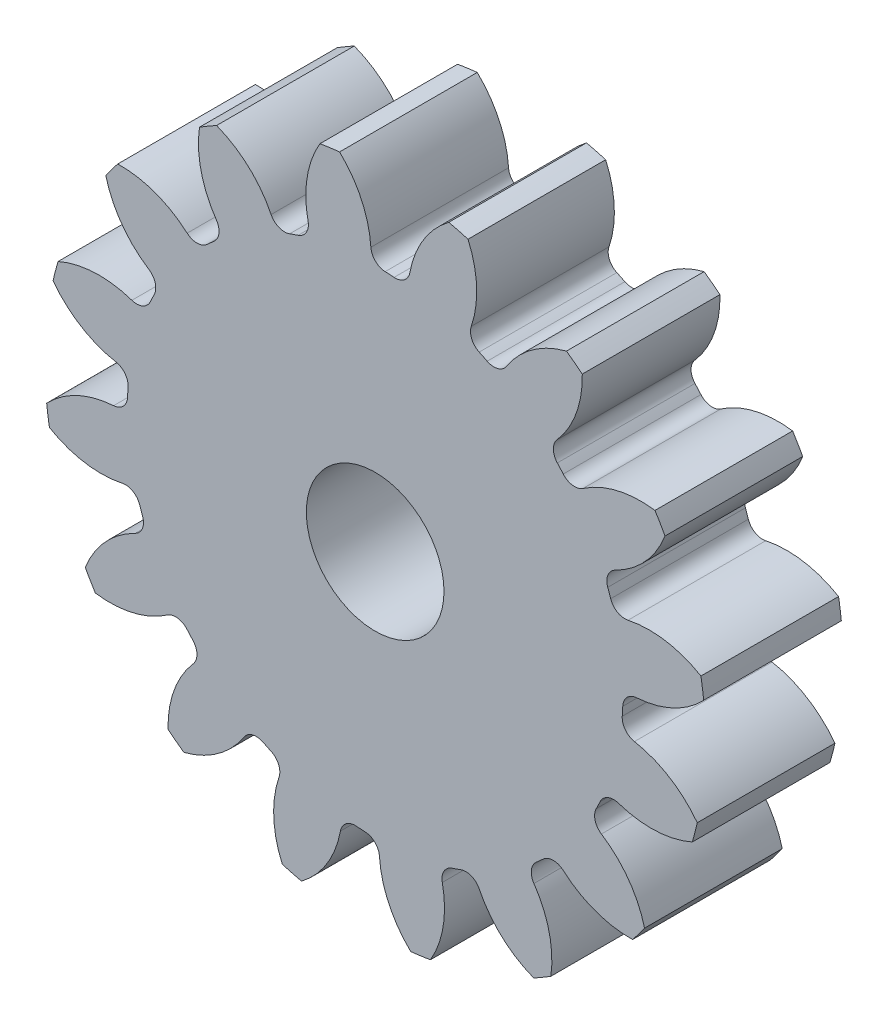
ISO-10303-21;
HEADER;
FILE_DESCRIPTION(('STEP AP214'),'2;1');
FILE_NAME('part.step','',(''),(''),'','','');
FILE_SCHEMA(('AUTOMOTIVE_DESIGN { 1 0 10303 214 1 1 1 1 }'));
ENDSEC;
DATA;
#1=APPLICATION_CONTEXT('core data for automotive mechanical design processes');
#2=APPLICATION_PROTOCOL_DEFINITION('international standard','automotive_design',2000,#1);
#3=PRODUCT_CONTEXT('',#1,'mechanical');
#4=PRODUCT('Part','Part','',(#3));
#5=PRODUCT_RELATED_PRODUCT_CATEGORY('part','',(#4));
#6=PRODUCT_DEFINITION_FORMATION('','',#4);
#7=PRODUCT_DEFINITION_CONTEXT('part definition',#1,'design');
#8=PRODUCT_DEFINITION('design','',#6,#7);
#9=PRODUCT_DEFINITION_SHAPE('','',#8);
#10=(LENGTH_UNIT() NAMED_UNIT(*) SI_UNIT(.MILLI.,.METRE.));
#11=(NAMED_UNIT(*) PLANE_ANGLE_UNIT() SI_UNIT($,.RADIAN.));
#12=(NAMED_UNIT(*) SI_UNIT($,.STERADIAN.) SOLID_ANGLE_UNIT());
#13=UNCERTAINTY_MEASURE_WITH_UNIT(LENGTH_MEASURE(1.E-05),#10,'distance_accuracy_value','');
#14=(GEOMETRIC_REPRESENTATION_CONTEXT(3) GLOBAL_UNCERTAINTY_ASSIGNED_CONTEXT((#13)) GLOBAL_UNIT_ASSIGNED_CONTEXT((#10,
#11,#12)) REPRESENTATION_CONTEXT('',''));
#15=CARTESIAN_POINT('',(0.,0.,0.));
#16=DIRECTION('',(0.,0.,1.));
#17=DIRECTION('',(1.,0.,0.));
#18=AXIS2_PLACEMENT_3D('',#15,#16,#17);
#19=CARTESIAN_POINT('',(0.,0.,127.));
#20=DIRECTION('',(0.,0.,-1.));
#21=DIRECTION('',(-1.,0.,0.));
#22=AXIS2_PLACEMENT_3D('',#19,#20,#21);
#23=CYLINDRICAL_SURFACE('',#22,304.8);
#24=DIRECTION('',(0.,0.,-1.));
#25=VECTOR('',#24,1.);
#26=CARTESIAN_POINT('',(300.508202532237,50.9692084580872,63.5));
#27=LINE('',#26,#25);
#28=CARTESIAN_POINT('',(300.508202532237,50.9692084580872,127.));
#29=VERTEX_POINT('',#28);
#30=CARTESIAN_POINT('',(300.508202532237,50.9692084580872,0.));
#31=VERTEX_POINT('',#30);
#32=EDGE_CURVE('E672',#29,#31,#27,.T.);
#33=ORIENTED_EDGE('',*,*,#32,.F.);
#34=CARTESIAN_POINT('',(0.,0.,127.));
#35=DIRECTION('',(0.,0.,1.));
#36=DIRECTION('',(1.,0.,0.));
#37=AXIS2_PLACEMENT_3D('',#34,#35,#36);
#38=CIRCLE('',#37,304.8);
#39=CARTESIAN_POINT('',(303.028797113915,32.8114022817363,127.));
#40=VERTEX_POINT('',#39);
#41=EDGE_CURVE('E1241',#40,#29,#38,.T.);
#42=ORIENTED_EDGE('',*,*,#41,.F.);
#43=DIRECTION('',(0.,0.,-1.));
#44=VECTOR('',#43,1.);
#45=CARTESIAN_POINT('',(303.028797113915,32.8114022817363,63.5));
#46=LINE('',#45,#44);
#47=CARTESIAN_POINT('',(303.028797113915,32.8114022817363,0.));
#48=VERTEX_POINT('',#47);
#49=EDGE_CURVE('E1235',#48,#40,#46,.F.);
#50=ORIENTED_EDGE('',*,*,#49,.F.);
#51=CARTESIAN_POINT('',(0.,0.,0.));
#52=DIRECTION('',(0.,0.,1.));
#53=DIRECTION('',(1.,0.,0.));
#54=AXIS2_PLACEMENT_3D('',#51,#52,#53);
#55=CIRCLE('',#54,304.8);
#56=EDGE_CURVE('E1246',#48,#31,#55,.T.);
#57=ORIENTED_EDGE('',*,*,#56,.T.);
#58=EDGE_LOOP('',(#33,#42,#50,#57));
#59=FACE_BOUND('',#58,.T.);
#60=ADVANCED_FACE('F33',(#59),#23,.T.);
#61=DIRECTION('',(0.,0.,-1.));
#62=VECTOR('',#61,1.);
#63=CARTESIAN_POINT('',(267.405723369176,146.277883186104,63.5));
#64=LINE('',#63,#62);
#65=CARTESIAN_POINT('',(267.405723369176,146.277883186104,0.));
#66=VERTEX_POINT('',#65);
#67=CARTESIAN_POINT('',(267.405723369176,146.277883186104,127.));
#68=VERTEX_POINT('',#67);
#69=EDGE_CURVE('E643',#66,#68,#64,.F.);
#70=ORIENTED_EDGE('',*,*,#69,.F.);
#71=CARTESIAN_POINT('',(258.128306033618,162.088918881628,0.));
#72=VERTEX_POINT('',#71);
#73=EDGE_CURVE('E1249',#66,#72,#55,.T.);
#74=ORIENTED_EDGE('',*,*,#73,.T.);
#75=DIRECTION('',(0.,0.,-1.));
#76=VECTOR('',#75,1.);
#77=CARTESIAN_POINT('',(258.128306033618,162.088918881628,63.5));
#78=LINE('',#77,#76);
#79=CARTESIAN_POINT('',(258.128306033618,162.088918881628,127.));
#80=VERTEX_POINT('',#79);
#81=EDGE_CURVE('E705',#80,#72,#78,.T.);
#82=ORIENTED_EDGE('',*,*,#81,.F.);
#83=EDGE_CURVE('E1244',#68,#80,#38,.T.);
#84=ORIENTED_EDGE('',*,*,#83,.F.);
#85=EDGE_LOOP('',(#70,#74,#82,#84));
#86=FACE_BOUND('',#85,.T.);
#87=ADVANCED_FACE('F1431',(#86),#23,.T.);
#88=CARTESIAN_POINT('',(0.,0.,127.));
#89=DIRECTION('',(0.,0.,1.));
#90=DIRECTION('',(1.,0.,0.));
#91=AXIS2_PLACEMENT_3D('',#88,#89,#90);
#92=PLANE('',#91);
#93=CARTESIAN_POINT('',(0.,0.,127.000000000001));
#94=DIRECTION('',(0.,0.,1.));
#95=DIRECTION('',(1.,0.,0.));
#96=AXIS2_PLACEMENT_3D('',#93,#94,#95);
#97=CIRCLE('',#96,63.5);
#98=CARTESIAN_POINT('',(63.5,0.,127.000000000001));
#99=VERTEX_POINT('',#98);
#100=EDGE_CURVE('E660',#99,#99,#97,.T.);
#101=ORIENTED_EDGE('',*,*,#100,.F.);
#102=EDGE_LOOP('',(#101));
#103=FACE_BOUND('',#102,.T.);
#104=ORIENTED_EDGE('',*,*,#41,.T.);
#105=CARTESIAN_POINT('',(252.858520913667,-29.676602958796,127.));
#106=DIRECTION('',(0.,0.,-1.));
#107=DIRECTION('',(0.923879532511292,0.382683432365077,0.));
#108=AXIS2_PLACEMENT_3D('',#105,#106,#107);
#109=CIRCLE('',#108,93.6709082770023);
#110=CARTESIAN_POINT('',(233.245184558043,61.9179170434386,127.));
#111=VERTEX_POINT('',#110);
#112=EDGE_CURVE('E652',#111,#29,#109,.T.);
#113=ORIENTED_EDGE('',*,*,#112,.F.);
#114=CARTESIAN_POINT('',(230.359069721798,75.3961085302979,127.));
#115=DIRECTION('',(0.,0.,1.));
#116=DIRECTION('',(-0.923879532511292,-0.382683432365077,0.));
#117=AXIS2_PLACEMENT_3D('',#114,#115,#116);
#118=CIRCLE('',#117,13.7837333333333);
#119=CARTESIAN_POINT('',(217.259147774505,71.1085276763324,127.));
#120=VERTEX_POINT('',#119);
#121=EDGE_CURVE('E650',#120,#111,#118,.T.);
#122=ORIENTED_EDGE('',*,*,#121,.F.);
#123=CARTESIAN_POINT('',(0.,0.,127.));
#124=DIRECTION('',(0.,0.,-1.));
#125=DIRECTION('',(0.923879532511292,0.382683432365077,0.));
#126=AXIS2_PLACEMENT_3D('',#123,#124,#125);
#127=CIRCLE('',#126,228.6);
#128=CARTESIAN_POINT('',(214.562976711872,78.8713447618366,127.));
#129=VERTEX_POINT('',#128);
#130=EDGE_CURVE('E635',#129,#120,#127,.T.);
#131=ORIENTED_EDGE('',*,*,#130,.F.);
#132=CARTESIAN_POINT('',(227.500329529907,83.6269947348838,127.));
#133=DIRECTION('',(0.,0.,1.));
#134=DIRECTION('',(-0.923879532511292,-0.382683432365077,0.));
#135=AXIS2_PLACEMENT_3D('',#132,#133,#134);
#136=CIRCLE('',#135,13.7837333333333);
#137=CARTESIAN_POINT('',(221.410459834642,95.9924624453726,127.));
#138=VERTEX_POINT('',#137);
#139=EDGE_CURVE('E627',#138,#129,#136,.T.);
#140=ORIENTED_EDGE('',*,*,#139,.F.);
#141=CARTESIAN_POINT('',(180.025182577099,180.025181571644,127.));
#142=DIRECTION('',(0.,0.,-1.));
#143=DIRECTION('',(-0.923879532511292,-0.382683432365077,0.));
#144=AXIS2_PLACEMENT_3D('',#141,#142,#143);
#145=CIRCLE('',#144,93.6709082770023);
#146=EDGE_CURVE('E657',#68,#138,#145,.T.);
#147=ORIENTED_EDGE('',*,*,#146,.F.);
#148=ORIENTED_EDGE('',*,*,#83,.T.);
#149=CARTESIAN_POINT('',(244.967556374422,69.3471606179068,127.));
#150=DIRECTION('',(0.,0.,-1.));
#151=DIRECTION('',(0.707106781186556,0.707106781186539,0.));
#152=AXIS2_PLACEMENT_3D('',#149,#150,#151);
#153=CIRCLE('',#152,93.6709082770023);
#154=CARTESIAN_POINT('',(191.795491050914,146.463764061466,127.));
#155=VERTEX_POINT('',#154);
#156=EDGE_CURVE('E681',#155,#80,#153,.T.);
#157=ORIENTED_EDGE('',*,*,#156,.F.);
#158=CARTESIAN_POINT('',(183.971188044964,157.811520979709,127.));
#159=DIRECTION('',(0.,0.,1.));
#160=DIRECTION('',(-0.707106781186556,-0.707106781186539,0.));
#161=AXIS2_PLACEMENT_3D('',#158,#159,#160);
#162=CIRCLE('',#161,13.7837333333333);
#163=CARTESIAN_POINT('',(173.509224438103,148.837189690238,127.));
#164=VERTEX_POINT('',#163);
#165=EDGE_CURVE('E679',#164,#155,#162,.T.);
#166=ORIENTED_EDGE('',*,*,#165,.F.);
#167=CARTESIAN_POINT('',(0.,0.,127.));
#168=DIRECTION('',(0.,0.,-1.));
#169=DIRECTION('',(0.707106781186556,0.707106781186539,0.));
#170=AXIS2_PLACEMENT_3D('',#167,#168,#169);
#171=CIRCLE('',#170,228.6);
#172=CARTESIAN_POINT('',(168.047585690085,154.977317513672,127.));
#173=VERTEX_POINT('',#172);
#174=EDGE_CURVE('E676',#173,#164,#171,.T.);
#175=ORIENTED_EDGE('',*,*,#174,.F.);
#176=CARTESIAN_POINT('',(178.180232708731,164.321875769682,127.));
#177=DIRECTION('',(0.,0.,1.));
#178=DIRECTION('',(-0.707106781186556,-0.707106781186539,0.));
#179=AXIS2_PLACEMENT_3D('',#176,#177,#178);
#180=CIRCLE('',#179,13.7837333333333);
#181=CARTESIAN_POINT('',(167.821867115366,173.415586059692,127.));
#182=VERTEX_POINT('',#181);
#183=EDGE_CURVE('E674',#182,#173,#180,.T.);
#184=ORIENTED_EDGE('',*,*,#183,.F.);
#185=CARTESIAN_POINT('',(97.4289271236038,235.214235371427,127.));
#186=DIRECTION('',(0.,0.,-1.));
#187=DIRECTION('',(-0.707106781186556,-0.707106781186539,0.));
#188=AXIS2_PLACEMENT_3D('',#185,#186,#187);
#189=CIRCLE('',#188,93.6709082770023);
#190=CARTESIAN_POINT('',(191.072552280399,237.474882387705,127.));
#191=VERTEX_POINT('',#190);
#192=EDGE_CURVE('E684',#191,#182,#189,.T.);
#193=ORIENTED_EDGE('',*,*,#192,.F.);
#194=CARTESIAN_POINT('',(176.4507148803,248.53206074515,127.));
#195=VERTEX_POINT('',#194);
#196=EDGE_CURVE('E1289',#191,#195,#38,.T.);
#197=ORIENTED_EDGE('',*,*,#196,.T.);
#198=CARTESIAN_POINT('',(199.782502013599,157.81344762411,127.));
#199=DIRECTION('',(0.,0.,-1.));
#200=DIRECTION('',(0.3826834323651,0.923879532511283,0.));
#201=AXIS2_PLACEMENT_3D('',#198,#199,#200);
#202=CIRCLE('',#201,93.6709082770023);
#203=CARTESIAN_POINT('',(121.146672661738,208.711830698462,127.));
#204=VERTEX_POINT('',#203);
#205=EDGE_CURVE('E716',#204,#195,#202,.T.);
#206=ORIENTED_EDGE('',*,*,#205,.F.);
#207=CARTESIAN_POINT('',(109.575360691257,216.201559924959,127.));
#208=DIRECTION('',(0.,0.,1.));
#209=DIRECTION('',(-0.3826834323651,-0.923879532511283,0.));
#210=AXIS2_PLACEMENT_3D('',#207,#208,#209);
#211=CIRCLE('',#210,13.7837333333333);
#212=CARTESIAN_POINT('',(103.344094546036,203.906738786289,127.));
#213=VERTEX_POINT('',#212);
#214=EDGE_CURVE('E714',#213,#204,#211,.T.);
#215=ORIENTED_EDGE('',*,*,#214,.F.);
#216=CARTESIAN_POINT('',(0.,0.,127.));
#217=DIRECTION('',(0.,0.,-1.));
#218=DIRECTION('',(0.3826834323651,0.923879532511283,0.));
#219=AXIS2_PLACEMENT_3D('',#216,#217,#218);
#220=CIRCLE('',#219,228.6);
#221=CARTESIAN_POINT('',(95.948473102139,207.489398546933,127.));
#222=VERTEX_POINT('',#221);
#223=EDGE_CURVE('E711',#222,#213,#220,.T.);
#224=ORIENTED_EDGE('',*,*,#223,.F.);
#225=CARTESIAN_POINT('',(101.733810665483,220.00024080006,127.));
#226=DIRECTION('',(0.,0.,1.));
#227=DIRECTION('',(-0.3826834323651,-0.923879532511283,0.));
#228=AXIS2_PLACEMENT_3D('',#225,#226,#227);
#229=CIRCLE('',#228,13.7837333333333);
#230=CARTESIAN_POINT('',(88.6839164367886,224.437758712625,127.));
#231=VERTEX_POINT('',#230);
#232=EDGE_CURVE('E709',#231,#222,#229,.T.);
#233=ORIENTED_EDGE('',*,*,#232,.F.);
#234=CARTESIAN_POINT('',(7.10963260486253E-07,254.594054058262,127.));
#235=DIRECTION('',(0.,0.,-1.));
#236=DIRECTION('',(-0.3826834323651,-0.923879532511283,0.));
#237=AXIS2_PLACEMENT_3D('',#234,#235,#236);
#238=CIRCLE('',#237,93.6709082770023);
#239=CARTESIAN_POINT('',(85.6503171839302,292.518483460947,127.));
#240=VERTEX_POINT('',#239);
#241=EDGE_CURVE('E719',#240,#231,#238,.T.);
#242=ORIENTED_EDGE('',*,*,#241,.F.);
#243=CARTESIAN_POINT('',(67.9101019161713,297.138449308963,127.));
#244=VERTEX_POINT('',#243);
#245=EDGE_CURVE('E1413',#240,#244,#38,.T.);
#246=ORIENTED_EDGE('',*,*,#245,.T.);
#247=CARTESIAN_POINT('',(124.182372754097,222.254067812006,127.));
#248=DIRECTION('',(0.,0.,-1.));
#249=DIRECTION('',(0.,1.,0.));
#250=AXIS2_PLACEMENT_3D('',#247,#248,#249);
#251=CIRCLE('',#250,93.6709082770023);
#252=CARTESIAN_POINT('',(32.0543715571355,239.185413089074,127.));
#253=VERTEX_POINT('',#252);
#254=EDGE_CURVE('E754',#253,#244,#251,.T.);
#255=ORIENTED_EDGE('',*,*,#254,.F.);
#256=CARTESIAN_POINT('',(18.4976779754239,241.676871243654,127.));
#257=DIRECTION('',(0.,0.,1.));
#258=DIRECTION('',(0.,-1.,0.));
#259=AXIS2_PLACEMENT_3D('',#256,#257,#258);
#260=CIRCLE('',#259,13.7837333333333);
#261=CARTESIAN_POINT('',(17.4457630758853,227.933335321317,127.));
#262=VERTEX_POINT('',#261);
#263=EDGE_CURVE('E752',#262,#253,#260,.T.);
#264=ORIENTED_EDGE('',*,*,#263,.F.);
#265=CARTESIAN_POINT('',(0.,0.,127.));
#266=DIRECTION('',(0.,0.,-1.));
#267=DIRECTION('',(0.,1.,0.));
#268=AXIS2_PLACEMENT_3D('',#265,#266,#267);
#269=CIRCLE('',#268,228.6);
#270=CARTESIAN_POINT('',(9.24207525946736,228.413099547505,127.));
#271=VERTEX_POINT('',#270);
#272=EDGE_CURVE('E749',#271,#262,#269,.T.);
#273=ORIENTED_EDGE('',*,*,#272,.F.);
#274=CARTESIAN_POINT('',(9.79933816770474,242.185563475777,127.));
#275=DIRECTION('',(0.,0.,1.));
#276=DIRECTION('',(0.,-1.,0.));
#277=AXIS2_PLACEMENT_3D('',#274,#275,#276);
#278=CIRCLE('',#277,13.7837333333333);
#279=CARTESIAN_POINT('',(-3.95535659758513,241.29131713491,127.));
#280=VERTEX_POINT('',#279);
#281=EDGE_CURVE('E747',#280,#271,#278,.T.);
#282=ORIENTED_EDGE('',*,*,#281,.F.);
#283=CARTESIAN_POINT('',(-97.4289258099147,235.214235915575,127.));
#284=DIRECTION('',(0.,0.,-1.));
#285=DIRECTION('',(0.,-1.,0.));
#286=AXIS2_PLACEMENT_3D('',#283,#284,#285);
#287=CIRCLE('',#286,93.6709082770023);
#288=CARTESIAN_POINT('',(-32.8114022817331,303.028797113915,127.));
#289=VERTEX_POINT('',#288);
#290=EDGE_CURVE('E757',#289,#280,#287,.T.);
#291=ORIENTED_EDGE('',*,*,#290,.F.);
#292=CARTESIAN_POINT('',(-50.9692084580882,300.508202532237,127.));
#293=VERTEX_POINT('',#292);
#294=EDGE_CURVE('E1409',#289,#293,#38,.T.);
#295=ORIENTED_EDGE('',*,*,#294,.T.);
#296=CARTESIAN_POINT('',(29.6766029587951,252.858520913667,127.));
#297=DIRECTION('',(0.,0.,-1.));
#298=DIRECTION('',(-0.382683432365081,0.923879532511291,0.));
#299=AXIS2_PLACEMENT_3D('',#296,#297,#298);
#300=CIRCLE('',#299,93.6709082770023);
#301=CARTESIAN_POINT('',(-61.9179170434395,233.245184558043,127.));
#302=VERTEX_POINT('',#301);
#303=EDGE_CURVE('E792',#302,#293,#300,.T.);
#304=ORIENTED_EDGE('',*,*,#303,.F.);
#305=CARTESIAN_POINT('',(-75.3961085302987,230.359069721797,127.));
#306=DIRECTION('',(0.,0.,1.));
#307=DIRECTION('',(0.382683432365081,-0.923879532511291,0.));
#308=AXIS2_PLACEMENT_3D('',#305,#306,#307);
#309=CIRCLE('',#308,13.7837333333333);
#310=CARTESIAN_POINT('',(-71.1085276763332,217.259147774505,127.));
#311=VERTEX_POINT('',#310);
#312=EDGE_CURVE('E790',#311,#302,#309,.T.);
#313=ORIENTED_EDGE('',*,*,#312,.F.);
#314=CARTESIAN_POINT('',(0.,0.,127.));
#315=DIRECTION('',(0.,0.,-1.));
#316=DIRECTION('',(-0.382683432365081,0.923879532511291,0.));
#317=AXIS2_PLACEMENT_3D('',#314,#315,#316);
#318=CIRCLE('',#317,228.6);
#319=CARTESIAN_POINT('',(-78.8713447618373,214.562976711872,127.));
#320=VERTEX_POINT('',#319);
#321=EDGE_CURVE('E787',#320,#311,#318,.T.);
#322=ORIENTED_EDGE('',*,*,#321,.F.);
#323=CARTESIAN_POINT('',(-83.6269947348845,227.500329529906,127.));
#324=DIRECTION('',(0.,0.,1.));
#325=DIRECTION('',(0.382683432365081,-0.923879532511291,0.));
#326=AXIS2_PLACEMENT_3D('',#323,#324,#325);
#327=CIRCLE('',#326,13.7837333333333);
#328=CARTESIAN_POINT('',(-95.9924624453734,221.410459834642,127.));
#329=VERTEX_POINT('',#328);
#330=EDGE_CURVE('E785',#329,#320,#327,.T.);
#331=ORIENTED_EDGE('',*,*,#330,.F.);
#332=CARTESIAN_POINT('',(-180.025181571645,180.025182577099,127.));
#333=DIRECTION('',(0.,0.,-1.));
#334=DIRECTION('',(0.382683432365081,-0.923879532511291,0.));
#335=AXIS2_PLACEMENT_3D('',#332,#333,#334);
#336=CIRCLE('',#335,93.6709082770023);
#337=CARTESIAN_POINT('',(-146.277883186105,267.405723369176,127.));
#338=VERTEX_POINT('',#337);
#339=EDGE_CURVE('E795',#338,#329,#336,.T.);
#340=ORIENTED_EDGE('',*,*,#339,.F.);
#341=CARTESIAN_POINT('',(-162.088918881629,258.128306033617,127.));
#342=VERTEX_POINT('',#341);
#343=EDGE_CURVE('E1405',#338,#342,#38,.T.);
#344=ORIENTED_EDGE('',*,*,#343,.T.);
#345=CARTESIAN_POINT('',(-69.3471606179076,244.967556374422,127.));
#346=DIRECTION('',(0.,0.,-1.));
#347=DIRECTION('',(-0.707106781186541,0.707106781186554,0.));
#348=AXIS2_PLACEMENT_3D('',#345,#346,#347);
#349=CIRCLE('',#348,93.6709082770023);
#350=CARTESIAN_POINT('',(-146.463764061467,191.795491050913,127.));
#351=VERTEX_POINT('',#350);
#352=EDGE_CURVE('E830',#351,#342,#349,.T.);
#353=ORIENTED_EDGE('',*,*,#352,.F.);
#354=CARTESIAN_POINT('',(-157.811520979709,183.971188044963,127.));
#355=DIRECTION('',(0.,0.,1.));
#356=DIRECTION('',(0.707106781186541,-0.707106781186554,0.));
#357=AXIS2_PLACEMENT_3D('',#354,#355,#356);
#358=CIRCLE('',#357,13.7837333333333);
#359=CARTESIAN_POINT('',(-148.837189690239,173.509224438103,127.));
#360=VERTEX_POINT('',#359);
#361=EDGE_CURVE('E828',#360,#351,#358,.T.);
#362=ORIENTED_EDGE('',*,*,#361,.F.);
#363=CARTESIAN_POINT('',(0.,0.,127.));
#364=DIRECTION('',(0.,0.,-1.));
#365=DIRECTION('',(-0.707106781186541,0.707106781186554,0.));
#366=AXIS2_PLACEMENT_3D('',#363,#364,#365);
#367=CIRCLE('',#366,228.6);
#368=CARTESIAN_POINT('',(-154.977317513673,168.047585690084,127.));
#369=VERTEX_POINT('',#368);
#370=EDGE_CURVE('E825',#369,#360,#367,.T.);
#371=ORIENTED_EDGE('',*,*,#370,.F.);
#372=CARTESIAN_POINT('',(-164.321875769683,178.180232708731,127.));
#373=DIRECTION('',(0.,0.,1.));
#374=DIRECTION('',(0.707106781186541,-0.707106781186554,0.));
#375=AXIS2_PLACEMENT_3D('',#372,#373,#374);
#376=CIRCLE('',#375,13.7837333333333);
#377=CARTESIAN_POINT('',(-173.415586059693,167.821867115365,127.));
#378=VERTEX_POINT('',#377);
#379=EDGE_CURVE('E823',#378,#369,#376,.T.);
#380=ORIENTED_EDGE('',*,*,#379,.F.);
#381=CARTESIAN_POINT('',(-235.214235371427,97.4289271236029,127.));
#382=DIRECTION('',(0.,0.,-1.));
#383=DIRECTION('',(0.707106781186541,-0.707106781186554,0.));
#384=AXIS2_PLACEMENT_3D('',#381,#382,#383);
#385=CIRCLE('',#384,93.6709082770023);
#386=CARTESIAN_POINT('',(-237.474882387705,191.072552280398,127.));
#387=VERTEX_POINT('',#386);
#388=EDGE_CURVE('E833',#387,#378,#385,.T.);
#389=ORIENTED_EDGE('',*,*,#388,.F.);
#390=CARTESIAN_POINT('',(-248.532060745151,176.4507148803,127.));
#391=VERTEX_POINT('',#390);
#392=EDGE_CURVE('E1401',#387,#391,#38,.T.);
#393=ORIENTED_EDGE('',*,*,#392,.T.);
#394=CARTESIAN_POINT('',(-157.81344762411,199.782502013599,127.));
#395=DIRECTION('',(0.,0.,-1.));
#396=DIRECTION('',(-0.923879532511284,0.382683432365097,0.));
#397=AXIS2_PLACEMENT_3D('',#394,#395,#396);
#398=CIRCLE('',#397,93.6709082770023);
#399=CARTESIAN_POINT('',(-208.711830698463,121.146672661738,127.));
#400=VERTEX_POINT('',#399);
#401=EDGE_CURVE('E868',#400,#391,#398,.T.);
#402=ORIENTED_EDGE('',*,*,#401,.F.);
#403=CARTESIAN_POINT('',(-216.201559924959,109.575360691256,127.));
#404=DIRECTION('',(0.,0.,1.));
#405=DIRECTION('',(0.923879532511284,-0.382683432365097,0.));
#406=AXIS2_PLACEMENT_3D('',#403,#404,#405);
#407=CIRCLE('',#406,13.7837333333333);
#408=CARTESIAN_POINT('',(-203.906738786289,103.344094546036,127.));
#409=VERTEX_POINT('',#408);
#410=EDGE_CURVE('E866',#409,#400,#407,.T.);
#411=ORIENTED_EDGE('',*,*,#410,.F.);
#412=CARTESIAN_POINT('',(0.,0.,127.));
#413=DIRECTION('',(0.,0.,-1.));
#414=DIRECTION('',(-0.923879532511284,0.382683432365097,0.));
#415=AXIS2_PLACEMENT_3D('',#412,#413,#414);
#416=CIRCLE('',#415,228.6);
#417=CARTESIAN_POINT('',(-207.489398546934,95.9484731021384,127.));
#418=VERTEX_POINT('',#417);
#419=EDGE_CURVE('E863',#418,#409,#416,.T.);
#420=ORIENTED_EDGE('',*,*,#419,.F.);
#421=CARTESIAN_POINT('',(-220.00024080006,101.733810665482,127.));
#422=DIRECTION('',(0.,0.,1.));
#423=DIRECTION('',(0.923879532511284,-0.382683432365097,0.));
#424=AXIS2_PLACEMENT_3D('',#421,#422,#423);
#425=CIRCLE('',#424,13.7837333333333);
#426=CARTESIAN_POINT('',(-224.437758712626,88.6839164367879,127.));
#427=VERTEX_POINT('',#426);
#428=EDGE_CURVE('E861',#427,#418,#425,.T.);
#429=ORIENTED_EDGE('',*,*,#428,.F.);
#430=CARTESIAN_POINT('',(-254.594054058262,7.10962497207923E-07,127.));
#431=DIRECTION('',(0.,0.,-1.));
#432=DIRECTION('',(0.923879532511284,-0.382683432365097,0.));
#433=AXIS2_PLACEMENT_3D('',#430,#431,#432);
#434=CIRCLE('',#433,93.6709082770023);
#435=CARTESIAN_POINT('',(-292.518483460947,85.6503171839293,127.));
#436=VERTEX_POINT('',#435);
#437=EDGE_CURVE('E871',#436,#427,#434,.T.);
#438=ORIENTED_EDGE('',*,*,#437,.F.);
#439=CARTESIAN_POINT('',(-297.138449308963,67.9101019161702,127.));
#440=VERTEX_POINT('',#439);
#441=EDGE_CURVE('E1397',#436,#440,#38,.T.);
#442=ORIENTED_EDGE('',*,*,#441,.T.);
#443=CARTESIAN_POINT('',(-222.254067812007,124.182372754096,127.));
#444=DIRECTION('',(0.,0.,-1.));
#445=DIRECTION('',(-1.,0.,0.));
#446=AXIS2_PLACEMENT_3D('',#443,#444,#445);
#447=CIRCLE('',#446,93.6709082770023);
#448=CARTESIAN_POINT('',(-239.185413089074,32.0543715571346,127.));
#449=VERTEX_POINT('',#448);
#450=EDGE_CURVE('E906',#449,#440,#447,.T.);
#451=ORIENTED_EDGE('',*,*,#450,.F.);
#452=CARTESIAN_POINT('',(-241.676871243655,18.497677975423,127.));
#453=DIRECTION('',(0.,0.,1.));
#454=DIRECTION('',(1.,0.,0.));
#455=AXIS2_PLACEMENT_3D('',#452,#453,#454);
#456=CIRCLE('',#455,13.7837333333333);
#457=CARTESIAN_POINT('',(-227.933335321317,17.4457630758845,127.));
#458=VERTEX_POINT('',#457);
#459=EDGE_CURVE('E904',#458,#449,#456,.T.);
#460=ORIENTED_EDGE('',*,*,#459,.F.);
#461=CARTESIAN_POINT('',(0.,0.,127.));
#462=DIRECTION('',(0.,0.,-1.));
#463=DIRECTION('',(-1.,0.,0.));
#464=AXIS2_PLACEMENT_3D('',#461,#462,#463);
#465=CIRCLE('',#464,228.6);
#466=CARTESIAN_POINT('',(-228.413099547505,9.24207525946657,127.));
#467=VERTEX_POINT('',#466);
#468=EDGE_CURVE('E901',#467,#458,#465,.T.);
#469=ORIENTED_EDGE('',*,*,#468,.F.);
#470=CARTESIAN_POINT('',(-242.185563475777,9.79933816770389,127.));
#471=DIRECTION('',(0.,0.,1.));
#472=DIRECTION('',(1.,0.,0.));
#473=AXIS2_PLACEMENT_3D('',#470,#471,#472);
#474=CIRCLE('',#473,13.7837333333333);
#475=CARTESIAN_POINT('',(-241.29131713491,-3.95535659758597,127.));
#476=VERTEX_POINT('',#475);
#477=EDGE_CURVE('E899',#476,#467,#474,.T.);
#478=ORIENTED_EDGE('',*,*,#477,.F.);
#479=CARTESIAN_POINT('',(-235.214235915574,-97.4289258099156,127.));
#480=DIRECTION('',(0.,0.,-1.));
#481=DIRECTION('',(1.,0.,0.));
#482=AXIS2_PLACEMENT_3D('',#479,#480,#481);
#483=CIRCLE('',#482,93.6709082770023);
#484=CARTESIAN_POINT('',(-303.028797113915,-32.8114022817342,127.));
#485=VERTEX_POINT('',#484);
#486=EDGE_CURVE('E909',#485,#476,#483,.T.);
#487=ORIENTED_EDGE('',*,*,#486,.F.);
#488=CARTESIAN_POINT('',(-300.508202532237,-50.9692084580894,127.));
#489=VERTEX_POINT('',#488);
#490=EDGE_CURVE('E1393',#485,#489,#38,.T.);
#491=ORIENTED_EDGE('',*,*,#490,.T.);
#492=CARTESIAN_POINT('',(-252.858520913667,29.6766029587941,127.));
#493=DIRECTION('',(0.,0.,-1.));
#494=DIRECTION('',(-0.923879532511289,-0.382683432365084,0.));
#495=AXIS2_PLACEMENT_3D('',#492,#493,#494);
#496=CIRCLE('',#495,93.6709082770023);
#497=CARTESIAN_POINT('',(-233.245184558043,-61.9179170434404,127.));
#498=VERTEX_POINT('',#497);
#499=EDGE_CURVE('E944',#498,#489,#496,.T.);
#500=ORIENTED_EDGE('',*,*,#499,.F.);
#501=CARTESIAN_POINT('',(-230.359069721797,-75.3961085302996,127.));
#502=DIRECTION('',(0.,0.,1.));
#503=DIRECTION('',(0.923879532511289,0.382683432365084,0.));
#504=AXIS2_PLACEMENT_3D('',#501,#502,#503);
#505=CIRCLE('',#504,13.7837333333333);
#506=CARTESIAN_POINT('',(-217.259147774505,-71.108527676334,127.));
#507=VERTEX_POINT('',#506);
#508=EDGE_CURVE('E942',#507,#498,#505,.T.);
#509=ORIENTED_EDGE('',*,*,#508,.F.);
#510=CARTESIAN_POINT('',(0.,0.,127.));
#511=DIRECTION('',(0.,0.,-1.));
#512=DIRECTION('',(-0.923879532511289,-0.382683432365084,0.));
#513=AXIS2_PLACEMENT_3D('',#510,#511,#512);
#514=CIRCLE('',#513,228.6);
#515=CARTESIAN_POINT('',(-214.562976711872,-78.8713447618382,127.));
#516=VERTEX_POINT('',#515);
#517=EDGE_CURVE('E939',#516,#507,#514,.T.);
#518=ORIENTED_EDGE('',*,*,#517,.F.);
#519=CARTESIAN_POINT('',(-227.500329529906,-83.6269947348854,127.));
#520=DIRECTION('',(0.,0.,1.));
#521=DIRECTION('',(0.923879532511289,0.382683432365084,0.));
#522=AXIS2_PLACEMENT_3D('',#519,#520,#521);
#523=CIRCLE('',#522,13.7837333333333);
#524=CARTESIAN_POINT('',(-221.410459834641,-95.9924624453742,127.));
#525=VERTEX_POINT('',#524);
#526=EDGE_CURVE('E937',#525,#516,#523,.T.);
#527=ORIENTED_EDGE('',*,*,#526,.F.);
#528=CARTESIAN_POINT('',(-180.025182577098,-180.025181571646,127.));
#529=DIRECTION('',(0.,0.,-1.));
#530=DIRECTION('',(0.923879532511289,0.382683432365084,0.));
#531=AXIS2_PLACEMENT_3D('',#528,#529,#530);
#532=CIRCLE('',#531,93.6709082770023);
#533=CARTESIAN_POINT('',(-267.405723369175,-146.277883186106,127.));
#534=VERTEX_POINT('',#533);
#535=EDGE_CURVE('E947',#534,#525,#532,.T.);
#536=ORIENTED_EDGE('',*,*,#535,.F.);
#537=CARTESIAN_POINT('',(-258.128306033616,-162.08891888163,127.));
#538=VERTEX_POINT('',#537);
#539=EDGE_CURVE('E1389',#534,#538,#38,.T.);
#540=ORIENTED_EDGE('',*,*,#539,.T.);
#541=CARTESIAN_POINT('',(-244.967556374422,-69.3471606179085,127.));
#542=DIRECTION('',(0.,0.,-1.));
#543=DIRECTION('',(-0.707106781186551,-0.707106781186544,0.));
#544=AXIS2_PLACEMENT_3D('',#541,#542,#543);
#545=CIRCLE('',#544,93.6709082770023);
#546=CARTESIAN_POINT('',(-191.795491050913,-146.463764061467,127.));
#547=VERTEX_POINT('',#546);
#548=EDGE_CURVE('E982',#547,#538,#545,.T.);
#549=ORIENTED_EDGE('',*,*,#548,.F.);
#550=CARTESIAN_POINT('',(-183.971188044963,-157.81152097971,127.));
#551=DIRECTION('',(0.,0.,1.));
#552=DIRECTION('',(0.707106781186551,0.707106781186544,0.));
#553=AXIS2_PLACEMENT_3D('',#550,#551,#552);
#554=CIRCLE('',#553,13.7837333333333);
#555=CARTESIAN_POINT('',(-173.509224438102,-148.837189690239,127.));
#556=VERTEX_POINT('',#555);
#557=EDGE_CURVE('E980',#556,#547,#554,.T.);
#558=ORIENTED_EDGE('',*,*,#557,.F.);
#559=CARTESIAN_POINT('',(0.,0.,127.));
#560=DIRECTION('',(0.,0.,-1.));
#561=DIRECTION('',(-0.707106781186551,-0.707106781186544,0.));
#562=AXIS2_PLACEMENT_3D('',#559,#560,#561);
#563=CIRCLE('',#562,228.6);
#564=CARTESIAN_POINT('',(-168.047585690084,-154.977317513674,127.));
#565=VERTEX_POINT('',#564);
#566=EDGE_CURVE('E977',#565,#556,#563,.T.);
#567=ORIENTED_EDGE('',*,*,#566,.F.);
#568=CARTESIAN_POINT('',(-178.18023270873,-164.321875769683,127.));
#569=DIRECTION('',(0.,0.,1.));
#570=DIRECTION('',(0.707106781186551,0.707106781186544,0.));
#571=AXIS2_PLACEMENT_3D('',#568,#569,#570);
#572=CIRCLE('',#571,13.7837333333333);
#573=CARTESIAN_POINT('',(-167.821867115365,-173.415586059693,127.));
#574=VERTEX_POINT('',#573);
#575=EDGE_CURVE('E975',#574,#565,#572,.T.);
#576=ORIENTED_EDGE('',*,*,#575,.F.);
#577=CARTESIAN_POINT('',(-97.4289271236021,-235.214235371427,127.));
#578=DIRECTION('',(0.,0.,-1.));
#579=DIRECTION('',(0.707106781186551,0.707106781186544,0.));
#580=AXIS2_PLACEMENT_3D('',#577,#578,#579);
#581=CIRCLE('',#580,93.6709082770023);
#582=CARTESIAN_POINT('',(-191.072552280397,-237.474882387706,127.));
#583=VERTEX_POINT('',#582);
#584=EDGE_CURVE('E985',#583,#574,#581,.T.);
#585=ORIENTED_EDGE('',*,*,#584,.F.);
#586=CARTESIAN_POINT('',(-176.450714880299,-248.532060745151,127.));
#587=VERTEX_POINT('',#586);
#588=EDGE_CURVE('E1385',#583,#587,#38,.T.);
#589=ORIENTED_EDGE('',*,*,#588,.T.);
#590=CARTESIAN_POINT('',(-199.782502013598,-157.813447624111,127.));
#591=DIRECTION('',(0.,0.,-1.));
#592=DIRECTION('',(-0.382683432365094,-0.923879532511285,0.));
#593=AXIS2_PLACEMENT_3D('',#590,#591,#592);
#594=CIRCLE('',#593,93.6709082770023);
#595=CARTESIAN_POINT('',(-121.146672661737,-208.711830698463,127.));
#596=VERTEX_POINT('',#595);
#597=EDGE_CURVE('E1020',#596,#587,#594,.T.);
#598=ORIENTED_EDGE('',*,*,#597,.F.);
#599=CARTESIAN_POINT('',(-109.575360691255,-216.201559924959,127.));
#600=DIRECTION('',(0.,0.,1.));
#601=DIRECTION('',(0.382683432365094,0.923879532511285,0.));
#602=AXIS2_PLACEMENT_3D('',#599,#600,#601);
#603=CIRCLE('',#602,13.7837333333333);
#604=CARTESIAN_POINT('',(-103.344094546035,-203.90673878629,127.));
#605=VERTEX_POINT('',#604);
#606=EDGE_CURVE('E1018',#605,#596,#603,.T.);
#607=ORIENTED_EDGE('',*,*,#606,.F.);
#608=CARTESIAN_POINT('',(0.,0.,127.));
#609=DIRECTION('',(0.,0.,-1.));
#610=DIRECTION('',(-0.382683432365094,-0.923879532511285,0.));
#611=AXIS2_PLACEMENT_3D('',#608,#609,#610);
#612=CIRCLE('',#611,228.6);
#613=CARTESIAN_POINT('',(-95.9484731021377,-207.489398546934,127.));
#614=VERTEX_POINT('',#613);
#615=EDGE_CURVE('E1015',#614,#605,#612,.T.);
#616=ORIENTED_EDGE('',*,*,#615,.F.);
#617=CARTESIAN_POINT('',(-101.733810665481,-220.00024080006,127.));
#618=DIRECTION('',(0.,0.,1.));
#619=DIRECTION('',(0.382683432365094,0.923879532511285,0.));
#620=AXIS2_PLACEMENT_3D('',#617,#618,#619);
#621=CIRCLE('',#620,13.7837333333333);
#622=CARTESIAN_POINT('',(-88.6839164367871,-224.437758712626,127.));
#623=VERTEX_POINT('',#622);
#624=EDGE_CURVE('E1013',#623,#614,#621,.T.);
#625=ORIENTED_EDGE('',*,*,#624,.F.);
#626=CARTESIAN_POINT('',(-7.10961595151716E-07,-254.594054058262,127.));
#627=DIRECTION('',(0.,0.,-1.));
#628=DIRECTION('',(0.382683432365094,0.923879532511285,0.));
#629=AXIS2_PLACEMENT_3D('',#626,#627,#628);
#630=CIRCLE('',#629,93.6709082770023);
#631=CARTESIAN_POINT('',(-85.6503171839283,-292.518483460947,127.));
#632=VERTEX_POINT('',#631);
#633=EDGE_CURVE('E1023',#632,#623,#630,.T.);
#634=ORIENTED_EDGE('',*,*,#633,.F.);
#635=CARTESIAN_POINT('',(-67.9101019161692,-297.138449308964,127.));
#636=VERTEX_POINT('',#635);
#637=EDGE_CURVE('E1381',#632,#636,#38,.T.);
#638=ORIENTED_EDGE('',*,*,#637,.T.);
#639=CARTESIAN_POINT('',(-124.182372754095,-222.254067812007,127.));
#640=DIRECTION('',(0.,0.,-1.));
#641=DIRECTION('',(0.,-1.,0.));
#642=AXIS2_PLACEMENT_3D('',#639,#640,#641);
#643=CIRCLE('',#642,93.6709082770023);
#644=CARTESIAN_POINT('',(-32.0543715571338,-239.185413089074,127.));
#645=VERTEX_POINT('',#644);
#646=EDGE_CURVE('E1058',#645,#636,#643,.T.);
#647=ORIENTED_EDGE('',*,*,#646,.F.);
#648=CARTESIAN_POINT('',(-18.4976779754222,-241.676871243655,127.));
#649=DIRECTION('',(0.,0.,1.));
#650=DIRECTION('',(0.,1.,0.));
#651=AXIS2_PLACEMENT_3D('',#648,#649,#650);
#652=CIRCLE('',#651,13.7837333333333);
#653=CARTESIAN_POINT('',(-17.4457630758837,-227.933335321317,127.));
#654=VERTEX_POINT('',#653);
#655=EDGE_CURVE('E1056',#654,#645,#652,.T.);
#656=ORIENTED_EDGE('',*,*,#655,.F.);
#657=CARTESIAN_POINT('',(0.,0.,127.));
#658=DIRECTION('',(0.,0.,-1.));
#659=DIRECTION('',(0.,-1.,0.));
#660=AXIS2_PLACEMENT_3D('',#657,#658,#659);
#661=CIRCLE('',#660,228.6);
#662=CARTESIAN_POINT('',(-9.24207525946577,-228.413099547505,127.));
#663=VERTEX_POINT('',#662);
#664=EDGE_CURVE('E1053',#663,#654,#661,.T.);
#665=ORIENTED_EDGE('',*,*,#664,.F.);
#666=CARTESIAN_POINT('',(-9.79933816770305,-242.185563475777,127.));
#667=DIRECTION('',(0.,0.,1.));
#668=DIRECTION('',(0.,1.,0.));
#669=AXIS2_PLACEMENT_3D('',#666,#667,#668);
#670=CIRCLE('',#669,13.7837333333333);
#671=CARTESIAN_POINT('',(3.95535659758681,-241.29131713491,127.));
#672=VERTEX_POINT('',#671);
#673=EDGE_CURVE('E1051',#672,#663,#670,.T.);
#674=ORIENTED_EDGE('',*,*,#673,.F.);
#675=CARTESIAN_POINT('',(97.4289258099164,-235.214235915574,127.));
#676=DIRECTION('',(0.,0.,-1.));
#677=DIRECTION('',(0.,1.,0.));
#678=AXIS2_PLACEMENT_3D('',#675,#676,#677);
#679=CIRCLE('',#678,93.6709082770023);
#680=CARTESIAN_POINT('',(32.8114022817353,-303.028797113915,127.));
#681=VERTEX_POINT('',#680);
#682=EDGE_CURVE('E1061',#681,#672,#679,.T.);
#683=ORIENTED_EDGE('',*,*,#682,.F.);
#684=CARTESIAN_POINT('',(50.9692084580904,-300.508202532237,127.));
#685=VERTEX_POINT('',#684);
#686=EDGE_CURVE('E1377',#681,#685,#38,.T.);
#687=ORIENTED_EDGE('',*,*,#686,.T.);
#688=CARTESIAN_POINT('',(-29.6766029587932,-252.858520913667,127.));
#689=DIRECTION('',(0.,0.,-1.));
#690=DIRECTION('',(0.382683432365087,-0.923879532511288,0.));
#691=AXIS2_PLACEMENT_3D('',#688,#689,#690);
#692=CIRCLE('',#691,93.6709082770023);
#693=CARTESIAN_POINT('',(61.9179170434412,-233.245184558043,127.));
#694=VERTEX_POINT('',#693);
#695=EDGE_CURVE('E1096',#694,#685,#692,.T.);
#696=ORIENTED_EDGE('',*,*,#695,.F.);
#697=CARTESIAN_POINT('',(75.3961085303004,-230.359069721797,127.));
#698=DIRECTION('',(0.,0.,1.));
#699=DIRECTION('',(-0.382683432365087,0.923879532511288,0.));
#700=AXIS2_PLACEMENT_3D('',#697,#698,#699);
#701=CIRCLE('',#700,13.7837333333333);
#702=CARTESIAN_POINT('',(71.1085276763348,-217.259147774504,127.));
#703=VERTEX_POINT('',#702);
#704=EDGE_CURVE('E1094',#703,#694,#701,.T.);
#705=ORIENTED_EDGE('',*,*,#704,.F.);
#706=CARTESIAN_POINT('',(0.,0.,127.));
#707=DIRECTION('',(0.,0.,-1.));
#708=DIRECTION('',(0.382683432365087,-0.923879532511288,0.));
#709=AXIS2_PLACEMENT_3D('',#706,#707,#708);
#710=CIRCLE('',#709,228.6);
#711=CARTESIAN_POINT('',(78.8713447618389,-214.562976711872,127.));
#712=VERTEX_POINT('',#711);
#713=EDGE_CURVE('E1091',#712,#703,#710,.T.);
#714=ORIENTED_EDGE('',*,*,#713,.F.);
#715=CARTESIAN_POINT('',(83.6269947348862,-227.500329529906,127.));
#716=DIRECTION('',(0.,0.,1.));
#717=DIRECTION('',(-0.382683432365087,0.923879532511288,0.));
#718=AXIS2_PLACEMENT_3D('',#715,#716,#717);
#719=CIRCLE('',#718,13.7837333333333);
#720=CARTESIAN_POINT('',(95.992462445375,-221.410459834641,127.));
#721=VERTEX_POINT('',#720);
#722=EDGE_CURVE('E1089',#721,#712,#719,.T.);
#723=ORIENTED_EDGE('',*,*,#722,.F.);
#724=CARTESIAN_POINT('',(180.025181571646,-180.025182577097,127.));
#725=DIRECTION('',(0.,0.,-1.));
#726=DIRECTION('',(-0.382683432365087,0.923879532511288,0.));
#727=AXIS2_PLACEMENT_3D('',#724,#725,#726);
#728=CIRCLE('',#727,93.6709082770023);
#729=CARTESIAN_POINT('',(146.277883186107,-267.405723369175,127.));
#730=VERTEX_POINT('',#729);
#731=EDGE_CURVE('E1099',#730,#721,#728,.T.);
#732=ORIENTED_EDGE('',*,*,#731,.F.);
#733=CARTESIAN_POINT('',(162.088918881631,-258.128306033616,127.));
#734=VERTEX_POINT('',#733);
#735=EDGE_CURVE('E1373',#730,#734,#38,.T.);
#736=ORIENTED_EDGE('',*,*,#735,.T.);
#737=CARTESIAN_POINT('',(69.3471606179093,-244.967556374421,127.));
#738=DIRECTION('',(0.,0.,-1.));
#739=DIRECTION('',(0.707106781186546,-0.707106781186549,0.));
#740=AXIS2_PLACEMENT_3D('',#737,#738,#739);
#741=CIRCLE('',#740,93.6709082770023);
#742=CARTESIAN_POINT('',(146.463764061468,-191.795491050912,127.));
#743=VERTEX_POINT('',#742);
#744=EDGE_CURVE('E1134',#743,#734,#741,.T.);
#745=ORIENTED_EDGE('',*,*,#744,.F.);
#746=CARTESIAN_POINT('',(157.811520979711,-183.971188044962,127.));
#747=DIRECTION('',(0.,0.,1.));
#748=DIRECTION('',(-0.707106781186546,0.707106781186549,0.));
#749=AXIS2_PLACEMENT_3D('',#746,#747,#748);
#750=CIRCLE('',#749,13.7837333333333);
#751=CARTESIAN_POINT('',(148.83718969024,-173.509224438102,127.));
#752=VERTEX_POINT('',#751);
#753=EDGE_CURVE('E1132',#752,#743,#750,.T.);
#754=ORIENTED_EDGE('',*,*,#753,.F.);
#755=CARTESIAN_POINT('',(0.,0.,127.));
#756=DIRECTION('',(0.,0.,-1.));
#757=DIRECTION('',(0.707106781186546,-0.707106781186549,0.));
#758=AXIS2_PLACEMENT_3D('',#755,#756,#757);
#759=CIRCLE('',#758,228.6);
#760=CARTESIAN_POINT('',(154.977317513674,-168.047585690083,127.));
#761=VERTEX_POINT('',#760);
#762=EDGE_CURVE('E1129',#761,#752,#759,.T.);
#763=ORIENTED_EDGE('',*,*,#762,.F.);
#764=CARTESIAN_POINT('',(164.321875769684,-178.180232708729,127.));
#765=DIRECTION('',(0.,0.,1.));
#766=DIRECTION('',(-0.707106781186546,0.707106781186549,0.));
#767=AXIS2_PLACEMENT_3D('',#764,#765,#766);
#768=CIRCLE('',#767,13.7837333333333);
#769=CARTESIAN_POINT('',(173.415586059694,-167.821867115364,127.));
#770=VERTEX_POINT('',#769);
#771=EDGE_CURVE('E1127',#770,#761,#768,.T.);
#772=ORIENTED_EDGE('',*,*,#771,.F.);
#773=CARTESIAN_POINT('',(235.214235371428,-97.4289271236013,127.));
#774=DIRECTION('',(0.,0.,-1.));
#775=DIRECTION('',(-0.707106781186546,0.707106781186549,0.));
#776=AXIS2_PLACEMENT_3D('',#773,#774,#775);
#777=CIRCLE('',#776,93.6709082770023);
#778=CARTESIAN_POINT('',(237.474882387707,-191.072552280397,127.));
#779=VERTEX_POINT('',#778);
#780=EDGE_CURVE('E1137',#779,#770,#777,.T.);
#781=ORIENTED_EDGE('',*,*,#780,.F.);
#782=CARTESIAN_POINT('',(248.532060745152,-176.450714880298,127.));
#783=VERTEX_POINT('',#782);
#784=EDGE_CURVE('E1372',#779,#783,#38,.T.);
#785=ORIENTED_EDGE('',*,*,#784,.T.);
#786=CARTESIAN_POINT('',(157.813447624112,-199.782502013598,127.));
#787=DIRECTION('',(0.,0.,-1.));
#788=DIRECTION('',(0.923879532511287,-0.382683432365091,0.));
#789=AXIS2_PLACEMENT_3D('',#786,#787,#788);
#790=CIRCLE('',#789,93.6709082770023);
#791=CARTESIAN_POINT('',(208.711830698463,-121.146672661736,127.));
#792=VERTEX_POINT('',#791);
#793=EDGE_CURVE('E1172',#792,#783,#790,.T.);
#794=ORIENTED_EDGE('',*,*,#793,.F.);
#795=CARTESIAN_POINT('',(216.20155992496,-109.575360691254,127.));
#796=DIRECTION('',(0.,0.,1.));
#797=DIRECTION('',(-0.923879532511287,0.382683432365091,0.));
#798=AXIS2_PLACEMENT_3D('',#795,#796,#797);
#799=CIRCLE('',#798,13.7837333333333);
#800=CARTESIAN_POINT('',(203.90673878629,-103.344094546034,127.));
#801=VERTEX_POINT('',#800);
#802=EDGE_CURVE('E1170',#801,#792,#799,.T.);
#803=ORIENTED_EDGE('',*,*,#802,.F.);
#804=CARTESIAN_POINT('',(0.,0.,127.));
#805=DIRECTION('',(0.,0.,-1.));
#806=DIRECTION('',(0.923879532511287,-0.382683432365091,0.));
#807=AXIS2_PLACEMENT_3D('',#804,#805,#806);
#808=CIRCLE('',#807,228.6);
#809=CARTESIAN_POINT('',(207.489398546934,-95.9484731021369,127.));
#810=VERTEX_POINT('',#809);
#811=EDGE_CURVE('E1167',#810,#801,#808,.T.);
#812=ORIENTED_EDGE('',*,*,#811,.F.);
#813=CARTESIAN_POINT('',(220.000240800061,-101.73381066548,127.));
#814=DIRECTION('',(0.,0.,1.));
#815=DIRECTION('',(-0.923879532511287,0.382683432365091,0.));
#816=AXIS2_PLACEMENT_3D('',#813,#814,#815);
#817=CIRCLE('',#816,13.7837333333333);
#818=CARTESIAN_POINT('',(224.437758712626,-88.6839164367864,127.));
#819=VERTEX_POINT('',#818);
#820=EDGE_CURVE('E1165',#819,#810,#817,.T.);
#821=ORIENTED_EDGE('',*,*,#820,.F.);
#822=CARTESIAN_POINT('',(254.594054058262,-7.10960706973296E-07,127.));
#823=DIRECTION('',(0.,0.,-1.));
#824=DIRECTION('',(-0.923879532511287,0.382683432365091,0.));
#825=AXIS2_PLACEMENT_3D('',#822,#823,#824);
#826=CIRCLE('',#825,93.6709082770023);
#827=CARTESIAN_POINT('',(292.518483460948,-85.6503171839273,127.));
#828=VERTEX_POINT('',#827);
#829=EDGE_CURVE('E1175',#828,#819,#826,.T.);
#830=ORIENTED_EDGE('',*,*,#829,.F.);
#831=CARTESIAN_POINT('',(297.138449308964,-67.9101019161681,127.));
#832=VERTEX_POINT('',#831);
#833=EDGE_CURVE('E1245',#828,#832,#38,.T.);
#834=ORIENTED_EDGE('',*,*,#833,.T.);
#835=CARTESIAN_POINT('',(222.254067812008,-124.182372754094,127.));
#836=DIRECTION('',(0.,0.,-1.));
#837=DIRECTION('',(1.,0.,0.));
#838=AXIS2_PLACEMENT_3D('',#835,#836,#837);
#839=CIRCLE('',#838,93.6709082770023);
#840=CARTESIAN_POINT('',(239.185413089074,-32.0543715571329,127.));
#841=VERTEX_POINT('',#840);
#842=EDGE_CURVE('E1210',#841,#832,#839,.T.);
#843=ORIENTED_EDGE('',*,*,#842,.F.);
#844=CARTESIAN_POINT('',(241.676871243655,-18.4976779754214,127.));
#845=DIRECTION('',(0.,0.,1.));
#846=DIRECTION('',(-1.,0.,0.));
#847=AXIS2_PLACEMENT_3D('',#844,#845,#846);
#848=CIRCLE('',#847,13.7837333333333);
#849=CARTESIAN_POINT('',(227.933335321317,-17.4457630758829,127.));
#850=VERTEX_POINT('',#849);
#851=EDGE_CURVE('E1208',#850,#841,#848,.T.);
#852=ORIENTED_EDGE('',*,*,#851,.F.);
#853=CARTESIAN_POINT('',(0.,0.,127.));
#854=DIRECTION('',(0.,0.,-1.));
#855=DIRECTION('',(1.,0.,0.));
#856=AXIS2_PLACEMENT_3D('',#853,#854,#855);
#857=CIRCLE('',#856,228.6);
#858=CARTESIAN_POINT('',(228.413099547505,-9.24207525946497,127.));
#859=VERTEX_POINT('',#858);
#860=EDGE_CURVE('E1205',#859,#850,#857,.T.);
#861=ORIENTED_EDGE('',*,*,#860,.F.);
#862=CARTESIAN_POINT('',(242.185563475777,-9.7993381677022,127.));
#863=DIRECTION('',(0.,0.,1.));
#864=DIRECTION('',(-1.,0.,0.));
#865=AXIS2_PLACEMENT_3D('',#862,#863,#864);
#866=CIRCLE('',#865,13.7837333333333);
#867=CARTESIAN_POINT('',(241.29131713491,3.95535659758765,127.));
#868=VERTEX_POINT('',#867);
#869=EDGE_CURVE('E1203',#868,#859,#866,.T.);
#870=ORIENTED_EDGE('',*,*,#869,.F.);
#871=CARTESIAN_POINT('',(235.214235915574,97.4289258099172,127.));
#872=DIRECTION('',(0.,0.,-1.));
#873=DIRECTION('',(-1.,0.,0.));
#874=AXIS2_PLACEMENT_3D('',#871,#872,#873);
#875=CIRCLE('',#874,93.6709082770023);
#876=EDGE_CURVE('E1213',#40,#868,#875,.T.);
#877=ORIENTED_EDGE('',*,*,#876,.F.);
#878=EDGE_LOOP('',(#104,#113,#122,#131,#140,#147,#148,#157,#166,#175,#184,#193,#197,#206,#215,
#224,#233,#242,#246,#255,#264,#273,#282,#291,#295,#304,#313,#322,#331,#340,#344,#353,#362,#371,
#380,#389,#393,#402,#411,#420,#429,#438,#442,#451,#460,#469,#478,#487,#491,#500,#509,#518,#527,
#536,#540,#549,#558,#567,#576,#585,#589,#598,#607,#616,#625,#634,#638,#647,#656,#665,#674,#683,
#687,#696,#705,#714,#723,#732,#736,#745,#754,#763,#772,#781,#785,#794,#803,#812,#821,#830,#834,
#843,#852,#861,#870,#877));
#879=FACE_BOUND('',#878,.T.);
#880=ADVANCED_FACE('F648',(#103,#879),#92,.T.);
#881=CARTESIAN_POINT('',(0.,0.,0.));
#882=DIRECTION('',(0.,0.,1.));
#883=DIRECTION('',(1.,0.,0.));
#884=AXIS2_PLACEMENT_3D('',#881,#882,#883);
#885=PLANE('',#884);
#886=CARTESIAN_POINT('',(0.,0.,0.));
#887=DIRECTION('',(0.,0.,1.));
#888=DIRECTION('',(1.,0.,0.));
#889=AXIS2_PLACEMENT_3D('',#886,#887,#888);
#890=CIRCLE('',#889,63.5);
#891=CARTESIAN_POINT('',(63.5,0.,-1.77635683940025E-12));
#892=VERTEX_POINT('',#891);
#893=EDGE_CURVE('E36',#892,#892,#890,.T.);
#894=ORIENTED_EDGE('',*,*,#893,.T.);
#895=EDGE_LOOP('',(#894));
#896=FACE_BOUND('',#895,.T.);
#897=CARTESIAN_POINT('',(252.858520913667,-29.676602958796,0.));
#898=DIRECTION('',(0.,0.,-1.));
#899=DIRECTION('',(0.923879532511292,0.382683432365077,0.));
#900=AXIS2_PLACEMENT_3D('',#897,#898,#899);
#901=CIRCLE('',#900,93.6709082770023);
#902=CARTESIAN_POINT('',(233.245184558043,61.9179170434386,0.));
#903=VERTEX_POINT('',#902);
#904=EDGE_CURVE('E636',#903,#31,#901,.T.);
#905=ORIENTED_EDGE('',*,*,#904,.T.);
#906=ORIENTED_EDGE('',*,*,#56,.F.);
#907=CARTESIAN_POINT('',(235.214235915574,97.4289258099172,0.));
#908=DIRECTION('',(0.,0.,1.));
#909=DIRECTION('',(1.,0.,0.));
#910=AXIS2_PLACEMENT_3D('',#907,#908,#909);
#911=CIRCLE('',#910,93.6709082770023);
#912=CARTESIAN_POINT('',(241.29131713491,3.95535659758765,0.));
#913=VERTEX_POINT('',#912);
#914=EDGE_CURVE('E1243',#913,#48,#911,.T.);
#915=ORIENTED_EDGE('',*,*,#914,.F.);
#916=CARTESIAN_POINT('',(242.185563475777,-9.7993381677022,0.));
#917=DIRECTION('',(0.,0.,1.));
#918=DIRECTION('',(-1.,0.,0.));
#919=AXIS2_PLACEMENT_3D('',#916,#917,#918);
#920=CIRCLE('',#919,13.7837333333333);
#921=CARTESIAN_POINT('',(228.413099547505,-9.24207525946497,0.));
#922=VERTEX_POINT('',#921);
#923=EDGE_CURVE('E1202',#913,#922,#920,.T.);
#924=ORIENTED_EDGE('',*,*,#923,.T.);
#925=CARTESIAN_POINT('',(0.,0.,0.));
#926=DIRECTION('',(0.,0.,-1.));
#927=DIRECTION('',(1.,0.,0.));
#928=AXIS2_PLACEMENT_3D('',#925,#926,#927);
#929=CIRCLE('',#928,228.6);
#930=CARTESIAN_POINT('',(227.933335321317,-17.4457630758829,0.));
#931=VERTEX_POINT('',#930);
#932=EDGE_CURVE('E1218',#922,#931,#929,.T.);
#933=ORIENTED_EDGE('',*,*,#932,.T.);
#934=CARTESIAN_POINT('',(241.676871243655,-18.4976779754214,0.));
#935=DIRECTION('',(0.,0.,1.));
#936=DIRECTION('',(-1.,0.,0.));
#937=AXIS2_PLACEMENT_3D('',#934,#935,#936);
#938=CIRCLE('',#937,13.7837333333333);
#939=CARTESIAN_POINT('',(239.185413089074,-32.0543715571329,0.));
#940=VERTEX_POINT('',#939);
#941=EDGE_CURVE('E1221',#931,#940,#938,.T.);
#942=ORIENTED_EDGE('',*,*,#941,.T.);
#943=CARTESIAN_POINT('',(222.254067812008,-124.182372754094,0.));
#944=DIRECTION('',(0.,0.,-1.));
#945=DIRECTION('',(1.,0.,0.));
#946=AXIS2_PLACEMENT_3D('',#943,#944,#945);
#947=CIRCLE('',#946,93.6709082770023);
#948=CARTESIAN_POINT('',(297.138449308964,-67.9101019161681,0.));
#949=VERTEX_POINT('',#948);
#950=EDGE_CURVE('E1206',#940,#949,#947,.T.);
#951=ORIENTED_EDGE('',*,*,#950,.T.);
#952=CARTESIAN_POINT('',(292.518483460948,-85.6503171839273,0.));
#953=VERTEX_POINT('',#952);
#954=EDGE_CURVE('E1240',#953,#949,#55,.T.);
#955=ORIENTED_EDGE('',*,*,#954,.F.);
#956=CARTESIAN_POINT('',(254.594054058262,-7.10960706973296E-07,0.));
#957=DIRECTION('',(0.,0.,1.));
#958=DIRECTION('',(1.,0.,0.));
#959=AXIS2_PLACEMENT_3D('',#956,#957,#958);
#960=CIRCLE('',#959,93.6709082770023);
#961=CARTESIAN_POINT('',(224.437758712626,-88.6839164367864,0.));
#962=VERTEX_POINT('',#961);
#963=EDGE_CURVE('E1251',#962,#953,#960,.T.);
#964=ORIENTED_EDGE('',*,*,#963,.F.);
#965=CARTESIAN_POINT('',(220.000240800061,-101.73381066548,0.));
#966=DIRECTION('',(0.,0.,1.));
#967=DIRECTION('',(-0.923879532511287,0.382683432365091,0.));
#968=AXIS2_PLACEMENT_3D('',#965,#966,#967);
#969=CIRCLE('',#968,13.7837333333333);
#970=CARTESIAN_POINT('',(207.489398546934,-95.9484731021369,0.));
#971=VERTEX_POINT('',#970);
#972=EDGE_CURVE('E1164',#962,#971,#969,.T.);
#973=ORIENTED_EDGE('',*,*,#972,.T.);
#974=CARTESIAN_POINT('',(0.,0.,0.));
#975=DIRECTION('',(0.,0.,-1.));
#976=DIRECTION('',(0.923879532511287,-0.382683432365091,0.));
#977=AXIS2_PLACEMENT_3D('',#974,#975,#976);
#978=CIRCLE('',#977,228.6);
#979=CARTESIAN_POINT('',(203.90673878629,-103.344094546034,0.));
#980=VERTEX_POINT('',#979);
#981=EDGE_CURVE('E1180',#971,#980,#978,.T.);
#982=ORIENTED_EDGE('',*,*,#981,.T.);
#983=CARTESIAN_POINT('',(216.20155992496,-109.575360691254,0.));
#984=DIRECTION('',(0.,0.,1.));
#985=DIRECTION('',(-0.923879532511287,0.382683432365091,0.));
#986=AXIS2_PLACEMENT_3D('',#983,#984,#985);
#987=CIRCLE('',#986,13.7837333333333);
#988=CARTESIAN_POINT('',(208.711830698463,-121.146672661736,0.));
#989=VERTEX_POINT('',#988);
#990=EDGE_CURVE('E1183',#980,#989,#987,.T.);
#991=ORIENTED_EDGE('',*,*,#990,.T.);
#992=CARTESIAN_POINT('',(157.813447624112,-199.782502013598,0.));
#993=DIRECTION('',(0.,0.,-1.));
#994=DIRECTION('',(0.923879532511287,-0.382683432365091,0.));
#995=AXIS2_PLACEMENT_3D('',#992,#993,#994);
#996=CIRCLE('',#995,93.6709082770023);
#997=CARTESIAN_POINT('',(248.532060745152,-176.450714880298,0.));
#998=VERTEX_POINT('',#997);
#999=EDGE_CURVE('E1168',#989,#998,#996,.T.);
#1000=ORIENTED_EDGE('',*,*,#999,.T.);
#1001=CARTESIAN_POINT('',(237.474882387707,-191.072552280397,0.));
#1002=VERTEX_POINT('',#1001);
#1003=EDGE_CURVE('E1343',#1002,#998,#55,.T.);
#1004=ORIENTED_EDGE('',*,*,#1003,.F.);
#1005=CARTESIAN_POINT('',(235.214235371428,-97.4289271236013,0.));
#1006=DIRECTION('',(0.,0.,1.));
#1007=DIRECTION('',(1.,0.,0.));
#1008=AXIS2_PLACEMENT_3D('',#1005,#1006,#1007);
#1009=CIRCLE('',#1008,93.6709082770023);
#1010=CARTESIAN_POINT('',(173.415586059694,-167.821867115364,0.));
#1011=VERTEX_POINT('',#1010);
#1012=EDGE_CURVE('E1253',#1011,#1002,#1009,.T.);
#1013=ORIENTED_EDGE('',*,*,#1012,.F.);
#1014=CARTESIAN_POINT('',(164.321875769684,-178.180232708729,0.));
#1015=DIRECTION('',(0.,0.,1.));
#1016=DIRECTION('',(-0.707106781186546,0.707106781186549,0.));
#1017=AXIS2_PLACEMENT_3D('',#1014,#1015,#1016);
#1018=CIRCLE('',#1017,13.7837333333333);
#1019=CARTESIAN_POINT('',(154.977317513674,-168.047585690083,0.));
#1020=VERTEX_POINT('',#1019);
#1021=EDGE_CURVE('E1126',#1011,#1020,#1018,.T.);
#1022=ORIENTED_EDGE('',*,*,#1021,.T.);
#1023=CARTESIAN_POINT('',(0.,0.,0.));
#1024=DIRECTION('',(0.,0.,-1.));
#1025=DIRECTION('',(0.707106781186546,-0.707106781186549,0.));
#1026=AXIS2_PLACEMENT_3D('',#1023,#1024,#1025);
#1027=CIRCLE('',#1026,228.6);
#1028=CARTESIAN_POINT('',(148.83718969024,-173.509224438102,0.));
#1029=VERTEX_POINT('',#1028);
#1030=EDGE_CURVE('E1142',#1020,#1029,#1027,.T.);
#1031=ORIENTED_EDGE('',*,*,#1030,.T.);
#1032=CARTESIAN_POINT('',(157.811520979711,-183.971188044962,0.));
#1033=DIRECTION('',(0.,0.,1.));
#1034=DIRECTION('',(-0.707106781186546,0.707106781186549,0.));
#1035=AXIS2_PLACEMENT_3D('',#1032,#1033,#1034);
#1036=CIRCLE('',#1035,13.7837333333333);
#1037=CARTESIAN_POINT('',(146.463764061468,-191.795491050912,0.));
#1038=VERTEX_POINT('',#1037);
#1039=EDGE_CURVE('E1145',#1029,#1038,#1036,.T.);
#1040=ORIENTED_EDGE('',*,*,#1039,.T.);
#1041=CARTESIAN_POINT('',(69.3471606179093,-244.967556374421,0.));
#1042=DIRECTION('',(0.,0.,-1.));
#1043=DIRECTION('',(0.707106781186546,-0.707106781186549,0.));
#1044=AXIS2_PLACEMENT_3D('',#1041,#1042,#1043);
#1045=CIRCLE('',#1044,93.6709082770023);
#1046=CARTESIAN_POINT('',(162.088918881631,-258.128306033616,0.));
#1047=VERTEX_POINT('',#1046);
#1048=EDGE_CURVE('E1130',#1038,#1047,#1045,.T.);
#1049=ORIENTED_EDGE('',*,*,#1048,.T.);
#1050=CARTESIAN_POINT('',(146.277883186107,-267.405723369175,0.));
#1051=VERTEX_POINT('',#1050);
#1052=EDGE_CURVE('E1338',#1051,#1047,#55,.T.);
#1053=ORIENTED_EDGE('',*,*,#1052,.F.);
#1054=CARTESIAN_POINT('',(180.025181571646,-180.025182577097,0.));
#1055=DIRECTION('',(0.,0.,1.));
#1056=DIRECTION('',(1.,0.,0.));
#1057=AXIS2_PLACEMENT_3D('',#1054,#1055,#1056);
#1058=CIRCLE('',#1057,93.6709082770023);
#1059=CARTESIAN_POINT('',(95.992462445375,-221.410459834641,0.));
#1060=VERTEX_POINT('',#1059);
#1061=EDGE_CURVE('E1255',#1060,#1051,#1058,.T.);
#1062=ORIENTED_EDGE('',*,*,#1061,.F.);
#1063=CARTESIAN_POINT('',(83.6269947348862,-227.500329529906,0.));
#1064=DIRECTION('',(0.,0.,1.));
#1065=DIRECTION('',(-0.382683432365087,0.923879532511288,0.));
#1066=AXIS2_PLACEMENT_3D('',#1063,#1064,#1065);
#1067=CIRCLE('',#1066,13.7837333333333);
#1068=CARTESIAN_POINT('',(78.8713447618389,-214.562976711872,0.));
#1069=VERTEX_POINT('',#1068);
#1070=EDGE_CURVE('E1088',#1060,#1069,#1067,.T.);
#1071=ORIENTED_EDGE('',*,*,#1070,.T.);
#1072=CARTESIAN_POINT('',(0.,0.,0.));
#1073=DIRECTION('',(0.,0.,-1.));
#1074=DIRECTION('',(0.382683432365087,-0.923879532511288,0.));
#1075=AXIS2_PLACEMENT_3D('',#1072,#1073,#1074);
#1076=CIRCLE('',#1075,228.6);
#1077=CARTESIAN_POINT('',(71.1085276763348,-217.259147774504,0.));
#1078=VERTEX_POINT('',#1077);
#1079=EDGE_CURVE('E1104',#1069,#1078,#1076,.T.);
#1080=ORIENTED_EDGE('',*,*,#1079,.T.);
#1081=CARTESIAN_POINT('',(75.3961085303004,-230.359069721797,0.));
#1082=DIRECTION('',(0.,0.,1.));
#1083=DIRECTION('',(-0.382683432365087,0.923879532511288,0.));
#1084=AXIS2_PLACEMENT_3D('',#1081,#1082,#1083);
#1085=CIRCLE('',#1084,13.7837333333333);
#1086=CARTESIAN_POINT('',(61.9179170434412,-233.245184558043,0.));
#1087=VERTEX_POINT('',#1086);
#1088=EDGE_CURVE('E1107',#1078,#1087,#1085,.T.);
#1089=ORIENTED_EDGE('',*,*,#1088,.T.);
#1090=CARTESIAN_POINT('',(-29.6766029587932,-252.858520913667,0.));
#1091=DIRECTION('',(0.,0.,-1.));
#1092=DIRECTION('',(0.382683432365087,-0.923879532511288,0.));
#1093=AXIS2_PLACEMENT_3D('',#1090,#1091,#1092);
#1094=CIRCLE('',#1093,93.6709082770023);
#1095=CARTESIAN_POINT('',(50.9692084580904,-300.508202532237,0.));
#1096=VERTEX_POINT('',#1095);
#1097=EDGE_CURVE('E1092',#1087,#1096,#1094,.T.);
#1098=ORIENTED_EDGE('',*,*,#1097,.T.);
#1099=CARTESIAN_POINT('',(32.8114022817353,-303.028797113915,0.));
#1100=VERTEX_POINT('',#1099);
#1101=EDGE_CURVE('E1333',#1100,#1096,#55,.T.);
#1102=ORIENTED_EDGE('',*,*,#1101,.F.);
#1103=CARTESIAN_POINT('',(97.4289258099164,-235.214235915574,0.));
#1104=DIRECTION('',(0.,0.,1.));
#1105=DIRECTION('',(1.,0.,0.));
#1106=AXIS2_PLACEMENT_3D('',#1103,#1104,#1105);
#1107=CIRCLE('',#1106,93.6709082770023);
#1108=CARTESIAN_POINT('',(3.95535659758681,-241.29131713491,0.));
#1109=VERTEX_POINT('',#1108);
#1110=EDGE_CURVE('E1257',#1109,#1100,#1107,.T.);
#1111=ORIENTED_EDGE('',*,*,#1110,.F.);
#1112=CARTESIAN_POINT('',(-9.79933816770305,-242.185563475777,0.));
#1113=DIRECTION('',(0.,0.,1.));
#1114=DIRECTION('',(0.,1.,0.));
#1115=AXIS2_PLACEMENT_3D('',#1112,#1113,#1114);
#1116=CIRCLE('',#1115,13.7837333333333);
#1117=CARTESIAN_POINT('',(-9.24207525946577,-228.413099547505,0.));
#1118=VERTEX_POINT('',#1117);
#1119=EDGE_CURVE('E1050',#1109,#1118,#1116,.T.);
#1120=ORIENTED_EDGE('',*,*,#1119,.T.);
#1121=CARTESIAN_POINT('',(0.,0.,0.));
#1122=DIRECTION('',(0.,0.,-1.));
#1123=DIRECTION('',(0.,-1.,0.));
#1124=AXIS2_PLACEMENT_3D('',#1121,#1122,#1123);
#1125=CIRCLE('',#1124,228.6);
#1126=CARTESIAN_POINT('',(-17.4457630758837,-227.933335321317,0.));
#1127=VERTEX_POINT('',#1126);
#1128=EDGE_CURVE('E1066',#1118,#1127,#1125,.T.);
#1129=ORIENTED_EDGE('',*,*,#1128,.T.);
#1130=CARTESIAN_POINT('',(-18.4976779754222,-241.676871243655,0.));
#1131=DIRECTION('',(0.,0.,1.));
#1132=DIRECTION('',(0.,1.,0.));
#1133=AXIS2_PLACEMENT_3D('',#1130,#1131,#1132);
#1134=CIRCLE('',#1133,13.7837333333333);
#1135=CARTESIAN_POINT('',(-32.0543715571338,-239.185413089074,0.));
#1136=VERTEX_POINT('',#1135);
#1137=EDGE_CURVE('E1069',#1127,#1136,#1134,.T.);
#1138=ORIENTED_EDGE('',*,*,#1137,.T.);
#1139=CARTESIAN_POINT('',(-124.182372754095,-222.254067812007,0.));
#1140=DIRECTION('',(0.,0.,-1.));
#1141=DIRECTION('',(0.,-1.,0.));
#1142=AXIS2_PLACEMENT_3D('',#1139,#1140,#1141);
#1143=CIRCLE('',#1142,93.6709082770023);
#1144=CARTESIAN_POINT('',(-67.9101019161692,-297.138449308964,0.));
#1145=VERTEX_POINT('',#1144);
#1146=EDGE_CURVE('E1054',#1136,#1145,#1143,.T.);
#1147=ORIENTED_EDGE('',*,*,#1146,.T.);
#1148=CARTESIAN_POINT('',(-85.6503171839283,-292.518483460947,0.));
#1149=VERTEX_POINT('',#1148);
#1150=EDGE_CURVE('E1328',#1149,#1145,#55,.T.);
#1151=ORIENTED_EDGE('',*,*,#1150,.F.);
#1152=CARTESIAN_POINT('',(-7.10961595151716E-07,-254.594054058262,0.));
#1153=DIRECTION('',(0.,0.,1.));
#1154=DIRECTION('',(1.,0.,0.));
#1155=AXIS2_PLACEMENT_3D('',#1152,#1153,#1154);
#1156=CIRCLE('',#1155,93.6709082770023);
#1157=CARTESIAN_POINT('',(-88.6839164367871,-224.437758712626,0.));
#1158=VERTEX_POINT('',#1157);
#1159=EDGE_CURVE('E1259',#1158,#1149,#1156,.T.);
#1160=ORIENTED_EDGE('',*,*,#1159,.F.);
#1161=CARTESIAN_POINT('',(-101.733810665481,-220.00024080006,0.));
#1162=DIRECTION('',(0.,0.,1.));
#1163=DIRECTION('',(0.382683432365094,0.923879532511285,0.));
#1164=AXIS2_PLACEMENT_3D('',#1161,#1162,#1163);
#1165=CIRCLE('',#1164,13.7837333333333);
#1166=CARTESIAN_POINT('',(-95.9484731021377,-207.489398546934,0.));
#1167=VERTEX_POINT('',#1166);
#1168=EDGE_CURVE('E1012',#1158,#1167,#1165,.T.);
#1169=ORIENTED_EDGE('',*,*,#1168,.T.);
#1170=CARTESIAN_POINT('',(0.,0.,0.));
#1171=DIRECTION('',(0.,0.,-1.));
#1172=DIRECTION('',(-0.382683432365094,-0.923879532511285,0.));
#1173=AXIS2_PLACEMENT_3D('',#1170,#1171,#1172);
#1174=CIRCLE('',#1173,228.6);
#1175=CARTESIAN_POINT('',(-103.344094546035,-203.90673878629,0.));
#1176=VERTEX_POINT('',#1175);
#1177=EDGE_CURVE('E1028',#1167,#1176,#1174,.T.);
#1178=ORIENTED_EDGE('',*,*,#1177,.T.);
#1179=CARTESIAN_POINT('',(-109.575360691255,-216.201559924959,0.));
#1180=DIRECTION('',(0.,0.,1.));
#1181=DIRECTION('',(0.382683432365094,0.923879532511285,0.));
#1182=AXIS2_PLACEMENT_3D('',#1179,#1180,#1181);
#1183=CIRCLE('',#1182,13.7837333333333);
#1184=CARTESIAN_POINT('',(-121.146672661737,-208.711830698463,0.));
#1185=VERTEX_POINT('',#1184);
#1186=EDGE_CURVE('E1031',#1176,#1185,#1183,.T.);
#1187=ORIENTED_EDGE('',*,*,#1186,.T.);
#1188=CARTESIAN_POINT('',(-199.782502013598,-157.813447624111,0.));
#1189=DIRECTION('',(0.,0.,-1.));
#1190=DIRECTION('',(-0.382683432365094,-0.923879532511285,0.));
#1191=AXIS2_PLACEMENT_3D('',#1188,#1189,#1190);
#1192=CIRCLE('',#1191,93.6709082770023);
#1193=CARTESIAN_POINT('',(-176.450714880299,-248.532060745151,0.));
#1194=VERTEX_POINT('',#1193);
#1195=EDGE_CURVE('E1016',#1185,#1194,#1192,.T.);
#1196=ORIENTED_EDGE('',*,*,#1195,.T.);
#1197=CARTESIAN_POINT('',(-191.072552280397,-237.474882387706,0.));
#1198=VERTEX_POINT('',#1197);
#1199=EDGE_CURVE('E1323',#1198,#1194,#55,.T.);
#1200=ORIENTED_EDGE('',*,*,#1199,.F.);
#1201=CARTESIAN_POINT('',(-97.4289271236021,-235.214235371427,0.));
#1202=DIRECTION('',(0.,0.,1.));
#1203=DIRECTION('',(1.,0.,0.));
#1204=AXIS2_PLACEMENT_3D('',#1201,#1202,#1203);
#1205=CIRCLE('',#1204,93.6709082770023);
#1206=CARTESIAN_POINT('',(-167.821867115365,-173.415586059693,0.));
#1207=VERTEX_POINT('',#1206);
#1208=EDGE_CURVE('E1261',#1207,#1198,#1205,.T.);
#1209=ORIENTED_EDGE('',*,*,#1208,.F.);
#1210=CARTESIAN_POINT('',(-178.18023270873,-164.321875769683,0.));
#1211=DIRECTION('',(0.,0.,1.));
#1212=DIRECTION('',(0.707106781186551,0.707106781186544,0.));
#1213=AXIS2_PLACEMENT_3D('',#1210,#1211,#1212);
#1214=CIRCLE('',#1213,13.7837333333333);
#1215=CARTESIAN_POINT('',(-168.047585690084,-154.977317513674,0.));
#1216=VERTEX_POINT('',#1215);
#1217=EDGE_CURVE('E974',#1207,#1216,#1214,.T.);
#1218=ORIENTED_EDGE('',*,*,#1217,.T.);
#1219=CARTESIAN_POINT('',(0.,0.,0.));
#1220=DIRECTION('',(0.,0.,-1.));
#1221=DIRECTION('',(-0.707106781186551,-0.707106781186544,0.));
#1222=AXIS2_PLACEMENT_3D('',#1219,#1220,#1221);
#1223=CIRCLE('',#1222,228.6);
#1224=CARTESIAN_POINT('',(-173.509224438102,-148.837189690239,0.));
#1225=VERTEX_POINT('',#1224);
#1226=EDGE_CURVE('E990',#1216,#1225,#1223,.T.);
#1227=ORIENTED_EDGE('',*,*,#1226,.T.);
#1228=CARTESIAN_POINT('',(-183.971188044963,-157.81152097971,0.));
#1229=DIRECTION('',(0.,0.,1.));
#1230=DIRECTION('',(0.707106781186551,0.707106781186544,0.));
#1231=AXIS2_PLACEMENT_3D('',#1228,#1229,#1230);
#1232=CIRCLE('',#1231,13.7837333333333);
#1233=CARTESIAN_POINT('',(-191.795491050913,-146.463764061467,0.));
#1234=VERTEX_POINT('',#1233);
#1235=EDGE_CURVE('E993',#1225,#1234,#1232,.T.);
#1236=ORIENTED_EDGE('',*,*,#1235,.T.);
#1237=CARTESIAN_POINT('',(-244.967556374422,-69.3471606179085,0.));
#1238=DIRECTION('',(0.,0.,-1.));
#1239=DIRECTION('',(-0.707106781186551,-0.707106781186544,0.));
#1240=AXIS2_PLACEMENT_3D('',#1237,#1238,#1239);
#1241=CIRCLE('',#1240,93.6709082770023);
#1242=CARTESIAN_POINT('',(-258.128306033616,-162.08891888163,0.));
#1243=VERTEX_POINT('',#1242);
#1244=EDGE_CURVE('E978',#1234,#1243,#1241,.T.);
#1245=ORIENTED_EDGE('',*,*,#1244,.T.);
#1246=CARTESIAN_POINT('',(-267.405723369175,-146.277883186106,0.));
#1247=VERTEX_POINT('',#1246);
#1248=EDGE_CURVE('E1318',#1247,#1243,#55,.T.);
#1249=ORIENTED_EDGE('',*,*,#1248,.F.);
#1250=CARTESIAN_POINT('',(-180.025182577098,-180.025181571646,0.));
#1251=DIRECTION('',(0.,0.,1.));
#1252=DIRECTION('',(1.,0.,0.));
#1253=AXIS2_PLACEMENT_3D('',#1250,#1251,#1252);
#1254=CIRCLE('',#1253,93.6709082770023);
#1255=CARTESIAN_POINT('',(-221.410459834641,-95.9924624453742,0.));
#1256=VERTEX_POINT('',#1255);
#1257=EDGE_CURVE('E1263',#1256,#1247,#1254,.T.);
#1258=ORIENTED_EDGE('',*,*,#1257,.F.);
#1259=CARTESIAN_POINT('',(-227.500329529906,-83.6269947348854,0.));
#1260=DIRECTION('',(0.,0.,1.));
#1261=DIRECTION('',(0.923879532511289,0.382683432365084,0.));
#1262=AXIS2_PLACEMENT_3D('',#1259,#1260,#1261);
#1263=CIRCLE('',#1262,13.7837333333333);
#1264=CARTESIAN_POINT('',(-214.562976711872,-78.8713447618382,0.));
#1265=VERTEX_POINT('',#1264);
#1266=EDGE_CURVE('E936',#1256,#1265,#1263,.T.);
#1267=ORIENTED_EDGE('',*,*,#1266,.T.);
#1268=CARTESIAN_POINT('',(0.,0.,0.));
#1269=DIRECTION('',(0.,0.,-1.));
#1270=DIRECTION('',(-0.923879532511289,-0.382683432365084,0.));
#1271=AXIS2_PLACEMENT_3D('',#1268,#1269,#1270);
#1272=CIRCLE('',#1271,228.6);
#1273=CARTESIAN_POINT('',(-217.259147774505,-71.108527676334,0.));
#1274=VERTEX_POINT('',#1273);
#1275=EDGE_CURVE('E952',#1265,#1274,#1272,.T.);
#1276=ORIENTED_EDGE('',*,*,#1275,.T.);
#1277=CARTESIAN_POINT('',(-230.359069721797,-75.3961085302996,0.));
#1278=DIRECTION('',(0.,0.,1.));
#1279=DIRECTION('',(0.923879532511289,0.382683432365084,0.));
#1280=AXIS2_PLACEMENT_3D('',#1277,#1278,#1279);
#1281=CIRCLE('',#1280,13.7837333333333);
#1282=CARTESIAN_POINT('',(-233.245184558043,-61.9179170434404,0.));
#1283=VERTEX_POINT('',#1282);
#1284=EDGE_CURVE('E955',#1274,#1283,#1281,.T.);
#1285=ORIENTED_EDGE('',*,*,#1284,.T.);
#1286=CARTESIAN_POINT('',(-252.858520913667,29.6766029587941,0.));
#1287=DIRECTION('',(0.,0.,-1.));
#1288=DIRECTION('',(-0.923879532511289,-0.382683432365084,0.));
#1289=AXIS2_PLACEMENT_3D('',#1286,#1287,#1288);
#1290=CIRCLE('',#1289,93.6709082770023);
#1291=CARTESIAN_POINT('',(-300.508202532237,-50.9692084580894,0.));
#1292=VERTEX_POINT('',#1291);
#1293=EDGE_CURVE('E940',#1283,#1292,#1290,.T.);
#1294=ORIENTED_EDGE('',*,*,#1293,.T.);
#1295=CARTESIAN_POINT('',(-303.028797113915,-32.8114022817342,0.));
#1296=VERTEX_POINT('',#1295);
#1297=EDGE_CURVE('E1313',#1296,#1292,#55,.T.);
#1298=ORIENTED_EDGE('',*,*,#1297,.F.);
#1299=CARTESIAN_POINT('',(-235.214235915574,-97.4289258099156,0.));
#1300=DIRECTION('',(0.,0.,1.));
#1301=DIRECTION('',(1.,0.,0.));
#1302=AXIS2_PLACEMENT_3D('',#1299,#1300,#1301);
#1303=CIRCLE('',#1302,93.6709082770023);
#1304=CARTESIAN_POINT('',(-241.29131713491,-3.95535659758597,0.));
#1305=VERTEX_POINT('',#1304);
#1306=EDGE_CURVE('E1265',#1305,#1296,#1303,.T.);
#1307=ORIENTED_EDGE('',*,*,#1306,.F.);
#1308=CARTESIAN_POINT('',(-242.185563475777,9.79933816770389,0.));
#1309=DIRECTION('',(0.,0.,1.));
#1310=DIRECTION('',(1.,0.,0.));
#1311=AXIS2_PLACEMENT_3D('',#1308,#1309,#1310);
#1312=CIRCLE('',#1311,13.7837333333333);
#1313=CARTESIAN_POINT('',(-228.413099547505,9.24207525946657,0.));
#1314=VERTEX_POINT('',#1313);
#1315=EDGE_CURVE('E898',#1305,#1314,#1312,.T.);
#1316=ORIENTED_EDGE('',*,*,#1315,.T.);
#1317=CARTESIAN_POINT('',(0.,0.,0.));
#1318=DIRECTION('',(0.,0.,-1.));
#1319=DIRECTION('',(-1.,0.,0.));
#1320=AXIS2_PLACEMENT_3D('',#1317,#1318,#1319);
#1321=CIRCLE('',#1320,228.6);
#1322=CARTESIAN_POINT('',(-227.933335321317,17.4457630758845,0.));
#1323=VERTEX_POINT('',#1322);
#1324=EDGE_CURVE('E914',#1314,#1323,#1321,.T.);
#1325=ORIENTED_EDGE('',*,*,#1324,.T.);
#1326=CARTESIAN_POINT('',(-241.676871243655,18.497677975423,0.));
#1327=DIRECTION('',(0.,0.,1.));
#1328=DIRECTION('',(1.,0.,0.));
#1329=AXIS2_PLACEMENT_3D('',#1326,#1327,#1328);
#1330=CIRCLE('',#1329,13.7837333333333);
#1331=CARTESIAN_POINT('',(-239.185413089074,32.0543715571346,0.));
#1332=VERTEX_POINT('',#1331);
#1333=EDGE_CURVE('E917',#1323,#1332,#1330,.T.);
#1334=ORIENTED_EDGE('',*,*,#1333,.T.);
#1335=CARTESIAN_POINT('',(-222.254067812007,124.182372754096,0.));
#1336=DIRECTION('',(0.,0.,-1.));
#1337=DIRECTION('',(-1.,0.,0.));
#1338=AXIS2_PLACEMENT_3D('',#1335,#1336,#1337);
#1339=CIRCLE('',#1338,93.6709082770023);
#1340=CARTESIAN_POINT('',(-297.138449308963,67.9101019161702,0.));
#1341=VERTEX_POINT('',#1340);
#1342=EDGE_CURVE('E902',#1332,#1341,#1339,.T.);
#1343=ORIENTED_EDGE('',*,*,#1342,.T.);
#1344=CARTESIAN_POINT('',(-292.518483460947,85.6503171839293,0.));
#1345=VERTEX_POINT('',#1344);
#1346=EDGE_CURVE('E1308',#1345,#1341,#55,.T.);
#1347=ORIENTED_EDGE('',*,*,#1346,.F.);
#1348=CARTESIAN_POINT('',(-254.594054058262,7.10962497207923E-07,0.));
#1349=DIRECTION('',(0.,0.,1.));
#1350=DIRECTION('',(1.,0.,0.));
#1351=AXIS2_PLACEMENT_3D('',#1348,#1349,#1350);
#1352=CIRCLE('',#1351,93.6709082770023);
#1353=CARTESIAN_POINT('',(-224.437758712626,88.6839164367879,0.));
#1354=VERTEX_POINT('',#1353);
#1355=EDGE_CURVE('E1267',#1354,#1345,#1352,.T.);
#1356=ORIENTED_EDGE('',*,*,#1355,.F.);
#1357=CARTESIAN_POINT('',(-220.00024080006,101.733810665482,0.));
#1358=DIRECTION('',(0.,0.,1.));
#1359=DIRECTION('',(0.923879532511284,-0.382683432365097,0.));
#1360=AXIS2_PLACEMENT_3D('',#1357,#1358,#1359);
#1361=CIRCLE('',#1360,13.7837333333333);
#1362=CARTESIAN_POINT('',(-207.489398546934,95.9484731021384,0.));
#1363=VERTEX_POINT('',#1362);
#1364=EDGE_CURVE('E860',#1354,#1363,#1361,.T.);
#1365=ORIENTED_EDGE('',*,*,#1364,.T.);
#1366=CARTESIAN_POINT('',(0.,0.,0.));
#1367=DIRECTION('',(0.,0.,-1.));
#1368=DIRECTION('',(-0.923879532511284,0.382683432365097,0.));
#1369=AXIS2_PLACEMENT_3D('',#1366,#1367,#1368);
#1370=CIRCLE('',#1369,228.6);
#1371=CARTESIAN_POINT('',(-203.906738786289,103.344094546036,0.));
#1372=VERTEX_POINT('',#1371);
#1373=EDGE_CURVE('E876',#1363,#1372,#1370,.T.);
#1374=ORIENTED_EDGE('',*,*,#1373,.T.);
#1375=CARTESIAN_POINT('',(-216.201559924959,109.575360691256,0.));
#1376=DIRECTION('',(0.,0.,1.));
#1377=DIRECTION('',(0.923879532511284,-0.382683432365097,0.));
#1378=AXIS2_PLACEMENT_3D('',#1375,#1376,#1377);
#1379=CIRCLE('',#1378,13.7837333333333);
#1380=CARTESIAN_POINT('',(-208.711830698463,121.146672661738,0.));
#1381=VERTEX_POINT('',#1380);
#1382=EDGE_CURVE('E879',#1372,#1381,#1379,.T.);
#1383=ORIENTED_EDGE('',*,*,#1382,.T.);
#1384=CARTESIAN_POINT('',(-157.81344762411,199.782502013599,0.));
#1385=DIRECTION('',(0.,0.,-1.));
#1386=DIRECTION('',(-0.923879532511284,0.382683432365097,0.));
#1387=AXIS2_PLACEMENT_3D('',#1384,#1385,#1386);
#1388=CIRCLE('',#1387,93.6709082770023);
#1389=CARTESIAN_POINT('',(-248.532060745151,176.4507148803,0.));
#1390=VERTEX_POINT('',#1389);
#1391=EDGE_CURVE('E864',#1381,#1390,#1388,.T.);
#1392=ORIENTED_EDGE('',*,*,#1391,.T.);
#1393=CARTESIAN_POINT('',(-237.474882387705,191.072552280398,0.));
#1394=VERTEX_POINT('',#1393);
#1395=EDGE_CURVE('E1303',#1394,#1390,#55,.T.);
#1396=ORIENTED_EDGE('',*,*,#1395,.F.);
#1397=CARTESIAN_POINT('',(-235.214235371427,97.4289271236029,0.));
#1398=DIRECTION('',(0.,0.,1.));
#1399=DIRECTION('',(1.,0.,0.));
#1400=AXIS2_PLACEMENT_3D('',#1397,#1398,#1399);
#1401=CIRCLE('',#1400,93.6709082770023);
#1402=CARTESIAN_POINT('',(-173.415586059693,167.821867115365,0.));
#1403=VERTEX_POINT('',#1402);
#1404=EDGE_CURVE('E1269',#1403,#1394,#1401,.T.);
#1405=ORIENTED_EDGE('',*,*,#1404,.F.);
#1406=CARTESIAN_POINT('',(-164.321875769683,178.180232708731,0.));
#1407=DIRECTION('',(0.,0.,1.));
#1408=DIRECTION('',(0.707106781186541,-0.707106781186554,0.));
#1409=AXIS2_PLACEMENT_3D('',#1406,#1407,#1408);
#1410=CIRCLE('',#1409,13.7837333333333);
#1411=CARTESIAN_POINT('',(-154.977317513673,168.047585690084,0.));
#1412=VERTEX_POINT('',#1411);
#1413=EDGE_CURVE('E822',#1403,#1412,#1410,.T.);
#1414=ORIENTED_EDGE('',*,*,#1413,.T.);
#1415=CARTESIAN_POINT('',(0.,0.,0.));
#1416=DIRECTION('',(0.,0.,-1.));
#1417=DIRECTION('',(-0.707106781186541,0.707106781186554,0.));
#1418=AXIS2_PLACEMENT_3D('',#1415,#1416,#1417);
#1419=CIRCLE('',#1418,228.6);
#1420=CARTESIAN_POINT('',(-148.837189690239,173.509224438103,0.));
#1421=VERTEX_POINT('',#1420);
#1422=EDGE_CURVE('E838',#1412,#1421,#1419,.T.);
#1423=ORIENTED_EDGE('',*,*,#1422,.T.);
#1424=CARTESIAN_POINT('',(-157.811520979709,183.971188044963,0.));
#1425=DIRECTION('',(0.,0.,1.));
#1426=DIRECTION('',(0.707106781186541,-0.707106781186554,0.));
#1427=AXIS2_PLACEMENT_3D('',#1424,#1425,#1426);
#1428=CIRCLE('',#1427,13.7837333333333);
#1429=CARTESIAN_POINT('',(-146.463764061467,191.795491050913,0.));
#1430=VERTEX_POINT('',#1429);
#1431=EDGE_CURVE('E841',#1421,#1430,#1428,.T.);
#1432=ORIENTED_EDGE('',*,*,#1431,.T.);
#1433=CARTESIAN_POINT('',(-69.3471606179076,244.967556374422,0.));
#1434=DIRECTION('',(0.,0.,-1.));
#1435=DIRECTION('',(-0.707106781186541,0.707106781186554,0.));
#1436=AXIS2_PLACEMENT_3D('',#1433,#1434,#1435);
#1437=CIRCLE('',#1436,93.6709082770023);
#1438=CARTESIAN_POINT('',(-162.088918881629,258.128306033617,0.));
#1439=VERTEX_POINT('',#1438);
#1440=EDGE_CURVE('E826',#1430,#1439,#1437,.T.);
#1441=ORIENTED_EDGE('',*,*,#1440,.T.);
#1442=CARTESIAN_POINT('',(-146.277883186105,267.405723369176,0.));
#1443=VERTEX_POINT('',#1442);
#1444=EDGE_CURVE('E1298',#1443,#1439,#55,.T.);
#1445=ORIENTED_EDGE('',*,*,#1444,.F.);
#1446=CARTESIAN_POINT('',(-180.025181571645,180.025182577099,0.));
#1447=DIRECTION('',(0.,0.,1.));
#1448=DIRECTION('',(1.,0.,0.));
#1449=AXIS2_PLACEMENT_3D('',#1446,#1447,#1448);
#1450=CIRCLE('',#1449,93.6709082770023);
#1451=CARTESIAN_POINT('',(-95.9924624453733,221.410459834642,0.));
#1452=VERTEX_POINT('',#1451);
#1453=EDGE_CURVE('E1271',#1452,#1443,#1450,.T.);
#1454=ORIENTED_EDGE('',*,*,#1453,.F.);
#1455=CARTESIAN_POINT('',(-83.6269947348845,227.500329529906,0.));
#1456=DIRECTION('',(0.,0.,1.));
#1457=DIRECTION('',(0.382683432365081,-0.923879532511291,0.));
#1458=AXIS2_PLACEMENT_3D('',#1455,#1456,#1457);
#1459=CIRCLE('',#1458,13.7837333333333);
#1460=CARTESIAN_POINT('',(-78.8713447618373,214.562976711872,0.));
#1461=VERTEX_POINT('',#1460);
#1462=EDGE_CURVE('E784',#1452,#1461,#1459,.T.);
#1463=ORIENTED_EDGE('',*,*,#1462,.T.);
#1464=CARTESIAN_POINT('',(0.,0.,0.));
#1465=DIRECTION('',(0.,0.,-1.));
#1466=DIRECTION('',(-0.382683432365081,0.923879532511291,0.));
#1467=AXIS2_PLACEMENT_3D('',#1464,#1465,#1466);
#1468=CIRCLE('',#1467,228.6);
#1469=CARTESIAN_POINT('',(-71.1085276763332,217.259147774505,0.));
#1470=VERTEX_POINT('',#1469);
#1471=EDGE_CURVE('E800',#1461,#1470,#1468,.T.);
#1472=ORIENTED_EDGE('',*,*,#1471,.T.);
#1473=CARTESIAN_POINT('',(-75.3961085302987,230.359069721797,0.));
#1474=DIRECTION('',(0.,0.,1.));
#1475=DIRECTION('',(0.382683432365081,-0.923879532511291,0.));
#1476=AXIS2_PLACEMENT_3D('',#1473,#1474,#1475);
#1477=CIRCLE('',#1476,13.7837333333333);
#1478=CARTESIAN_POINT('',(-61.9179170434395,233.245184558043,0.));
#1479=VERTEX_POINT('',#1478);
#1480=EDGE_CURVE('E803',#1470,#1479,#1477,.T.);
#1481=ORIENTED_EDGE('',*,*,#1480,.T.);
#1482=CARTESIAN_POINT('',(29.6766029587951,252.858520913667,0.));
#1483=DIRECTION('',(0.,0.,-1.));
#1484=DIRECTION('',(-0.382683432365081,0.923879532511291,0.));
#1485=AXIS2_PLACEMENT_3D('',#1482,#1483,#1484);
#1486=CIRCLE('',#1485,93.6709082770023);
#1487=CARTESIAN_POINT('',(-50.9692084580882,300.508202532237,0.));
#1488=VERTEX_POINT('',#1487);
#1489=EDGE_CURVE('E788',#1479,#1488,#1486,.T.);
#1490=ORIENTED_EDGE('',*,*,#1489,.T.);
#1491=CARTESIAN_POINT('',(-32.8114022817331,303.028797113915,0.));
#1492=VERTEX_POINT('',#1491);
#1493=EDGE_CURVE('E1293',#1492,#1488,#55,.T.);
#1494=ORIENTED_EDGE('',*,*,#1493,.F.);
#1495=CARTESIAN_POINT('',(-97.4289258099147,235.214235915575,0.));
#1496=DIRECTION('',(0.,0.,1.));
#1497=DIRECTION('',(1.,0.,0.));
#1498=AXIS2_PLACEMENT_3D('',#1495,#1496,#1497);
#1499=CIRCLE('',#1498,93.6709082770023);
#1500=CARTESIAN_POINT('',(-3.95535659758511,241.29131713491,0.));
#1501=VERTEX_POINT('',#1500);
#1502=EDGE_CURVE('E1273',#1501,#1492,#1499,.T.);
#1503=ORIENTED_EDGE('',*,*,#1502,.F.);
#1504=CARTESIAN_POINT('',(9.79933816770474,242.185563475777,0.));
#1505=DIRECTION('',(0.,0.,1.));
#1506=DIRECTION('',(0.,-1.,0.));
#1507=AXIS2_PLACEMENT_3D('',#1504,#1505,#1506);
#1508=CIRCLE('',#1507,13.7837333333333);
#1509=CARTESIAN_POINT('',(9.24207525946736,228.413099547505,0.));
#1510=VERTEX_POINT('',#1509);
#1511=EDGE_CURVE('E746',#1501,#1510,#1508,.T.);
#1512=ORIENTED_EDGE('',*,*,#1511,.T.);
#1513=CARTESIAN_POINT('',(0.,0.,0.));
#1514=DIRECTION('',(0.,0.,-1.));
#1515=DIRECTION('',(0.,1.,0.));
#1516=AXIS2_PLACEMENT_3D('',#1513,#1514,#1515);
#1517=CIRCLE('',#1516,228.6);
#1518=CARTESIAN_POINT('',(17.4457630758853,227.933335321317,0.));
#1519=VERTEX_POINT('',#1518);
#1520=EDGE_CURVE('E762',#1510,#1519,#1517,.T.);
#1521=ORIENTED_EDGE('',*,*,#1520,.T.);
#1522=CARTESIAN_POINT('',(18.4976779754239,241.676871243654,0.));
#1523=DIRECTION('',(0.,0.,1.));
#1524=DIRECTION('',(0.,-1.,0.));
#1525=AXIS2_PLACEMENT_3D('',#1522,#1523,#1524);
#1526=CIRCLE('',#1525,13.7837333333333);
#1527=CARTESIAN_POINT('',(32.0543715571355,239.185413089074,0.));
#1528=VERTEX_POINT('',#1527);
#1529=EDGE_CURVE('E765',#1519,#1528,#1526,.T.);
#1530=ORIENTED_EDGE('',*,*,#1529,.T.);
#1531=CARTESIAN_POINT('',(124.182372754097,222.254067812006,0.));
#1532=DIRECTION('',(0.,0.,-1.));
#1533=DIRECTION('',(0.,1.,0.));
#1534=AXIS2_PLACEMENT_3D('',#1531,#1532,#1533);
#1535=CIRCLE('',#1534,93.6709082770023);
#1536=CARTESIAN_POINT('',(67.9101019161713,297.138449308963,0.));
#1537=VERTEX_POINT('',#1536);
#1538=EDGE_CURVE('E750',#1528,#1537,#1535,.T.);
#1539=ORIENTED_EDGE('',*,*,#1538,.T.);
#1540=CARTESIAN_POINT('',(85.6503171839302,292.518483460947,0.));
#1541=VERTEX_POINT('',#1540);
#1542=EDGE_CURVE('E1292',#1541,#1537,#55,.T.);
#1543=ORIENTED_EDGE('',*,*,#1542,.F.);
#1544=CARTESIAN_POINT('',(7.10963260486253E-07,254.594054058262,0.));
#1545=DIRECTION('',(0.,0.,1.));
#1546=DIRECTION('',(1.,0.,0.));
#1547=AXIS2_PLACEMENT_3D('',#1544,#1545,#1546);
#1548=CIRCLE('',#1547,93.6709082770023);
#1549=CARTESIAN_POINT('',(88.6839164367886,224.437758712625,0.));
#1550=VERTEX_POINT('',#1549);
#1551=EDGE_CURVE('E1275',#1550,#1541,#1548,.T.);
#1552=ORIENTED_EDGE('',*,*,#1551,.F.);
#1553=CARTESIAN_POINT('',(101.733810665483,220.00024080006,0.));
#1554=DIRECTION('',(0.,0.,1.));
#1555=DIRECTION('',(-0.3826834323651,-0.923879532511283,0.));
#1556=AXIS2_PLACEMENT_3D('',#1553,#1554,#1555);
#1557=CIRCLE('',#1556,13.7837333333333);
#1558=CARTESIAN_POINT('',(95.948473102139,207.489398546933,0.));
#1559=VERTEX_POINT('',#1558);
#1560=EDGE_CURVE('E708',#1550,#1559,#1557,.T.);
#1561=ORIENTED_EDGE('',*,*,#1560,.T.);
#1562=CARTESIAN_POINT('',(0.,0.,0.));
#1563=DIRECTION('',(0.,0.,-1.));
#1564=DIRECTION('',(0.3826834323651,0.923879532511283,0.));
#1565=AXIS2_PLACEMENT_3D('',#1562,#1563,#1564);
#1566=CIRCLE('',#1565,228.6);
#1567=CARTESIAN_POINT('',(103.344094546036,203.906738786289,0.));
#1568=VERTEX_POINT('',#1567);
#1569=EDGE_CURVE('E724',#1559,#1568,#1566,.T.);
#1570=ORIENTED_EDGE('',*,*,#1569,.T.);
#1571=CARTESIAN_POINT('',(109.575360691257,216.201559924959,0.));
#1572=DIRECTION('',(0.,0.,1.));
#1573=DIRECTION('',(-0.3826834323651,-0.923879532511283,0.));
#1574=AXIS2_PLACEMENT_3D('',#1571,#1572,#1573);
#1575=CIRCLE('',#1574,13.7837333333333);
#1576=CARTESIAN_POINT('',(121.146672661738,208.711830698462,0.));
#1577=VERTEX_POINT('',#1576);
#1578=EDGE_CURVE('E727',#1568,#1577,#1575,.T.);
#1579=ORIENTED_EDGE('',*,*,#1578,.T.);
#1580=CARTESIAN_POINT('',(199.782502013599,157.81344762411,0.));
#1581=DIRECTION('',(0.,0.,-1.));
#1582=DIRECTION('',(0.3826834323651,0.923879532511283,0.));
#1583=AXIS2_PLACEMENT_3D('',#1580,#1581,#1582);
#1584=CIRCLE('',#1583,93.6709082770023);
#1585=CARTESIAN_POINT('',(176.4507148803,248.53206074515,0.));
#1586=VERTEX_POINT('',#1585);
#1587=EDGE_CURVE('E712',#1577,#1586,#1584,.T.);
#1588=ORIENTED_EDGE('',*,*,#1587,.T.);
#1589=CARTESIAN_POINT('',(191.072552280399,237.474882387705,0.));
#1590=VERTEX_POINT('',#1589);
#1591=EDGE_CURVE('E1288',#1590,#1586,#55,.T.);
#1592=ORIENTED_EDGE('',*,*,#1591,.F.);
#1593=CARTESIAN_POINT('',(97.4289271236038,235.214235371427,0.));
#1594=DIRECTION('',(0.,0.,1.));
#1595=DIRECTION('',(1.,0.,0.));
#1596=AXIS2_PLACEMENT_3D('',#1593,#1594,#1595);
#1597=CIRCLE('',#1596,93.6709082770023);
#1598=CARTESIAN_POINT('',(167.821867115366,173.415586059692,0.));
#1599=VERTEX_POINT('',#1598);
#1600=EDGE_CURVE('E41',#1599,#1590,#1597,.T.);
#1601=ORIENTED_EDGE('',*,*,#1600,.F.);
#1602=CARTESIAN_POINT('',(178.180232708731,164.321875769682,0.));
#1603=DIRECTION('',(0.,0.,1.));
#1604=DIRECTION('',(-0.707106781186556,-0.707106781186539,0.));
#1605=AXIS2_PLACEMENT_3D('',#1602,#1603,#1604);
#1606=CIRCLE('',#1605,13.7837333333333);
#1607=CARTESIAN_POINT('',(168.047585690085,154.977317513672,0.));
#1608=VERTEX_POINT('',#1607);
#1609=EDGE_CURVE('E56',#1599,#1608,#1606,.T.);
#1610=ORIENTED_EDGE('',*,*,#1609,.T.);
#1611=CARTESIAN_POINT('',(0.,0.,0.));
#1612=DIRECTION('',(0.,0.,-1.));
#1613=DIRECTION('',(0.707106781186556,0.707106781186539,0.));
#1614=AXIS2_PLACEMENT_3D('',#1611,#1612,#1613);
#1615=CIRCLE('',#1614,228.6);
#1616=CARTESIAN_POINT('',(173.509224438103,148.837189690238,0.));
#1617=VERTEX_POINT('',#1616);
#1618=EDGE_CURVE('E688',#1608,#1617,#1615,.T.);
#1619=ORIENTED_EDGE('',*,*,#1618,.T.);
#1620=CARTESIAN_POINT('',(183.971188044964,157.811520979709,0.));
#1621=DIRECTION('',(0.,0.,1.));
#1622=DIRECTION('',(-0.707106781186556,-0.707106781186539,0.));
#1623=AXIS2_PLACEMENT_3D('',#1620,#1621,#1622);
#1624=CIRCLE('',#1623,13.7837333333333);
#1625=CARTESIAN_POINT('',(191.795491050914,146.463764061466,0.));
#1626=VERTEX_POINT('',#1625);
#1627=EDGE_CURVE('E691',#1617,#1626,#1624,.T.);
#1628=ORIENTED_EDGE('',*,*,#1627,.T.);
#1629=CARTESIAN_POINT('',(244.967556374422,69.3471606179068,0.));
#1630=DIRECTION('',(0.,0.,-1.));
#1631=DIRECTION('',(0.707106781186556,0.707106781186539,0.));
#1632=AXIS2_PLACEMENT_3D('',#1629,#1630,#1631);
#1633=CIRCLE('',#1632,93.6709082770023);
#1634=EDGE_CURVE('E677',#1626,#72,#1633,.T.);
#1635=ORIENTED_EDGE('',*,*,#1634,.T.);
#1636=ORIENTED_EDGE('',*,*,#73,.F.);
#1637=CARTESIAN_POINT('',(180.025182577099,180.025181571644,0.));
#1638=DIRECTION('',(0.,0.,1.));
#1639=DIRECTION('',(1.,0.,0.));
#1640=AXIS2_PLACEMENT_3D('',#1637,#1638,#1639);
#1641=CIRCLE('',#1640,93.6709082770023);
#1642=CARTESIAN_POINT('',(221.410459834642,95.9924624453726,0.));
#1643=VERTEX_POINT('',#1642);
#1644=EDGE_CURVE('E11',#1643,#66,#1641,.T.);
#1645=ORIENTED_EDGE('',*,*,#1644,.F.);
#1646=CARTESIAN_POINT('',(227.500329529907,83.6269947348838,0.));
#1647=DIRECTION('',(0.,0.,1.));
#1648=DIRECTION('',(-0.923879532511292,-0.382683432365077,0.));
#1649=AXIS2_PLACEMENT_3D('',#1646,#1647,#1648);
#1650=CIRCLE('',#1649,13.7837333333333);
#1651=CARTESIAN_POINT('',(214.562976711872,78.8713447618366,0.));
#1652=VERTEX_POINT('',#1651);
#1653=EDGE_CURVE('E48',#1643,#1652,#1650,.T.);
#1654=ORIENTED_EDGE('',*,*,#1653,.T.);
#1655=CARTESIAN_POINT('',(0.,0.,0.));
#1656=DIRECTION('',(0.,0.,-1.));
#1657=DIRECTION('',(0.923879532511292,0.382683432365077,0.));
#1658=AXIS2_PLACEMENT_3D('',#1655,#1656,#1657);
#1659=CIRCLE('',#1658,228.6);
#1660=CARTESIAN_POINT('',(217.259147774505,71.1085276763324,0.));
#1661=VERTEX_POINT('',#1660);
#1662=EDGE_CURVE('E642',#1652,#1661,#1659,.T.);
#1663=ORIENTED_EDGE('',*,*,#1662,.T.);
#1664=CARTESIAN_POINT('',(230.359069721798,75.3961085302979,0.));
#1665=DIRECTION('',(0.,0.,1.));
#1666=DIRECTION('',(-0.923879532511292,-0.382683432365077,0.));
#1667=AXIS2_PLACEMENT_3D('',#1664,#1665,#1666);
#1668=CIRCLE('',#1667,13.7837333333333);
#1669=EDGE_CURVE('E662',#1661,#903,#1668,.T.);
#1670=ORIENTED_EDGE('',*,*,#1669,.T.);
#1671=EDGE_LOOP('',(#905,#906,#915,#924,#933,#942,#951,#955,#964,#973,#982,#991,#1000,#1004,
#1013,#1022,#1031,#1040,#1049,#1053,#1062,#1071,#1080,#1089,#1098,#1102,#1111,#1120,#1129,#1138,
#1147,#1151,#1160,#1169,#1178,#1187,#1196,#1200,#1209,#1218,#1227,#1236,#1245,#1249,#1258,#1267,
#1276,#1285,#1294,#1298,#1307,#1316,#1325,#1334,#1343,#1347,#1356,#1365,#1374,#1383,#1392,#1396,
#1405,#1414,#1423,#1432,#1441,#1445,#1454,#1463,#1472,#1481,#1490,#1494,#1503,#1512,#1521,#1530,
#1539,#1543,#1552,#1561,#1570,#1579,#1588,#1592,#1601,#1610,#1619,#1628,#1635,#1636,#1645,#1654,
#1663,#1670));
#1672=FACE_BOUND('',#1671,.T.);
#1673=ADVANCED_FACE('F1290',(#896,#1672),#885,.F.);
#1674=DIRECTION('',(0.,0.,-1.));
#1675=VECTOR('',#1674,1.);
#1676=CARTESIAN_POINT('',(191.072552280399,237.474882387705,63.5));
#1677=LINE('',#1676,#1675);
#1678=EDGE_CURVE('E703',#1590,#191,#1677,.F.);
#1679=ORIENTED_EDGE('',*,*,#1678,.F.);
#1680=ORIENTED_EDGE('',*,*,#1591,.T.);
#1681=DIRECTION('',(0.,0.,-1.));
#1682=VECTOR('',#1681,1.);
#1683=CARTESIAN_POINT('',(176.4507148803,248.53206074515,63.5));
#1684=LINE('',#1683,#1682);
#1685=EDGE_CURVE('E743',#195,#1586,#1684,.T.);
#1686=ORIENTED_EDGE('',*,*,#1685,.F.);
#1687=ORIENTED_EDGE('',*,*,#196,.F.);
#1688=EDGE_LOOP('',(#1679,#1680,#1686,#1687));
#1689=FACE_BOUND('',#1688,.T.);
#1690=ADVANCED_FACE('F1286',(#1689),#23,.T.);
#1691=DIRECTION('',(0.,0.,-1.));
#1692=VECTOR('',#1691,1.);
#1693=CARTESIAN_POINT('',(85.6503171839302,292.518483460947,63.5));
#1694=LINE('',#1693,#1692);
#1695=EDGE_CURVE('E741',#1541,#240,#1694,.F.);
#1696=ORIENTED_EDGE('',*,*,#1695,.F.);
#1697=ORIENTED_EDGE('',*,*,#1542,.T.);
#1698=DIRECTION('',(0.,0.,-1.));
#1699=VECTOR('',#1698,1.);
#1700=CARTESIAN_POINT('',(67.9101019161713,297.138449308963,63.5));
#1701=LINE('',#1700,#1699);
#1702=EDGE_CURVE('E781',#244,#1537,#1701,.T.);
#1703=ORIENTED_EDGE('',*,*,#1702,.F.);
#1704=ORIENTED_EDGE('',*,*,#245,.F.);
#1705=EDGE_LOOP('',(#1696,#1697,#1703,#1704));
#1706=FACE_BOUND('',#1705,.T.);
#1707=ADVANCED_FACE('F1529',(#1706),#23,.T.);
#1708=DIRECTION('',(0.,0.,-1.));
#1709=VECTOR('',#1708,1.);
#1710=CARTESIAN_POINT('',(-32.8114022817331,303.028797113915,63.5));
#1711=LINE('',#1710,#1709);
#1712=EDGE_CURVE('E779',#1492,#289,#1711,.F.);
#1713=ORIENTED_EDGE('',*,*,#1712,.F.);
#1714=ORIENTED_EDGE('',*,*,#1493,.T.);
#1715=DIRECTION('',(0.,0.,-1.));
#1716=VECTOR('',#1715,1.);
#1717=CARTESIAN_POINT('',(-50.9692084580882,300.508202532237,63.5));
#1718=LINE('',#1717,#1716);
#1719=EDGE_CURVE('E819',#293,#1488,#1718,.T.);
#1720=ORIENTED_EDGE('',*,*,#1719,.F.);
#1721=ORIENTED_EDGE('',*,*,#294,.F.);
#1722=EDGE_LOOP('',(#1713,#1714,#1720,#1721));
#1723=FACE_BOUND('',#1722,.T.);
#1724=ADVANCED_FACE('F1617',(#1723),#23,.T.);
#1725=DIRECTION('',(0.,0.,-1.));
#1726=VECTOR('',#1725,1.);
#1727=CARTESIAN_POINT('',(-146.277883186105,267.405723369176,63.5));
#1728=LINE('',#1727,#1726);
#1729=EDGE_CURVE('E817',#1443,#338,#1728,.F.);
#1730=ORIENTED_EDGE('',*,*,#1729,.F.);
#1731=ORIENTED_EDGE('',*,*,#1444,.T.);
#1732=DIRECTION('',(0.,0.,-1.));
#1733=VECTOR('',#1732,1.);
#1734=CARTESIAN_POINT('',(-162.088918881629,258.128306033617,63.5));
#1735=LINE('',#1734,#1733);
#1736=EDGE_CURVE('E857',#342,#1439,#1735,.T.);
#1737=ORIENTED_EDGE('',*,*,#1736,.F.);
#1738=ORIENTED_EDGE('',*,*,#343,.F.);
#1739=EDGE_LOOP('',(#1730,#1731,#1737,#1738));
#1740=FACE_BOUND('',#1739,.T.);
#1741=ADVANCED_FACE('F1624',(#1740),#23,.T.);
#1742=DIRECTION('',(0.,0.,-1.));
#1743=VECTOR('',#1742,1.);
#1744=CARTESIAN_POINT('',(-237.474882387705,191.072552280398,63.5));
#1745=LINE('',#1744,#1743);
#1746=EDGE_CURVE('E855',#1394,#387,#1745,.F.);
#1747=ORIENTED_EDGE('',*,*,#1746,.F.);
#1748=ORIENTED_EDGE('',*,*,#1395,.T.);
#1749=DIRECTION('',(0.,0.,-1.));
#1750=VECTOR('',#1749,1.);
#1751=CARTESIAN_POINT('',(-248.532060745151,176.4507148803,63.5));
#1752=LINE('',#1751,#1750);
#1753=EDGE_CURVE('E895',#391,#1390,#1752,.T.);
#1754=ORIENTED_EDGE('',*,*,#1753,.F.);
#1755=ORIENTED_EDGE('',*,*,#392,.F.);
#1756=EDGE_LOOP('',(#1747,#1748,#1754,#1755));
#1757=FACE_BOUND('',#1756,.T.);
#1758=ADVANCED_FACE('F1631',(#1757),#23,.T.);
#1759=DIRECTION('',(0.,0.,-1.));
#1760=VECTOR('',#1759,1.);
#1761=CARTESIAN_POINT('',(-292.518483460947,85.6503171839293,63.5));
#1762=LINE('',#1761,#1760);
#1763=EDGE_CURVE('E893',#1345,#436,#1762,.F.);
#1764=ORIENTED_EDGE('',*,*,#1763,.F.);
#1765=ORIENTED_EDGE('',*,*,#1346,.T.);
#1766=DIRECTION('',(0.,0.,-1.));
#1767=VECTOR('',#1766,1.);
#1768=CARTESIAN_POINT('',(-297.138449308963,67.9101019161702,63.5));
#1769=LINE('',#1768,#1767);
#1770=EDGE_CURVE('E933',#440,#1341,#1769,.T.);
#1771=ORIENTED_EDGE('',*,*,#1770,.F.);
#1772=ORIENTED_EDGE('',*,*,#441,.F.);
#1773=EDGE_LOOP('',(#1764,#1765,#1771,#1772));
#1774=FACE_BOUND('',#1773,.T.);
#1775=ADVANCED_FACE('F1638',(#1774),#23,.T.);
#1776=DIRECTION('',(0.,0.,-1.));
#1777=VECTOR('',#1776,1.);
#1778=CARTESIAN_POINT('',(-303.028797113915,-32.8114022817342,63.5));
#1779=LINE('',#1778,#1777);
#1780=EDGE_CURVE('E931',#1296,#485,#1779,.F.);
#1781=ORIENTED_EDGE('',*,*,#1780,.F.);
#1782=ORIENTED_EDGE('',*,*,#1297,.T.);
#1783=DIRECTION('',(0.,0.,-1.));
#1784=VECTOR('',#1783,1.);
#1785=CARTESIAN_POINT('',(-300.508202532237,-50.9692084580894,63.5));
#1786=LINE('',#1785,#1784);
#1787=EDGE_CURVE('E971',#489,#1292,#1786,.T.);
#1788=ORIENTED_EDGE('',*,*,#1787,.F.);
#1789=ORIENTED_EDGE('',*,*,#490,.F.);
#1790=EDGE_LOOP('',(#1781,#1782,#1788,#1789));
#1791=FACE_BOUND('',#1790,.T.);
#1792=ADVANCED_FACE('F1645',(#1791),#23,.T.);
#1793=DIRECTION('',(0.,0.,-1.));
#1794=VECTOR('',#1793,1.);
#1795=CARTESIAN_POINT('',(-267.405723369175,-146.277883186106,63.5));
#1796=LINE('',#1795,#1794);
#1797=EDGE_CURVE('E969',#1247,#534,#1796,.F.);
#1798=ORIENTED_EDGE('',*,*,#1797,.F.);
#1799=ORIENTED_EDGE('',*,*,#1248,.T.);
#1800=DIRECTION('',(0.,0.,-1.));
#1801=VECTOR('',#1800,1.);
#1802=CARTESIAN_POINT('',(-258.128306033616,-162.08891888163,63.5));
#1803=LINE('',#1802,#1801);
#1804=EDGE_CURVE('E1009',#538,#1243,#1803,.T.);
#1805=ORIENTED_EDGE('',*,*,#1804,.F.);
#1806=ORIENTED_EDGE('',*,*,#539,.F.);
#1807=EDGE_LOOP('',(#1798,#1799,#1805,#1806));
#1808=FACE_BOUND('',#1807,.T.);
#1809=ADVANCED_FACE('F1652',(#1808),#23,.T.);
#1810=DIRECTION('',(0.,0.,-1.));
#1811=VECTOR('',#1810,1.);
#1812=CARTESIAN_POINT('',(-191.072552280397,-237.474882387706,63.5));
#1813=LINE('',#1812,#1811);
#1814=EDGE_CURVE('E1007',#1198,#583,#1813,.F.);
#1815=ORIENTED_EDGE('',*,*,#1814,.F.);
#1816=ORIENTED_EDGE('',*,*,#1199,.T.);
#1817=DIRECTION('',(0.,0.,-1.));
#1818=VECTOR('',#1817,1.);
#1819=CARTESIAN_POINT('',(-176.450714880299,-248.532060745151,63.5));
#1820=LINE('',#1819,#1818);
#1821=EDGE_CURVE('E1047',#587,#1194,#1820,.T.);
#1822=ORIENTED_EDGE('',*,*,#1821,.F.);
#1823=ORIENTED_EDGE('',*,*,#588,.F.);
#1824=EDGE_LOOP('',(#1815,#1816,#1822,#1823));
#1825=FACE_BOUND('',#1824,.T.);
#1826=ADVANCED_FACE('F1659',(#1825),#23,.T.);
#1827=DIRECTION('',(0.,0.,-1.));
#1828=VECTOR('',#1827,1.);
#1829=CARTESIAN_POINT('',(-85.6503171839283,-292.518483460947,63.5));
#1830=LINE('',#1829,#1828);
#1831=EDGE_CURVE('E1045',#1149,#632,#1830,.F.);
#1832=ORIENTED_EDGE('',*,*,#1831,.F.);
#1833=ORIENTED_EDGE('',*,*,#1150,.T.);
#1834=DIRECTION('',(0.,0.,-1.));
#1835=VECTOR('',#1834,1.);
#1836=CARTESIAN_POINT('',(-67.9101019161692,-297.138449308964,63.5));
#1837=LINE('',#1836,#1835);
#1838=EDGE_CURVE('E1085',#636,#1145,#1837,.T.);
#1839=ORIENTED_EDGE('',*,*,#1838,.F.);
#1840=ORIENTED_EDGE('',*,*,#637,.F.);
#1841=EDGE_LOOP('',(#1832,#1833,#1839,#1840));
#1842=FACE_BOUND('',#1841,.T.);
#1843=ADVANCED_FACE('F1666',(#1842),#23,.T.);
#1844=DIRECTION('',(0.,0.,-1.));
#1845=VECTOR('',#1844,1.);
#1846=CARTESIAN_POINT('',(32.8114022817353,-303.028797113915,63.5));
#1847=LINE('',#1846,#1845);
#1848=EDGE_CURVE('E1083',#1100,#681,#1847,.F.);
#1849=ORIENTED_EDGE('',*,*,#1848,.F.);
#1850=ORIENTED_EDGE('',*,*,#1101,.T.);
#1851=DIRECTION('',(0.,0.,-1.));
#1852=VECTOR('',#1851,1.);
#1853=CARTESIAN_POINT('',(50.9692084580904,-300.508202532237,63.5));
#1854=LINE('',#1853,#1852);
#1855=EDGE_CURVE('E1123',#685,#1096,#1854,.T.);
#1856=ORIENTED_EDGE('',*,*,#1855,.F.);
#1857=ORIENTED_EDGE('',*,*,#686,.F.);
#1858=EDGE_LOOP('',(#1849,#1850,#1856,#1857));
#1859=FACE_BOUND('',#1858,.T.);
#1860=ADVANCED_FACE('F1471',(#1859),#23,.T.);
#1861=DIRECTION('',(0.,0.,-1.));
#1862=VECTOR('',#1861,1.);
#1863=CARTESIAN_POINT('',(146.277883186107,-267.405723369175,63.5));
#1864=LINE('',#1863,#1862);
#1865=EDGE_CURVE('E1121',#1051,#730,#1864,.F.);
#1866=ORIENTED_EDGE('',*,*,#1865,.F.);
#1867=ORIENTED_EDGE('',*,*,#1052,.T.);
#1868=DIRECTION('',(0.,0.,-1.));
#1869=VECTOR('',#1868,1.);
#1870=CARTESIAN_POINT('',(162.088918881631,-258.128306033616,63.5));
#1871=LINE('',#1870,#1869);
#1872=EDGE_CURVE('E1161',#734,#1047,#1871,.T.);
#1873=ORIENTED_EDGE('',*,*,#1872,.F.);
#1874=ORIENTED_EDGE('',*,*,#735,.F.);
#1875=EDGE_LOOP('',(#1866,#1867,#1873,#1874));
#1876=FACE_BOUND('',#1875,.T.);
#1877=ADVANCED_FACE('F1467',(#1876),#23,.T.);
#1878=DIRECTION('',(0.,0.,-1.));
#1879=VECTOR('',#1878,1.);
#1880=CARTESIAN_POINT('',(237.474882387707,-191.072552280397,63.5));
#1881=LINE('',#1880,#1879);
#1882=EDGE_CURVE('E1159',#1002,#779,#1881,.F.);
#1883=ORIENTED_EDGE('',*,*,#1882,.F.);
#1884=ORIENTED_EDGE('',*,*,#1003,.T.);
#1885=DIRECTION('',(0.,0.,-1.));
#1886=VECTOR('',#1885,1.);
#1887=CARTESIAN_POINT('',(248.532060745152,-176.450714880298,63.5));
#1888=LINE('',#1887,#1886);
#1889=EDGE_CURVE('E1199',#783,#998,#1888,.T.);
#1890=ORIENTED_EDGE('',*,*,#1889,.F.);
#1891=ORIENTED_EDGE('',*,*,#784,.F.);
#1892=EDGE_LOOP('',(#1883,#1884,#1890,#1891));
#1893=FACE_BOUND('',#1892,.T.);
#1894=ADVANCED_FACE('F1460',(#1893),#23,.T.);
#1895=DIRECTION('',(0.,0.,-1.));
#1896=VECTOR('',#1895,1.);
#1897=CARTESIAN_POINT('',(292.518483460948,-85.6503171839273,63.5));
#1898=LINE('',#1897,#1896);
#1899=EDGE_CURVE('E1197',#953,#828,#1898,.F.);
#1900=ORIENTED_EDGE('',*,*,#1899,.F.);
#1901=ORIENTED_EDGE('',*,*,#954,.T.);
#1902=DIRECTION('',(0.,0.,-1.));
#1903=VECTOR('',#1902,1.);
#1904=CARTESIAN_POINT('',(297.138449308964,-67.9101019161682,63.5));
#1905=LINE('',#1904,#1903);
#1906=EDGE_CURVE('E1237',#832,#949,#1905,.T.);
#1907=ORIENTED_EDGE('',*,*,#1906,.F.);
#1908=ORIENTED_EDGE('',*,*,#833,.F.);
#1909=EDGE_LOOP('',(#1900,#1901,#1907,#1908));
#1910=FACE_BOUND('',#1909,.T.);
#1911=ADVANCED_FACE('F1356',(#1910),#23,.T.);
#1912=CARTESIAN_POINT('',(222.254067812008,-124.182372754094,127.));
#1913=DIRECTION('',(0.,0.,-1.));
#1914=DIRECTION('',(-1.,0.,0.));
#1915=AXIS2_PLACEMENT_3D('',#1912,#1913,#1914);
#1916=CYLINDRICAL_SURFACE('',#1915,93.6709082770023);
#1917=ORIENTED_EDGE('',*,*,#1906,.T.);
#1918=ORIENTED_EDGE('',*,*,#950,.F.);
#1919=DIRECTION('',(0.,0.,-1.));
#1920=VECTOR('',#1919,1.);
#1921=CARTESIAN_POINT('',(239.185413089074,-32.0543715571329,127.));
#1922=LINE('',#1921,#1920);
#1923=EDGE_CURVE('E1228',#841,#940,#1922,.T.);
#1924=ORIENTED_EDGE('',*,*,#1923,.F.);
#1925=ORIENTED_EDGE('',*,*,#842,.T.);
#1926=EDGE_LOOP('',(#1917,#1918,#1924,#1925));
#1927=FACE_BOUND('',#1926,.T.);
#1928=ADVANCED_FACE('F1361',(#1927),#1916,.T.);
#1929=CARTESIAN_POINT('',(235.214235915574,97.4289258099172,127.));
#1930=DIRECTION('',(0.,0.,-1.));
#1931=DIRECTION('',(-1.,0.,0.));
#1932=AXIS2_PLACEMENT_3D('',#1929,#1930,#1931);
#1933=CYLINDRICAL_SURFACE('',#1932,93.6709082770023);
#1934=ORIENTED_EDGE('',*,*,#49,.T.);
#1935=ORIENTED_EDGE('',*,*,#876,.T.);
#1936=DIRECTION('',(0.,0.,-1.));
#1937=VECTOR('',#1936,1.);
#1938=CARTESIAN_POINT('',(241.29131713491,3.95535659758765,127.));
#1939=LINE('',#1938,#1937);
#1940=EDGE_CURVE('E1215',#868,#913,#1939,.T.);
#1941=ORIENTED_EDGE('',*,*,#1940,.T.);
#1942=ORIENTED_EDGE('',*,*,#914,.T.);
#1943=EDGE_LOOP('',(#1934,#1935,#1941,#1942));
#1944=FACE_BOUND('',#1943,.T.);
#1945=ADVANCED_FACE('F1465',(#1944),#1933,.T.);
#1946=CARTESIAN_POINT('',(242.185563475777,-9.7993381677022,127.));
#1947=DIRECTION('',(0.,0.,-1.));
#1948=DIRECTION('',(-1.,0.,0.));
#1949=AXIS2_PLACEMENT_3D('',#1946,#1947,#1948);
#1950=CYLINDRICAL_SURFACE('',#1949,13.7837333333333);
#1951=ORIENTED_EDGE('',*,*,#923,.F.);
#1952=ORIENTED_EDGE('',*,*,#1940,.F.);
#1953=ORIENTED_EDGE('',*,*,#869,.T.);
#1954=DIRECTION('',(0.,0.,-1.));
#1955=VECTOR('',#1954,1.);
#1956=CARTESIAN_POINT('',(228.413099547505,-9.24207525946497,127.));
#1957=LINE('',#1956,#1955);
#1958=EDGE_CURVE('E1232',#859,#922,#1957,.T.);
#1959=ORIENTED_EDGE('',*,*,#1958,.T.);
#1960=EDGE_LOOP('',(#1951,#1952,#1953,#1959));
#1961=FACE_BOUND('',#1960,.T.);
#1962=ADVANCED_FACE('F1510',(#1961),#1950,.F.);
#1963=CARTESIAN_POINT('',(0.,0.,127.));
#1964=DIRECTION('',(0.,0.,-1.));
#1965=DIRECTION('',(-1.,0.,0.));
#1966=AXIS2_PLACEMENT_3D('',#1963,#1964,#1965);
#1967=CYLINDRICAL_SURFACE('',#1966,228.6);
#1968=ORIENTED_EDGE('',*,*,#932,.F.);
#1969=ORIENTED_EDGE('',*,*,#1958,.F.);
#1970=ORIENTED_EDGE('',*,*,#860,.T.);
#1971=DIRECTION('',(0.,0.,-1.));
#1972=VECTOR('',#1971,1.);
#1973=CARTESIAN_POINT('',(227.933335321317,-17.4457630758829,127.));
#1974=LINE('',#1973,#1972);
#1975=EDGE_CURVE('E1230',#850,#931,#1974,.T.);
#1976=ORIENTED_EDGE('',*,*,#1975,.T.);
#1977=EDGE_LOOP('',(#1968,#1969,#1970,#1976));
#1978=FACE_BOUND('',#1977,.T.);
#1979=ADVANCED_FACE('F1515',(#1978),#1967,.T.);
#1980=CARTESIAN_POINT('',(241.676871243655,-18.4976779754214,127.));
#1981=DIRECTION('',(0.,0.,-1.));
#1982=DIRECTION('',(-1.,0.,0.));
#1983=AXIS2_PLACEMENT_3D('',#1980,#1981,#1982);
#1984=CYLINDRICAL_SURFACE('',#1983,13.7837333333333);
#1985=ORIENTED_EDGE('',*,*,#941,.F.);
#1986=ORIENTED_EDGE('',*,*,#1975,.F.);
#1987=ORIENTED_EDGE('',*,*,#851,.T.);
#1988=ORIENTED_EDGE('',*,*,#1923,.T.);
#1989=EDGE_LOOP('',(#1985,#1986,#1987,#1988));
#1990=FACE_BOUND('',#1989,.T.);
#1991=ADVANCED_FACE('F1367',(#1990),#1984,.F.);
#1992=CARTESIAN_POINT('',(157.813447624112,-199.782502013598,127.));
#1993=DIRECTION('',(0.,0.,-1.));
#1994=DIRECTION('',(-1.,0.,0.));
#1995=AXIS2_PLACEMENT_3D('',#1992,#1993,#1994);
#1996=CYLINDRICAL_SURFACE('',#1995,93.6709082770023);
#1997=ORIENTED_EDGE('',*,*,#1889,.T.);
#1998=ORIENTED_EDGE('',*,*,#999,.F.);
#1999=DIRECTION('',(0.,0.,-1.));
#2000=VECTOR('',#1999,1.);
#2001=CARTESIAN_POINT('',(208.711830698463,-121.146672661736,127.));
#2002=LINE('',#2001,#2000);
#2003=EDGE_CURVE('E1190',#792,#989,#2002,.T.);
#2004=ORIENTED_EDGE('',*,*,#2003,.F.);
#2005=ORIENTED_EDGE('',*,*,#793,.T.);
#2006=EDGE_LOOP('',(#1997,#1998,#2004,#2005));
#2007=FACE_BOUND('',#2006,.T.);
#2008=ADVANCED_FACE('F1478',(#2007),#1996,.T.);
#2009=CARTESIAN_POINT('',(254.594054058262,-7.10960706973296E-07,127.));
#2010=DIRECTION('',(0.,0.,-1.));
#2011=DIRECTION('',(-1.,0.,0.));
#2012=AXIS2_PLACEMENT_3D('',#2009,#2010,#2011);
#2013=CYLINDRICAL_SURFACE('',#2012,93.6709082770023);
#2014=ORIENTED_EDGE('',*,*,#1899,.T.);
#2015=ORIENTED_EDGE('',*,*,#829,.T.);
#2016=DIRECTION('',(0.,0.,-1.));
#2017=VECTOR('',#2016,1.);
#2018=CARTESIAN_POINT('',(224.437758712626,-88.6839164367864,127.));
#2019=LINE('',#2018,#2017);
#2020=EDGE_CURVE('E1177',#819,#962,#2019,.T.);
#2021=ORIENTED_EDGE('',*,*,#2020,.T.);
#2022=ORIENTED_EDGE('',*,*,#963,.T.);
#2023=EDGE_LOOP('',(#2014,#2015,#2021,#2022));
#2024=FACE_BOUND('',#2023,.T.);
#2025=ADVANCED_FACE('F1491',(#2024),#2013,.T.);
#2026=CARTESIAN_POINT('',(220.000240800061,-101.73381066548,127.));
#2027=DIRECTION('',(0.,0.,-1.));
#2028=DIRECTION('',(-1.,0.,0.));
#2029=AXIS2_PLACEMENT_3D('',#2026,#2027,#2028);
#2030=CYLINDRICAL_SURFACE('',#2029,13.7837333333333);
#2031=ORIENTED_EDGE('',*,*,#972,.F.);
#2032=ORIENTED_EDGE('',*,*,#2020,.F.);
#2033=ORIENTED_EDGE('',*,*,#820,.T.);
#2034=DIRECTION('',(0.,0.,-1.));
#2035=VECTOR('',#2034,1.);
#2036=CARTESIAN_POINT('',(207.489398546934,-95.9484731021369,127.));
#2037=LINE('',#2036,#2035);
#2038=EDGE_CURVE('E1194',#810,#971,#2037,.T.);
#2039=ORIENTED_EDGE('',*,*,#2038,.T.);
#2040=EDGE_LOOP('',(#2031,#2032,#2033,#2039));
#2041=FACE_BOUND('',#2040,.T.);
#2042=ADVANCED_FACE('F1488',(#2041),#2030,.F.);
#2043=CARTESIAN_POINT('',(0.,0.,127.));
#2044=DIRECTION('',(0.,0.,-1.));
#2045=DIRECTION('',(-1.,0.,0.));
#2046=AXIS2_PLACEMENT_3D('',#2043,#2044,#2045);
#2047=CYLINDRICAL_SURFACE('',#2046,228.6);
#2048=ORIENTED_EDGE('',*,*,#981,.F.);
#2049=ORIENTED_EDGE('',*,*,#2038,.F.);
#2050=ORIENTED_EDGE('',*,*,#811,.T.);
#2051=DIRECTION('',(0.,0.,-1.));
#2052=VECTOR('',#2051,1.);
#2053=CARTESIAN_POINT('',(203.90673878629,-103.344094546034,127.));
#2054=LINE('',#2053,#2052);
#2055=EDGE_CURVE('E1192',#801,#980,#2054,.T.);
#2056=ORIENTED_EDGE('',*,*,#2055,.T.);
#2057=EDGE_LOOP('',(#2048,#2049,#2050,#2056));
#2058=FACE_BOUND('',#2057,.T.);
#2059=ADVANCED_FACE('F1485',(#2058),#2047,.T.);
#2060=CARTESIAN_POINT('',(216.20155992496,-109.575360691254,127.));
#2061=DIRECTION('',(0.,0.,-1.));
#2062=DIRECTION('',(-1.,0.,0.));
#2063=AXIS2_PLACEMENT_3D('',#2060,#2061,#2062);
#2064=CYLINDRICAL_SURFACE('',#2063,13.7837333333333);
#2065=ORIENTED_EDGE('',*,*,#990,.F.);
#2066=ORIENTED_EDGE('',*,*,#2055,.F.);
#2067=ORIENTED_EDGE('',*,*,#802,.T.);
#2068=ORIENTED_EDGE('',*,*,#2003,.T.);
#2069=EDGE_LOOP('',(#2065,#2066,#2067,#2068));
#2070=FACE_BOUND('',#2069,.T.);
#2071=ADVANCED_FACE('F1483',(#2070),#2064,.F.);
#2072=CARTESIAN_POINT('',(69.3471606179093,-244.967556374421,127.));
#2073=DIRECTION('',(0.,0.,-1.));
#2074=DIRECTION('',(-1.,0.,0.));
#2075=AXIS2_PLACEMENT_3D('',#2072,#2073,#2074);
#2076=CYLINDRICAL_SURFACE('',#2075,93.6709082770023);
#2077=ORIENTED_EDGE('',*,*,#1872,.T.);
#2078=ORIENTED_EDGE('',*,*,#1048,.F.);
#2079=DIRECTION('',(0.,0.,-1.));
#2080=VECTOR('',#2079,1.);
#2081=CARTESIAN_POINT('',(146.463764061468,-191.795491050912,127.));
#2082=LINE('',#2081,#2080);
#2083=EDGE_CURVE('E1152',#743,#1038,#2082,.T.);
#2084=ORIENTED_EDGE('',*,*,#2083,.F.);
#2085=ORIENTED_EDGE('',*,*,#744,.T.);
#2086=EDGE_LOOP('',(#2077,#2078,#2084,#2085));
#2087=FACE_BOUND('',#2086,.T.);
#2088=ADVANCED_FACE('F1506',(#2087),#2076,.T.);
#2089=CARTESIAN_POINT('',(235.214235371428,-97.4289271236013,127.));
#2090=DIRECTION('',(0.,0.,-1.));
#2091=DIRECTION('',(-1.,0.,0.));
#2092=AXIS2_PLACEMENT_3D('',#2089,#2090,#2091);
#2093=CYLINDRICAL_SURFACE('',#2092,93.6709082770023);
#2094=ORIENTED_EDGE('',*,*,#1882,.T.);
#2095=ORIENTED_EDGE('',*,*,#780,.T.);
#2096=DIRECTION('',(0.,0.,-1.));
#2097=VECTOR('',#2096,1.);
#2098=CARTESIAN_POINT('',(173.415586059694,-167.821867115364,127.));
#2099=LINE('',#2098,#2097);
#2100=EDGE_CURVE('E1139',#770,#1011,#2099,.T.);
#2101=ORIENTED_EDGE('',*,*,#2100,.T.);
#2102=ORIENTED_EDGE('',*,*,#1012,.T.);
#2103=EDGE_LOOP('',(#2094,#2095,#2101,#2102));
#2104=FACE_BOUND('',#2103,.T.);
#2105=ADVANCED_FACE('F1756',(#2104),#2093,.T.);
#2106=CARTESIAN_POINT('',(164.321875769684,-178.180232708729,127.));
#2107=DIRECTION('',(0.,0.,-1.));
#2108=DIRECTION('',(-1.,0.,0.));
#2109=AXIS2_PLACEMENT_3D('',#2106,#2107,#2108);
#2110=CYLINDRICAL_SURFACE('',#2109,13.7837333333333);
#2111=ORIENTED_EDGE('',*,*,#1021,.F.);
#2112=ORIENTED_EDGE('',*,*,#2100,.F.);
#2113=ORIENTED_EDGE('',*,*,#771,.T.);
#2114=DIRECTION('',(0.,0.,-1.));
#2115=VECTOR('',#2114,1.);
#2116=CARTESIAN_POINT('',(154.977317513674,-168.047585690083,127.));
#2117=LINE('',#2116,#2115);
#2118=EDGE_CURVE('E1156',#761,#1020,#2117,.T.);
#2119=ORIENTED_EDGE('',*,*,#2118,.T.);
#2120=EDGE_LOOP('',(#2111,#2112,#2113,#2119));
#2121=FACE_BOUND('',#2120,.T.);
#2122=ADVANCED_FACE('F1501',(#2121),#2110,.F.);
#2123=CARTESIAN_POINT('',(0.,0.,127.));
#2124=DIRECTION('',(0.,0.,-1.));
#2125=DIRECTION('',(-1.,0.,0.));
#2126=AXIS2_PLACEMENT_3D('',#2123,#2124,#2125);
#2127=CYLINDRICAL_SURFACE('',#2126,228.6);
#2128=ORIENTED_EDGE('',*,*,#1030,.F.);
#2129=ORIENTED_EDGE('',*,*,#2118,.F.);
#2130=ORIENTED_EDGE('',*,*,#762,.T.);
#2131=DIRECTION('',(0.,0.,-1.));
#2132=VECTOR('',#2131,1.);
#2133=CARTESIAN_POINT('',(148.83718969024,-173.509224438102,127.));
#2134=LINE('',#2133,#2132);
#2135=EDGE_CURVE('E1154',#752,#1029,#2134,.T.);
#2136=ORIENTED_EDGE('',*,*,#2135,.T.);
#2137=EDGE_LOOP('',(#2128,#2129,#2130,#2136));
#2138=FACE_BOUND('',#2137,.T.);
#2139=ADVANCED_FACE('F1774',(#2138),#2127,.T.);
#2140=CARTESIAN_POINT('',(157.811520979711,-183.971188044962,127.));
#2141=DIRECTION('',(0.,0.,-1.));
#2142=DIRECTION('',(-1.,0.,0.));
#2143=AXIS2_PLACEMENT_3D('',#2140,#2141,#2142);
#2144=CYLINDRICAL_SURFACE('',#2143,13.7837333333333);
#2145=ORIENTED_EDGE('',*,*,#1039,.F.);
#2146=ORIENTED_EDGE('',*,*,#2135,.F.);
#2147=ORIENTED_EDGE('',*,*,#753,.T.);
#2148=ORIENTED_EDGE('',*,*,#2083,.T.);
#2149=EDGE_LOOP('',(#2145,#2146,#2147,#2148));
#2150=FACE_BOUND('',#2149,.T.);
#2151=ADVANCED_FACE('F1783',(#2150),#2144,.F.);
#2152=CARTESIAN_POINT('',(-29.6766029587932,-252.858520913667,127.));
#2153=DIRECTION('',(0.,0.,-1.));
#2154=DIRECTION('',(-1.,0.,0.));
#2155=AXIS2_PLACEMENT_3D('',#2152,#2153,#2154);
#2156=CYLINDRICAL_SURFACE('',#2155,93.6709082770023);
#2157=ORIENTED_EDGE('',*,*,#1855,.T.);
#2158=ORIENTED_EDGE('',*,*,#1097,.F.);
#2159=DIRECTION('',(0.,0.,-1.));
#2160=VECTOR('',#2159,1.);
#2161=CARTESIAN_POINT('',(61.9179170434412,-233.245184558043,127.));
#2162=LINE('',#2161,#2160);
#2163=EDGE_CURVE('E1114',#694,#1087,#2162,.T.);
#2164=ORIENTED_EDGE('',*,*,#2163,.F.);
#2165=ORIENTED_EDGE('',*,*,#695,.T.);
#2166=EDGE_LOOP('',(#2157,#2158,#2164,#2165));
#2167=FACE_BOUND('',#2166,.T.);
#2168=ADVANCED_FACE('F1792',(#2167),#2156,.T.);
#2169=CARTESIAN_POINT('',(180.025181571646,-180.025182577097,127.));
#2170=DIRECTION('',(0.,0.,-1.));
#2171=DIRECTION('',(-1.,0.,0.));
#2172=AXIS2_PLACEMENT_3D('',#2169,#2170,#2171);
#2173=CYLINDRICAL_SURFACE('',#2172,93.6709082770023);
#2174=ORIENTED_EDGE('',*,*,#1865,.T.);
#2175=ORIENTED_EDGE('',*,*,#731,.T.);
#2176=DIRECTION('',(0.,0.,-1.));
#2177=VECTOR('',#2176,1.);
#2178=CARTESIAN_POINT('',(95.992462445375,-221.410459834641,127.));
#2179=LINE('',#2178,#2177);
#2180=EDGE_CURVE('E1101',#721,#1060,#2179,.T.);
#2181=ORIENTED_EDGE('',*,*,#2180,.T.);
#2182=ORIENTED_EDGE('',*,*,#1061,.T.);
#2183=EDGE_LOOP('',(#2174,#2175,#2181,#2182));
#2184=FACE_BOUND('',#2183,.T.);
#2185=ADVANCED_FACE('F1802',(#2184),#2173,.T.);
#2186=CARTESIAN_POINT('',(83.6269947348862,-227.500329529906,127.));
#2187=DIRECTION('',(0.,0.,-1.));
#2188=DIRECTION('',(-1.,0.,0.));
#2189=AXIS2_PLACEMENT_3D('',#2186,#2187,#2188);
#2190=CYLINDRICAL_SURFACE('',#2189,13.7837333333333);
#2191=ORIENTED_EDGE('',*,*,#1070,.F.);
#2192=ORIENTED_EDGE('',*,*,#2180,.F.);
#2193=ORIENTED_EDGE('',*,*,#722,.T.);
#2194=DIRECTION('',(0.,0.,-1.));
#2195=VECTOR('',#2194,1.);
#2196=CARTESIAN_POINT('',(78.8713447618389,-214.562976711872,127.));
#2197=LINE('',#2196,#2195);
#2198=EDGE_CURVE('E1118',#712,#1069,#2197,.T.);
#2199=ORIENTED_EDGE('',*,*,#2198,.T.);
#2200=EDGE_LOOP('',(#2191,#2192,#2193,#2199));
#2201=FACE_BOUND('',#2200,.T.);
#2202=ADVANCED_FACE('F1812',(#2201),#2190,.F.);
#2203=CARTESIAN_POINT('',(0.,0.,127.));
#2204=DIRECTION('',(0.,0.,-1.));
#2205=DIRECTION('',(-1.,0.,0.));
#2206=AXIS2_PLACEMENT_3D('',#2203,#2204,#2205);
#2207=CYLINDRICAL_SURFACE('',#2206,228.6);
#2208=ORIENTED_EDGE('',*,*,#1079,.F.);
#2209=ORIENTED_EDGE('',*,*,#2198,.F.);
#2210=ORIENTED_EDGE('',*,*,#713,.T.);
#2211=DIRECTION('',(0.,0.,-1.));
#2212=VECTOR('',#2211,1.);
#2213=CARTESIAN_POINT('',(71.1085276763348,-217.259147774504,127.));
#2214=LINE('',#2213,#2212);
#2215=EDGE_CURVE('E1116',#703,#1078,#2214,.T.);
#2216=ORIENTED_EDGE('',*,*,#2215,.T.);
#2217=EDGE_LOOP('',(#2208,#2209,#2210,#2216));
#2218=FACE_BOUND('',#2217,.T.);
#2219=ADVANCED_FACE('F1822',(#2218),#2207,.T.);
#2220=CARTESIAN_POINT('',(75.3961085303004,-230.359069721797,127.));
#2221=DIRECTION('',(0.,0.,-1.));
#2222=DIRECTION('',(-1.,0.,0.));
#2223=AXIS2_PLACEMENT_3D('',#2220,#2221,#2222);
#2224=CYLINDRICAL_SURFACE('',#2223,13.7837333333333);
#2225=ORIENTED_EDGE('',*,*,#1088,.F.);
#2226=ORIENTED_EDGE('',*,*,#2215,.F.);
#2227=ORIENTED_EDGE('',*,*,#704,.T.);
#2228=ORIENTED_EDGE('',*,*,#2163,.T.);
#2229=EDGE_LOOP('',(#2225,#2226,#2227,#2228));
#2230=FACE_BOUND('',#2229,.T.);
#2231=ADVANCED_FACE('F1832',(#2230),#2224,.F.);
#2232=CARTESIAN_POINT('',(-124.182372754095,-222.254067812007,127.));
#2233=DIRECTION('',(0.,0.,-1.));
#2234=DIRECTION('',(-1.,0.,0.));
#2235=AXIS2_PLACEMENT_3D('',#2232,#2233,#2234);
#2236=CYLINDRICAL_SURFACE('',#2235,93.6709082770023);
#2237=ORIENTED_EDGE('',*,*,#1838,.T.);
#2238=ORIENTED_EDGE('',*,*,#1146,.F.);
#2239=DIRECTION('',(0.,0.,-1.));
#2240=VECTOR('',#2239,1.);
#2241=CARTESIAN_POINT('',(-32.0543715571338,-239.185413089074,127.));
#2242=LINE('',#2241,#2240);
#2243=EDGE_CURVE('E1076',#645,#1136,#2242,.T.);
#2244=ORIENTED_EDGE('',*,*,#2243,.F.);
#2245=ORIENTED_EDGE('',*,*,#646,.T.);
#2246=EDGE_LOOP('',(#2237,#2238,#2244,#2245));
#2247=FACE_BOUND('',#2246,.T.);
#2248=ADVANCED_FACE('F1842',(#2247),#2236,.T.);
#2249=CARTESIAN_POINT('',(97.4289258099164,-235.214235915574,127.));
#2250=DIRECTION('',(0.,0.,-1.));
#2251=DIRECTION('',(-1.,0.,0.));
#2252=AXIS2_PLACEMENT_3D('',#2249,#2250,#2251);
#2253=CYLINDRICAL_SURFACE('',#2252,93.6709082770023);
#2254=ORIENTED_EDGE('',*,*,#1848,.T.);
#2255=ORIENTED_EDGE('',*,*,#682,.T.);
#2256=DIRECTION('',(0.,0.,-1.));
#2257=VECTOR('',#2256,1.);
#2258=CARTESIAN_POINT('',(3.95535659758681,-241.29131713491,127.));
#2259=LINE('',#2258,#2257);
#2260=EDGE_CURVE('E1063',#672,#1109,#2259,.T.);
#2261=ORIENTED_EDGE('',*,*,#2260,.T.);
#2262=ORIENTED_EDGE('',*,*,#1110,.T.);
#2263=EDGE_LOOP('',(#2254,#2255,#2261,#2262));
#2264=FACE_BOUND('',#2263,.T.);
#2265=ADVANCED_FACE('F1852',(#2264),#2253,.T.);
#2266=CARTESIAN_POINT('',(-9.79933816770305,-242.185563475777,127.));
#2267=DIRECTION('',(0.,0.,-1.));
#2268=DIRECTION('',(-1.,0.,0.));
#2269=AXIS2_PLACEMENT_3D('',#2266,#2267,#2268);
#2270=CYLINDRICAL_SURFACE('',#2269,13.7837333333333);
#2271=ORIENTED_EDGE('',*,*,#1119,.F.);
#2272=ORIENTED_EDGE('',*,*,#2260,.F.);
#2273=ORIENTED_EDGE('',*,*,#673,.T.);
#2274=DIRECTION('',(0.,0.,-1.));
#2275=VECTOR('',#2274,1.);
#2276=CARTESIAN_POINT('',(-9.24207525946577,-228.413099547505,127.));
#2277=LINE('',#2276,#2275);
#2278=EDGE_CURVE('E1080',#663,#1118,#2277,.T.);
#2279=ORIENTED_EDGE('',*,*,#2278,.T.);
#2280=EDGE_LOOP('',(#2271,#2272,#2273,#2279));
#2281=FACE_BOUND('',#2280,.T.);
#2282=ADVANCED_FACE('F1862',(#2281),#2270,.F.);
#2283=CARTESIAN_POINT('',(0.,0.,127.));
#2284=DIRECTION('',(0.,0.,-1.));
#2285=DIRECTION('',(-1.,0.,0.));
#2286=AXIS2_PLACEMENT_3D('',#2283,#2284,#2285);
#2287=CYLINDRICAL_SURFACE('',#2286,228.6);
#2288=ORIENTED_EDGE('',*,*,#1128,.F.);
#2289=ORIENTED_EDGE('',*,*,#2278,.F.);
#2290=ORIENTED_EDGE('',*,*,#664,.T.);
#2291=DIRECTION('',(0.,0.,-1.));
#2292=VECTOR('',#2291,1.);
#2293=CARTESIAN_POINT('',(-17.4457630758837,-227.933335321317,127.));
#2294=LINE('',#2293,#2292);
#2295=EDGE_CURVE('E1078',#654,#1127,#2294,.T.);
#2296=ORIENTED_EDGE('',*,*,#2295,.T.);
#2297=EDGE_LOOP('',(#2288,#2289,#2290,#2296));
#2298=FACE_BOUND('',#2297,.T.);
#2299=ADVANCED_FACE('F1872',(#2298),#2287,.T.);
#2300=CARTESIAN_POINT('',(-18.4976779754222,-241.676871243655,127.));
#2301=DIRECTION('',(0.,0.,-1.));
#2302=DIRECTION('',(-1.,0.,0.));
#2303=AXIS2_PLACEMENT_3D('',#2300,#2301,#2302);
#2304=CYLINDRICAL_SURFACE('',#2303,13.7837333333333);
#2305=ORIENTED_EDGE('',*,*,#1137,.F.);
#2306=ORIENTED_EDGE('',*,*,#2295,.F.);
#2307=ORIENTED_EDGE('',*,*,#655,.T.);
#2308=ORIENTED_EDGE('',*,*,#2243,.T.);
#2309=EDGE_LOOP('',(#2305,#2306,#2307,#2308));
#2310=FACE_BOUND('',#2309,.T.);
#2311=ADVANCED_FACE('F1882',(#2310),#2304,.F.);
#2312=CARTESIAN_POINT('',(-199.782502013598,-157.813447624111,127.));
#2313=DIRECTION('',(0.,0.,-1.));
#2314=DIRECTION('',(-1.,0.,0.));
#2315=AXIS2_PLACEMENT_3D('',#2312,#2313,#2314);
#2316=CYLINDRICAL_SURFACE('',#2315,93.6709082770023);
#2317=ORIENTED_EDGE('',*,*,#1821,.T.);
#2318=ORIENTED_EDGE('',*,*,#1195,.F.);
#2319=DIRECTION('',(0.,0.,-1.));
#2320=VECTOR('',#2319,1.);
#2321=CARTESIAN_POINT('',(-121.146672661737,-208.711830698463,127.));
#2322=LINE('',#2321,#2320);
#2323=EDGE_CURVE('E1038',#596,#1185,#2322,.T.);
#2324=ORIENTED_EDGE('',*,*,#2323,.F.);
#2325=ORIENTED_EDGE('',*,*,#597,.T.);
#2326=EDGE_LOOP('',(#2317,#2318,#2324,#2325));
#2327=FACE_BOUND('',#2326,.T.);
#2328=ADVANCED_FACE('F1892',(#2327),#2316,.T.);
#2329=CARTESIAN_POINT('',(-7.10961595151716E-07,-254.594054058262,127.));
#2330=DIRECTION('',(0.,0.,-1.));
#2331=DIRECTION('',(-1.,0.,0.));
#2332=AXIS2_PLACEMENT_3D('',#2329,#2330,#2331);
#2333=CYLINDRICAL_SURFACE('',#2332,93.6709082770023);
#2334=ORIENTED_EDGE('',*,*,#1831,.T.);
#2335=ORIENTED_EDGE('',*,*,#633,.T.);
#2336=DIRECTION('',(0.,0.,-1.));
#2337=VECTOR('',#2336,1.);
#2338=CARTESIAN_POINT('',(-88.6839164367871,-224.437758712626,127.));
#2339=LINE('',#2338,#2337);
#2340=EDGE_CURVE('E1025',#623,#1158,#2339,.T.);
#2341=ORIENTED_EDGE('',*,*,#2340,.T.);
#2342=ORIENTED_EDGE('',*,*,#1159,.T.);
#2343=EDGE_LOOP('',(#2334,#2335,#2341,#2342));
#2344=FACE_BOUND('',#2343,.T.);
#2345=ADVANCED_FACE('F1902',(#2344),#2333,.T.);
#2346=CARTESIAN_POINT('',(-101.733810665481,-220.00024080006,127.));
#2347=DIRECTION('',(0.,0.,-1.));
#2348=DIRECTION('',(-1.,0.,0.));
#2349=AXIS2_PLACEMENT_3D('',#2346,#2347,#2348);
#2350=CYLINDRICAL_SURFACE('',#2349,13.7837333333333);
#2351=ORIENTED_EDGE('',*,*,#1168,.F.);
#2352=ORIENTED_EDGE('',*,*,#2340,.F.);
#2353=ORIENTED_EDGE('',*,*,#624,.T.);
#2354=DIRECTION('',(0.,0.,-1.));
#2355=VECTOR('',#2354,1.);
#2356=CARTESIAN_POINT('',(-95.9484731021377,-207.489398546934,127.));
#2357=LINE('',#2356,#2355);
#2358=EDGE_CURVE('E1042',#614,#1167,#2357,.T.);
#2359=ORIENTED_EDGE('',*,*,#2358,.T.);
#2360=EDGE_LOOP('',(#2351,#2352,#2353,#2359));
#2361=FACE_BOUND('',#2360,.T.);
#2362=ADVANCED_FACE('F1912',(#2361),#2350,.F.);
#2363=CARTESIAN_POINT('',(0.,0.,127.));
#2364=DIRECTION('',(0.,0.,-1.));
#2365=DIRECTION('',(-1.,0.,0.));
#2366=AXIS2_PLACEMENT_3D('',#2363,#2364,#2365);
#2367=CYLINDRICAL_SURFACE('',#2366,228.6);
#2368=ORIENTED_EDGE('',*,*,#1177,.F.);
#2369=ORIENTED_EDGE('',*,*,#2358,.F.);
#2370=ORIENTED_EDGE('',*,*,#615,.T.);
#2371=DIRECTION('',(0.,0.,-1.));
#2372=VECTOR('',#2371,1.);
#2373=CARTESIAN_POINT('',(-103.344094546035,-203.90673878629,127.));
#2374=LINE('',#2373,#2372);
#2375=EDGE_CURVE('E1040',#605,#1176,#2374,.T.);
#2376=ORIENTED_EDGE('',*,*,#2375,.T.);
#2377=EDGE_LOOP('',(#2368,#2369,#2370,#2376));
#2378=FACE_BOUND('',#2377,.T.);
#2379=ADVANCED_FACE('F1922',(#2378),#2367,.T.);
#2380=CARTESIAN_POINT('',(-109.575360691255,-216.201559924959,127.));
#2381=DIRECTION('',(0.,0.,-1.));
#2382=DIRECTION('',(-1.,0.,0.));
#2383=AXIS2_PLACEMENT_3D('',#2380,#2381,#2382);
#2384=CYLINDRICAL_SURFACE('',#2383,13.7837333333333);
#2385=ORIENTED_EDGE('',*,*,#1186,.F.);
#2386=ORIENTED_EDGE('',*,*,#2375,.F.);
#2387=ORIENTED_EDGE('',*,*,#606,.T.);
#2388=ORIENTED_EDGE('',*,*,#2323,.T.);
#2389=EDGE_LOOP('',(#2385,#2386,#2387,#2388));
#2390=FACE_BOUND('',#2389,.T.);
#2391=ADVANCED_FACE('F1932',(#2390),#2384,.F.);
#2392=CARTESIAN_POINT('',(-244.967556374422,-69.3471606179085,127.));
#2393=DIRECTION('',(0.,0.,-1.));
#2394=DIRECTION('',(-1.,0.,0.));
#2395=AXIS2_PLACEMENT_3D('',#2392,#2393,#2394);
#2396=CYLINDRICAL_SURFACE('',#2395,93.6709082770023);
#2397=ORIENTED_EDGE('',*,*,#1804,.T.);
#2398=ORIENTED_EDGE('',*,*,#1244,.F.);
#2399=DIRECTION('',(0.,0.,-1.));
#2400=VECTOR('',#2399,1.);
#2401=CARTESIAN_POINT('',(-191.795491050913,-146.463764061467,127.));
#2402=LINE('',#2401,#2400);
#2403=EDGE_CURVE('E1000',#547,#1234,#2402,.T.);
#2404=ORIENTED_EDGE('',*,*,#2403,.F.);
#2405=ORIENTED_EDGE('',*,*,#548,.T.);
#2406=EDGE_LOOP('',(#2397,#2398,#2404,#2405));
#2407=FACE_BOUND('',#2406,.T.);
#2408=ADVANCED_FACE('F1942',(#2407),#2396,.T.);
#2409=CARTESIAN_POINT('',(-97.4289271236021,-235.214235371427,127.));
#2410=DIRECTION('',(0.,0.,-1.));
#2411=DIRECTION('',(-1.,0.,0.));
#2412=AXIS2_PLACEMENT_3D('',#2409,#2410,#2411);
#2413=CYLINDRICAL_SURFACE('',#2412,93.6709082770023);
#2414=ORIENTED_EDGE('',*,*,#1814,.T.);
#2415=ORIENTED_EDGE('',*,*,#584,.T.);
#2416=DIRECTION('',(0.,0.,-1.));
#2417=VECTOR('',#2416,1.);
#2418=CARTESIAN_POINT('',(-167.821867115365,-173.415586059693,127.));
#2419=LINE('',#2418,#2417);
#2420=EDGE_CURVE('E987',#574,#1207,#2419,.T.);
#2421=ORIENTED_EDGE('',*,*,#2420,.T.);
#2422=ORIENTED_EDGE('',*,*,#1208,.T.);
#2423=EDGE_LOOP('',(#2414,#2415,#2421,#2422));
#2424=FACE_BOUND('',#2423,.T.);
#2425=ADVANCED_FACE('F1952',(#2424),#2413,.T.);
#2426=CARTESIAN_POINT('',(-178.18023270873,-164.321875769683,127.));
#2427=DIRECTION('',(0.,0.,-1.));
#2428=DIRECTION('',(-1.,0.,0.));
#2429=AXIS2_PLACEMENT_3D('',#2426,#2427,#2428);
#2430=CYLINDRICAL_SURFACE('',#2429,13.7837333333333);
#2431=ORIENTED_EDGE('',*,*,#1217,.F.);
#2432=ORIENTED_EDGE('',*,*,#2420,.F.);
#2433=ORIENTED_EDGE('',*,*,#575,.T.);
#2434=DIRECTION('',(0.,0.,-1.));
#2435=VECTOR('',#2434,1.);
#2436=CARTESIAN_POINT('',(-168.047585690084,-154.977317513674,127.));
#2437=LINE('',#2436,#2435);
#2438=EDGE_CURVE('E1004',#565,#1216,#2437,.T.);
#2439=ORIENTED_EDGE('',*,*,#2438,.T.);
#2440=EDGE_LOOP('',(#2431,#2432,#2433,#2439));
#2441=FACE_BOUND('',#2440,.T.);
#2442=ADVANCED_FACE('F1962',(#2441),#2430,.F.);
#2443=CARTESIAN_POINT('',(0.,0.,127.));
#2444=DIRECTION('',(0.,0.,-1.));
#2445=DIRECTION('',(-1.,0.,0.));
#2446=AXIS2_PLACEMENT_3D('',#2443,#2444,#2445);
#2447=CYLINDRICAL_SURFACE('',#2446,228.6);
#2448=ORIENTED_EDGE('',*,*,#1226,.F.);
#2449=ORIENTED_EDGE('',*,*,#2438,.F.);
#2450=ORIENTED_EDGE('',*,*,#566,.T.);
#2451=DIRECTION('',(0.,0.,-1.));
#2452=VECTOR('',#2451,1.);
#2453=CARTESIAN_POINT('',(-173.509224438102,-148.837189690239,127.));
#2454=LINE('',#2453,#2452);
#2455=EDGE_CURVE('E1002',#556,#1225,#2454,.T.);
#2456=ORIENTED_EDGE('',*,*,#2455,.T.);
#2457=EDGE_LOOP('',(#2448,#2449,#2450,#2456));
#2458=FACE_BOUND('',#2457,.T.);
#2459=ADVANCED_FACE('F1972',(#2458),#2447,.T.);
#2460=CARTESIAN_POINT('',(-183.971188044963,-157.81152097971,127.));
#2461=DIRECTION('',(0.,0.,-1.));
#2462=DIRECTION('',(-1.,0.,0.));
#2463=AXIS2_PLACEMENT_3D('',#2460,#2461,#2462);
#2464=CYLINDRICAL_SURFACE('',#2463,13.7837333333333);
#2465=ORIENTED_EDGE('',*,*,#1235,.F.);
#2466=ORIENTED_EDGE('',*,*,#2455,.F.);
#2467=ORIENTED_EDGE('',*,*,#557,.T.);
#2468=ORIENTED_EDGE('',*,*,#2403,.T.);
#2469=EDGE_LOOP('',(#2465,#2466,#2467,#2468));
#2470=FACE_BOUND('',#2469,.T.);
#2471=ADVANCED_FACE('F1982',(#2470),#2464,.F.);
#2472=CARTESIAN_POINT('',(-252.858520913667,29.6766029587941,127.));
#2473=DIRECTION('',(0.,0.,-1.));
#2474=DIRECTION('',(-1.,0.,0.));
#2475=AXIS2_PLACEMENT_3D('',#2472,#2473,#2474);
#2476=CYLINDRICAL_SURFACE('',#2475,93.6709082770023);
#2477=ORIENTED_EDGE('',*,*,#1787,.T.);
#2478=ORIENTED_EDGE('',*,*,#1293,.F.);
#2479=DIRECTION('',(0.,0.,-1.));
#2480=VECTOR('',#2479,1.);
#2481=CARTESIAN_POINT('',(-233.245184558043,-61.9179170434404,127.));
#2482=LINE('',#2481,#2480);
#2483=EDGE_CURVE('E962',#498,#1283,#2482,.T.);
#2484=ORIENTED_EDGE('',*,*,#2483,.F.);
#2485=ORIENTED_EDGE('',*,*,#499,.T.);
#2486=EDGE_LOOP('',(#2477,#2478,#2484,#2485));
#2487=FACE_BOUND('',#2486,.T.);
#2488=ADVANCED_FACE('F1992',(#2487),#2476,.T.);
#2489=CARTESIAN_POINT('',(-180.025182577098,-180.025181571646,127.));
#2490=DIRECTION('',(0.,0.,-1.));
#2491=DIRECTION('',(-1.,0.,0.));
#2492=AXIS2_PLACEMENT_3D('',#2489,#2490,#2491);
#2493=CYLINDRICAL_SURFACE('',#2492,93.6709082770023);
#2494=ORIENTED_EDGE('',*,*,#1797,.T.);
#2495=ORIENTED_EDGE('',*,*,#535,.T.);
#2496=DIRECTION('',(0.,0.,-1.));
#2497=VECTOR('',#2496,1.);
#2498=CARTESIAN_POINT('',(-221.410459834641,-95.9924624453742,127.));
#2499=LINE('',#2498,#2497);
#2500=EDGE_CURVE('E949',#525,#1256,#2499,.T.);
#2501=ORIENTED_EDGE('',*,*,#2500,.T.);
#2502=ORIENTED_EDGE('',*,*,#1257,.T.);
#2503=EDGE_LOOP('',(#2494,#2495,#2501,#2502));
#2504=FACE_BOUND('',#2503,.T.);
#2505=ADVANCED_FACE('F2002',(#2504),#2493,.T.);
#2506=CARTESIAN_POINT('',(-227.500329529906,-83.6269947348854,127.));
#2507=DIRECTION('',(0.,0.,-1.));
#2508=DIRECTION('',(-1.,0.,0.));
#2509=AXIS2_PLACEMENT_3D('',#2506,#2507,#2508);
#2510=CYLINDRICAL_SURFACE('',#2509,13.7837333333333);
#2511=ORIENTED_EDGE('',*,*,#1266,.F.);
#2512=ORIENTED_EDGE('',*,*,#2500,.F.);
#2513=ORIENTED_EDGE('',*,*,#526,.T.);
#2514=DIRECTION('',(0.,0.,-1.));
#2515=VECTOR('',#2514,1.);
#2516=CARTESIAN_POINT('',(-214.562976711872,-78.8713447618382,127.));
#2517=LINE('',#2516,#2515);
#2518=EDGE_CURVE('E966',#516,#1265,#2517,.T.);
#2519=ORIENTED_EDGE('',*,*,#2518,.T.);
#2520=EDGE_LOOP('',(#2511,#2512,#2513,#2519));
#2521=FACE_BOUND('',#2520,.T.);
#2522=ADVANCED_FACE('F2012',(#2521),#2510,.F.);
#2523=CARTESIAN_POINT('',(0.,0.,127.));
#2524=DIRECTION('',(0.,0.,-1.));
#2525=DIRECTION('',(-1.,0.,0.));
#2526=AXIS2_PLACEMENT_3D('',#2523,#2524,#2525);
#2527=CYLINDRICAL_SURFACE('',#2526,228.6);
#2528=ORIENTED_EDGE('',*,*,#1275,.F.);
#2529=ORIENTED_EDGE('',*,*,#2518,.F.);
#2530=ORIENTED_EDGE('',*,*,#517,.T.);
#2531=DIRECTION('',(0.,0.,-1.));
#2532=VECTOR('',#2531,1.);
#2533=CARTESIAN_POINT('',(-217.259147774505,-71.108527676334,127.));
#2534=LINE('',#2533,#2532);
#2535=EDGE_CURVE('E964',#507,#1274,#2534,.T.);
#2536=ORIENTED_EDGE('',*,*,#2535,.T.);
#2537=EDGE_LOOP('',(#2528,#2529,#2530,#2536));
#2538=FACE_BOUND('',#2537,.T.);
#2539=ADVANCED_FACE('F2022',(#2538),#2527,.T.);
#2540=CARTESIAN_POINT('',(-230.359069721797,-75.3961085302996,127.));
#2541=DIRECTION('',(0.,0.,-1.));
#2542=DIRECTION('',(-1.,0.,0.));
#2543=AXIS2_PLACEMENT_3D('',#2540,#2541,#2542);
#2544=CYLINDRICAL_SURFACE('',#2543,13.7837333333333);
#2545=ORIENTED_EDGE('',*,*,#1284,.F.);
#2546=ORIENTED_EDGE('',*,*,#2535,.F.);
#2547=ORIENTED_EDGE('',*,*,#508,.T.);
#2548=ORIENTED_EDGE('',*,*,#2483,.T.);
#2549=EDGE_LOOP('',(#2545,#2546,#2547,#2548));
#2550=FACE_BOUND('',#2549,.T.);
#2551=ADVANCED_FACE('F2032',(#2550),#2544,.F.);
#2552=CARTESIAN_POINT('',(-222.254067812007,124.182372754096,127.));
#2553=DIRECTION('',(0.,0.,-1.));
#2554=DIRECTION('',(-1.,0.,0.));
#2555=AXIS2_PLACEMENT_3D('',#2552,#2553,#2554);
#2556=CYLINDRICAL_SURFACE('',#2555,93.6709082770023);
#2557=ORIENTED_EDGE('',*,*,#1770,.T.);
#2558=ORIENTED_EDGE('',*,*,#1342,.F.);
#2559=DIRECTION('',(0.,0.,-1.));
#2560=VECTOR('',#2559,1.);
#2561=CARTESIAN_POINT('',(-239.185413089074,32.0543715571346,127.));
#2562=LINE('',#2561,#2560);
#2563=EDGE_CURVE('E924',#449,#1332,#2562,.T.);
#2564=ORIENTED_EDGE('',*,*,#2563,.F.);
#2565=ORIENTED_EDGE('',*,*,#450,.T.);
#2566=EDGE_LOOP('',(#2557,#2558,#2564,#2565));
#2567=FACE_BOUND('',#2566,.T.);
#2568=ADVANCED_FACE('F2042',(#2567),#2556,.T.);
#2569=CARTESIAN_POINT('',(-235.214235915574,-97.4289258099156,127.));
#2570=DIRECTION('',(0.,0.,-1.));
#2571=DIRECTION('',(-1.,0.,0.));
#2572=AXIS2_PLACEMENT_3D('',#2569,#2570,#2571);
#2573=CYLINDRICAL_SURFACE('',#2572,93.6709082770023);
#2574=ORIENTED_EDGE('',*,*,#1780,.T.);
#2575=ORIENTED_EDGE('',*,*,#486,.T.);
#2576=DIRECTION('',(0.,0.,-1.));
#2577=VECTOR('',#2576,1.);
#2578=CARTESIAN_POINT('',(-241.29131713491,-3.95535659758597,127.));
#2579=LINE('',#2578,#2577);
#2580=EDGE_CURVE('E911',#476,#1305,#2579,.T.);
#2581=ORIENTED_EDGE('',*,*,#2580,.T.);
#2582=ORIENTED_EDGE('',*,*,#1306,.T.);
#2583=EDGE_LOOP('',(#2574,#2575,#2581,#2582));
#2584=FACE_BOUND('',#2583,.T.);
#2585=ADVANCED_FACE('F2052',(#2584),#2573,.T.);
#2586=CARTESIAN_POINT('',(-242.185563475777,9.79933816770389,127.));
#2587=DIRECTION('',(0.,0.,-1.));
#2588=DIRECTION('',(-1.,0.,0.));
#2589=AXIS2_PLACEMENT_3D('',#2586,#2587,#2588);
#2590=CYLINDRICAL_SURFACE('',#2589,13.7837333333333);
#2591=ORIENTED_EDGE('',*,*,#1315,.F.);
#2592=ORIENTED_EDGE('',*,*,#2580,.F.);
#2593=ORIENTED_EDGE('',*,*,#477,.T.);
#2594=DIRECTION('',(0.,0.,-1.));
#2595=VECTOR('',#2594,1.);
#2596=CARTESIAN_POINT('',(-228.413099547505,9.24207525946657,127.));
#2597=LINE('',#2596,#2595);
#2598=EDGE_CURVE('E928',#467,#1314,#2597,.T.);
#2599=ORIENTED_EDGE('',*,*,#2598,.T.);
#2600=EDGE_LOOP('',(#2591,#2592,#2593,#2599));
#2601=FACE_BOUND('',#2600,.T.);
#2602=ADVANCED_FACE('F2062',(#2601),#2590,.F.);
#2603=CARTESIAN_POINT('',(0.,0.,127.));
#2604=DIRECTION('',(0.,0.,-1.));
#2605=DIRECTION('',(-1.,0.,0.));
#2606=AXIS2_PLACEMENT_3D('',#2603,#2604,#2605);
#2607=CYLINDRICAL_SURFACE('',#2606,228.6);
#2608=ORIENTED_EDGE('',*,*,#1324,.F.);
#2609=ORIENTED_EDGE('',*,*,#2598,.F.);
#2610=ORIENTED_EDGE('',*,*,#468,.T.);
#2611=DIRECTION('',(0.,0.,-1.));
#2612=VECTOR('',#2611,1.);
#2613=CARTESIAN_POINT('',(-227.933335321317,17.4457630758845,127.));
#2614=LINE('',#2613,#2612);
#2615=EDGE_CURVE('E926',#458,#1323,#2614,.T.);
#2616=ORIENTED_EDGE('',*,*,#2615,.T.);
#2617=EDGE_LOOP('',(#2608,#2609,#2610,#2616));
#2618=FACE_BOUND('',#2617,.T.);
#2619=ADVANCED_FACE('F2072',(#2618),#2607,.T.);
#2620=CARTESIAN_POINT('',(-241.676871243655,18.497677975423,127.));
#2621=DIRECTION('',(0.,0.,-1.));
#2622=DIRECTION('',(-1.,0.,0.));
#2623=AXIS2_PLACEMENT_3D('',#2620,#2621,#2622);
#2624=CYLINDRICAL_SURFACE('',#2623,13.7837333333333);
#2625=ORIENTED_EDGE('',*,*,#1333,.F.);
#2626=ORIENTED_EDGE('',*,*,#2615,.F.);
#2627=ORIENTED_EDGE('',*,*,#459,.T.);
#2628=ORIENTED_EDGE('',*,*,#2563,.T.);
#2629=EDGE_LOOP('',(#2625,#2626,#2627,#2628));
#2630=FACE_BOUND('',#2629,.T.);
#2631=ADVANCED_FACE('F2082',(#2630),#2624,.F.);
#2632=CARTESIAN_POINT('',(-157.81344762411,199.782502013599,127.));
#2633=DIRECTION('',(0.,0.,-1.));
#2634=DIRECTION('',(-1.,0.,0.));
#2635=AXIS2_PLACEMENT_3D('',#2632,#2633,#2634);
#2636=CYLINDRICAL_SURFACE('',#2635,93.6709082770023);
#2637=ORIENTED_EDGE('',*,*,#1753,.T.);
#2638=ORIENTED_EDGE('',*,*,#1391,.F.);
#2639=DIRECTION('',(0.,0.,-1.));
#2640=VECTOR('',#2639,1.);
#2641=CARTESIAN_POINT('',(-208.711830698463,121.146672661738,127.));
#2642=LINE('',#2641,#2640);
#2643=EDGE_CURVE('E886',#400,#1381,#2642,.T.);
#2644=ORIENTED_EDGE('',*,*,#2643,.F.);
#2645=ORIENTED_EDGE('',*,*,#401,.T.);
#2646=EDGE_LOOP('',(#2637,#2638,#2644,#2645));
#2647=FACE_BOUND('',#2646,.T.);
#2648=ADVANCED_FACE('F2092',(#2647),#2636,.T.);
#2649=CARTESIAN_POINT('',(-254.594054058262,7.10962497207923E-07,127.));
#2650=DIRECTION('',(0.,0.,-1.));
#2651=DIRECTION('',(-1.,0.,0.));
#2652=AXIS2_PLACEMENT_3D('',#2649,#2650,#2651);
#2653=CYLINDRICAL_SURFACE('',#2652,93.6709082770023);
#2654=ORIENTED_EDGE('',*,*,#1763,.T.);
#2655=ORIENTED_EDGE('',*,*,#437,.T.);
#2656=DIRECTION('',(0.,0.,-1.));
#2657=VECTOR('',#2656,1.);
#2658=CARTESIAN_POINT('',(-224.437758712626,88.6839164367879,127.));
#2659=LINE('',#2658,#2657);
#2660=EDGE_CURVE('E873',#427,#1354,#2659,.T.);
#2661=ORIENTED_EDGE('',*,*,#2660,.T.);
#2662=ORIENTED_EDGE('',*,*,#1355,.T.);
#2663=EDGE_LOOP('',(#2654,#2655,#2661,#2662));
#2664=FACE_BOUND('',#2663,.T.);
#2665=ADVANCED_FACE('F2102',(#2664),#2653,.T.);
#2666=CARTESIAN_POINT('',(-220.00024080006,101.733810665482,127.));
#2667=DIRECTION('',(0.,0.,-1.));
#2668=DIRECTION('',(-1.,0.,0.));
#2669=AXIS2_PLACEMENT_3D('',#2666,#2667,#2668);
#2670=CYLINDRICAL_SURFACE('',#2669,13.7837333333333);
#2671=ORIENTED_EDGE('',*,*,#1364,.F.);
#2672=ORIENTED_EDGE('',*,*,#2660,.F.);
#2673=ORIENTED_EDGE('',*,*,#428,.T.);
#2674=DIRECTION('',(0.,0.,-1.));
#2675=VECTOR('',#2674,1.);
#2676=CARTESIAN_POINT('',(-207.489398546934,95.9484731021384,127.));
#2677=LINE('',#2676,#2675);
#2678=EDGE_CURVE('E890',#418,#1363,#2677,.T.);
#2679=ORIENTED_EDGE('',*,*,#2678,.T.);
#2680=EDGE_LOOP('',(#2671,#2672,#2673,#2679));
#2681=FACE_BOUND('',#2680,.T.);
#2682=ADVANCED_FACE('F2112',(#2681),#2670,.F.);
#2683=CARTESIAN_POINT('',(0.,0.,127.));
#2684=DIRECTION('',(0.,0.,-1.));
#2685=DIRECTION('',(-1.,0.,0.));
#2686=AXIS2_PLACEMENT_3D('',#2683,#2684,#2685);
#2687=CYLINDRICAL_SURFACE('',#2686,228.6);
#2688=ORIENTED_EDGE('',*,*,#1373,.F.);
#2689=ORIENTED_EDGE('',*,*,#2678,.F.);
#2690=ORIENTED_EDGE('',*,*,#419,.T.);
#2691=DIRECTION('',(0.,0.,-1.));
#2692=VECTOR('',#2691,1.);
#2693=CARTESIAN_POINT('',(-203.906738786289,103.344094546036,127.));
#2694=LINE('',#2693,#2692);
#2695=EDGE_CURVE('E888',#409,#1372,#2694,.T.);
#2696=ORIENTED_EDGE('',*,*,#2695,.T.);
#2697=EDGE_LOOP('',(#2688,#2689,#2690,#2696));
#2698=FACE_BOUND('',#2697,.T.);
#2699=ADVANCED_FACE('F2122',(#2698),#2687,.T.);
#2700=CARTESIAN_POINT('',(-216.201559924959,109.575360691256,127.));
#2701=DIRECTION('',(0.,0.,-1.));
#2702=DIRECTION('',(-1.,0.,0.));
#2703=AXIS2_PLACEMENT_3D('',#2700,#2701,#2702);
#2704=CYLINDRICAL_SURFACE('',#2703,13.7837333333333);
#2705=ORIENTED_EDGE('',*,*,#1382,.F.);
#2706=ORIENTED_EDGE('',*,*,#2695,.F.);
#2707=ORIENTED_EDGE('',*,*,#410,.T.);
#2708=ORIENTED_EDGE('',*,*,#2643,.T.);
#2709=EDGE_LOOP('',(#2705,#2706,#2707,#2708));
#2710=FACE_BOUND('',#2709,.T.);
#2711=ADVANCED_FACE('F2132',(#2710),#2704,.F.);
#2712=CARTESIAN_POINT('',(-69.3471606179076,244.967556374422,127.));
#2713=DIRECTION('',(0.,0.,-1.));
#2714=DIRECTION('',(-1.,0.,0.));
#2715=AXIS2_PLACEMENT_3D('',#2712,#2713,#2714);
#2716=CYLINDRICAL_SURFACE('',#2715,93.6709082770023);
#2717=ORIENTED_EDGE('',*,*,#1736,.T.);
#2718=ORIENTED_EDGE('',*,*,#1440,.F.);
#2719=DIRECTION('',(0.,0.,-1.));
#2720=VECTOR('',#2719,1.);
#2721=CARTESIAN_POINT('',(-146.463764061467,191.795491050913,127.));
#2722=LINE('',#2721,#2720);
#2723=EDGE_CURVE('E848',#351,#1430,#2722,.T.);
#2724=ORIENTED_EDGE('',*,*,#2723,.F.);
#2725=ORIENTED_EDGE('',*,*,#352,.T.);
#2726=EDGE_LOOP('',(#2717,#2718,#2724,#2725));
#2727=FACE_BOUND('',#2726,.T.);
#2728=ADVANCED_FACE('F2142',(#2727),#2716,.T.);
#2729=CARTESIAN_POINT('',(-235.214235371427,97.4289271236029,127.));
#2730=DIRECTION('',(0.,0.,-1.));
#2731=DIRECTION('',(-1.,0.,0.));
#2732=AXIS2_PLACEMENT_3D('',#2729,#2730,#2731);
#2733=CYLINDRICAL_SURFACE('',#2732,93.6709082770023);
#2734=ORIENTED_EDGE('',*,*,#1746,.T.);
#2735=ORIENTED_EDGE('',*,*,#388,.T.);
#2736=DIRECTION('',(0.,0.,-1.));
#2737=VECTOR('',#2736,1.);
#2738=CARTESIAN_POINT('',(-173.415586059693,167.821867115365,127.));
#2739=LINE('',#2738,#2737);
#2740=EDGE_CURVE('E835',#378,#1403,#2739,.T.);
#2741=ORIENTED_EDGE('',*,*,#2740,.T.);
#2742=ORIENTED_EDGE('',*,*,#1404,.T.);
#2743=EDGE_LOOP('',(#2734,#2735,#2741,#2742));
#2744=FACE_BOUND('',#2743,.T.);
#2745=ADVANCED_FACE('F2152',(#2744),#2733,.T.);
#2746=CARTESIAN_POINT('',(-164.321875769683,178.180232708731,127.));
#2747=DIRECTION('',(0.,0.,-1.));
#2748=DIRECTION('',(-1.,0.,0.));
#2749=AXIS2_PLACEMENT_3D('',#2746,#2747,#2748);
#2750=CYLINDRICAL_SURFACE('',#2749,13.7837333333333);
#2751=ORIENTED_EDGE('',*,*,#1413,.F.);
#2752=ORIENTED_EDGE('',*,*,#2740,.F.);
#2753=ORIENTED_EDGE('',*,*,#379,.T.);
#2754=DIRECTION('',(0.,0.,-1.));
#2755=VECTOR('',#2754,1.);
#2756=CARTESIAN_POINT('',(-154.977317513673,168.047585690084,127.));
#2757=LINE('',#2756,#2755);
#2758=EDGE_CURVE('E852',#369,#1412,#2757,.T.);
#2759=ORIENTED_EDGE('',*,*,#2758,.T.);
#2760=EDGE_LOOP('',(#2751,#2752,#2753,#2759));
#2761=FACE_BOUND('',#2760,.T.);
#2762=ADVANCED_FACE('F2162',(#2761),#2750,.F.);
#2763=CARTESIAN_POINT('',(0.,0.,127.));
#2764=DIRECTION('',(0.,0.,-1.));
#2765=DIRECTION('',(-1.,0.,0.));
#2766=AXIS2_PLACEMENT_3D('',#2763,#2764,#2765);
#2767=CYLINDRICAL_SURFACE('',#2766,228.6);
#2768=ORIENTED_EDGE('',*,*,#1422,.F.);
#2769=ORIENTED_EDGE('',*,*,#2758,.F.);
#2770=ORIENTED_EDGE('',*,*,#370,.T.);
#2771=DIRECTION('',(0.,0.,-1.));
#2772=VECTOR('',#2771,1.);
#2773=CARTESIAN_POINT('',(-148.837189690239,173.509224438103,127.));
#2774=LINE('',#2773,#2772);
#2775=EDGE_CURVE('E850',#360,#1421,#2774,.T.);
#2776=ORIENTED_EDGE('',*,*,#2775,.T.);
#2777=EDGE_LOOP('',(#2768,#2769,#2770,#2776));
#2778=FACE_BOUND('',#2777,.T.);
#2779=ADVANCED_FACE('F2172',(#2778),#2767,.T.);
#2780=CARTESIAN_POINT('',(-157.811520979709,183.971188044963,127.));
#2781=DIRECTION('',(0.,0.,-1.));
#2782=DIRECTION('',(-1.,0.,0.));
#2783=AXIS2_PLACEMENT_3D('',#2780,#2781,#2782);
#2784=CYLINDRICAL_SURFACE('',#2783,13.7837333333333);
#2785=ORIENTED_EDGE('',*,*,#1431,.F.);
#2786=ORIENTED_EDGE('',*,*,#2775,.F.);
#2787=ORIENTED_EDGE('',*,*,#361,.T.);
#2788=ORIENTED_EDGE('',*,*,#2723,.T.);
#2789=EDGE_LOOP('',(#2785,#2786,#2787,#2788));
#2790=FACE_BOUND('',#2789,.T.);
#2791=ADVANCED_FACE('F2182',(#2790),#2784,.F.);
#2792=CARTESIAN_POINT('',(29.6766029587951,252.858520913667,127.));
#2793=DIRECTION('',(0.,0.,-1.));
#2794=DIRECTION('',(-1.,0.,0.));
#2795=AXIS2_PLACEMENT_3D('',#2792,#2793,#2794);
#2796=CYLINDRICAL_SURFACE('',#2795,93.6709082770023);
#2797=ORIENTED_EDGE('',*,*,#1719,.T.);
#2798=ORIENTED_EDGE('',*,*,#1489,.F.);
#2799=DIRECTION('',(0.,0.,-1.));
#2800=VECTOR('',#2799,1.);
#2801=CARTESIAN_POINT('',(-61.9179170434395,233.245184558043,127.));
#2802=LINE('',#2801,#2800);
#2803=EDGE_CURVE('E810',#302,#1479,#2802,.T.);
#2804=ORIENTED_EDGE('',*,*,#2803,.F.);
#2805=ORIENTED_EDGE('',*,*,#303,.T.);
#2806=EDGE_LOOP('',(#2797,#2798,#2804,#2805));
#2807=FACE_BOUND('',#2806,.T.);
#2808=ADVANCED_FACE('F2192',(#2807),#2796,.T.);
#2809=CARTESIAN_POINT('',(-180.025181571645,180.025182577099,127.));
#2810=DIRECTION('',(0.,0.,-1.));
#2811=DIRECTION('',(-1.,0.,0.));
#2812=AXIS2_PLACEMENT_3D('',#2809,#2810,#2811);
#2813=CYLINDRICAL_SURFACE('',#2812,93.6709082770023);
#2814=ORIENTED_EDGE('',*,*,#1729,.T.);
#2815=ORIENTED_EDGE('',*,*,#339,.T.);
#2816=DIRECTION('',(0.,0.,-1.));
#2817=VECTOR('',#2816,1.);
#2818=CARTESIAN_POINT('',(-95.9924624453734,221.410459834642,127.));
#2819=LINE('',#2818,#2817);
#2820=EDGE_CURVE('E797',#329,#1452,#2819,.T.);
#2821=ORIENTED_EDGE('',*,*,#2820,.T.);
#2822=ORIENTED_EDGE('',*,*,#1453,.T.);
#2823=EDGE_LOOP('',(#2814,#2815,#2821,#2822));
#2824=FACE_BOUND('',#2823,.T.);
#2825=ADVANCED_FACE('F2202',(#2824),#2813,.T.);
#2826=CARTESIAN_POINT('',(-83.6269947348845,227.500329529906,127.));
#2827=DIRECTION('',(0.,0.,-1.));
#2828=DIRECTION('',(-1.,0.,0.));
#2829=AXIS2_PLACEMENT_3D('',#2826,#2827,#2828);
#2830=CYLINDRICAL_SURFACE('',#2829,13.7837333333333);
#2831=ORIENTED_EDGE('',*,*,#1462,.F.);
#2832=ORIENTED_EDGE('',*,*,#2820,.F.);
#2833=ORIENTED_EDGE('',*,*,#330,.T.);
#2834=DIRECTION('',(0.,0.,-1.));
#2835=VECTOR('',#2834,1.);
#2836=CARTESIAN_POINT('',(-78.8713447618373,214.562976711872,127.));
#2837=LINE('',#2836,#2835);
#2838=EDGE_CURVE('E814',#320,#1461,#2837,.T.);
#2839=ORIENTED_EDGE('',*,*,#2838,.T.);
#2840=EDGE_LOOP('',(#2831,#2832,#2833,#2839));
#2841=FACE_BOUND('',#2840,.T.);
#2842=ADVANCED_FACE('F2212',(#2841),#2830,.F.);
#2843=CARTESIAN_POINT('',(0.,0.,127.));
#2844=DIRECTION('',(0.,0.,-1.));
#2845=DIRECTION('',(-1.,0.,0.));
#2846=AXIS2_PLACEMENT_3D('',#2843,#2844,#2845);
#2847=CYLINDRICAL_SURFACE('',#2846,228.6);
#2848=ORIENTED_EDGE('',*,*,#1471,.F.);
#2849=ORIENTED_EDGE('',*,*,#2838,.F.);
#2850=ORIENTED_EDGE('',*,*,#321,.T.);
#2851=DIRECTION('',(0.,0.,-1.));
#2852=VECTOR('',#2851,1.);
#2853=CARTESIAN_POINT('',(-71.1085276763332,217.259147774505,127.));
#2854=LINE('',#2853,#2852);
#2855=EDGE_CURVE('E812',#311,#1470,#2854,.T.);
#2856=ORIENTED_EDGE('',*,*,#2855,.T.);
#2857=EDGE_LOOP('',(#2848,#2849,#2850,#2856));
#2858=FACE_BOUND('',#2857,.T.);
#2859=ADVANCED_FACE('F2222',(#2858),#2847,.T.);
#2860=CARTESIAN_POINT('',(-75.3961085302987,230.359069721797,127.));
#2861=DIRECTION('',(0.,0.,-1.));
#2862=DIRECTION('',(-1.,0.,0.));
#2863=AXIS2_PLACEMENT_3D('',#2860,#2861,#2862);
#2864=CYLINDRICAL_SURFACE('',#2863,13.7837333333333);
#2865=ORIENTED_EDGE('',*,*,#1480,.F.);
#2866=ORIENTED_EDGE('',*,*,#2855,.F.);
#2867=ORIENTED_EDGE('',*,*,#312,.T.);
#2868=ORIENTED_EDGE('',*,*,#2803,.T.);
#2869=EDGE_LOOP('',(#2865,#2866,#2867,#2868));
#2870=FACE_BOUND('',#2869,.T.);
#2871=ADVANCED_FACE('F2232',(#2870),#2864,.F.);
#2872=CARTESIAN_POINT('',(124.182372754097,222.254067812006,127.));
#2873=DIRECTION('',(0.,0.,-1.));
#2874=DIRECTION('',(-1.,0.,0.));
#2875=AXIS2_PLACEMENT_3D('',#2872,#2873,#2874);
#2876=CYLINDRICAL_SURFACE('',#2875,93.6709082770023);
#2877=ORIENTED_EDGE('',*,*,#1702,.T.);
#2878=ORIENTED_EDGE('',*,*,#1538,.F.);
#2879=DIRECTION('',(0.,0.,-1.));
#2880=VECTOR('',#2879,1.);
#2881=CARTESIAN_POINT('',(32.0543715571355,239.185413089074,127.));
#2882=LINE('',#2881,#2880);
#2883=EDGE_CURVE('E772',#253,#1528,#2882,.T.);
#2884=ORIENTED_EDGE('',*,*,#2883,.F.);
#2885=ORIENTED_EDGE('',*,*,#254,.T.);
#2886=EDGE_LOOP('',(#2877,#2878,#2884,#2885));
#2887=FACE_BOUND('',#2886,.T.);
#2888=ADVANCED_FACE('F2242',(#2887),#2876,.T.);
#2889=CARTESIAN_POINT('',(-97.4289258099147,235.214235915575,127.));
#2890=DIRECTION('',(0.,0.,-1.));
#2891=DIRECTION('',(-1.,0.,0.));
#2892=AXIS2_PLACEMENT_3D('',#2889,#2890,#2891);
#2893=CYLINDRICAL_SURFACE('',#2892,93.6709082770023);
#2894=ORIENTED_EDGE('',*,*,#1712,.T.);
#2895=ORIENTED_EDGE('',*,*,#290,.T.);
#2896=DIRECTION('',(0.,0.,-1.));
#2897=VECTOR('',#2896,1.);
#2898=CARTESIAN_POINT('',(-3.95535659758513,241.29131713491,127.));
#2899=LINE('',#2898,#2897);
#2900=EDGE_CURVE('E759',#280,#1501,#2899,.T.);
#2901=ORIENTED_EDGE('',*,*,#2900,.T.);
#2902=ORIENTED_EDGE('',*,*,#1502,.T.);
#2903=EDGE_LOOP('',(#2894,#2895,#2901,#2902));
#2904=FACE_BOUND('',#2903,.T.);
#2905=ADVANCED_FACE('F2252',(#2904),#2893,.T.);
#2906=CARTESIAN_POINT('',(9.79933816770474,242.185563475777,127.));
#2907=DIRECTION('',(0.,0.,-1.));
#2908=DIRECTION('',(-1.,0.,0.));
#2909=AXIS2_PLACEMENT_3D('',#2906,#2907,#2908);
#2910=CYLINDRICAL_SURFACE('',#2909,13.7837333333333);
#2911=ORIENTED_EDGE('',*,*,#1511,.F.);
#2912=ORIENTED_EDGE('',*,*,#2900,.F.);
#2913=ORIENTED_EDGE('',*,*,#281,.T.);
#2914=DIRECTION('',(0.,0.,-1.));
#2915=VECTOR('',#2914,1.);
#2916=CARTESIAN_POINT('',(9.24207525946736,228.413099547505,127.));
#2917=LINE('',#2916,#2915);
#2918=EDGE_CURVE('E776',#271,#1510,#2917,.T.);
#2919=ORIENTED_EDGE('',*,*,#2918,.T.);
#2920=EDGE_LOOP('',(#2911,#2912,#2913,#2919));
#2921=FACE_BOUND('',#2920,.T.);
#2922=ADVANCED_FACE('F2262',(#2921),#2910,.F.);
#2923=CARTESIAN_POINT('',(0.,0.,127.));
#2924=DIRECTION('',(0.,0.,-1.));
#2925=DIRECTION('',(-1.,0.,0.));
#2926=AXIS2_PLACEMENT_3D('',#2923,#2924,#2925);
#2927=CYLINDRICAL_SURFACE('',#2926,228.6);
#2928=ORIENTED_EDGE('',*,*,#1520,.F.);
#2929=ORIENTED_EDGE('',*,*,#2918,.F.);
#2930=ORIENTED_EDGE('',*,*,#272,.T.);
#2931=DIRECTION('',(0.,0.,-1.));
#2932=VECTOR('',#2931,1.);
#2933=CARTESIAN_POINT('',(17.4457630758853,227.933335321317,127.));
#2934=LINE('',#2933,#2932);
#2935=EDGE_CURVE('E774',#262,#1519,#2934,.T.);
#2936=ORIENTED_EDGE('',*,*,#2935,.T.);
#2937=EDGE_LOOP('',(#2928,#2929,#2930,#2936));
#2938=FACE_BOUND('',#2937,.T.);
#2939=ADVANCED_FACE('F2272',(#2938),#2927,.T.);
#2940=CARTESIAN_POINT('',(18.4976779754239,241.676871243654,127.));
#2941=DIRECTION('',(0.,0.,-1.));
#2942=DIRECTION('',(-1.,0.,0.));
#2943=AXIS2_PLACEMENT_3D('',#2940,#2941,#2942);
#2944=CYLINDRICAL_SURFACE('',#2943,13.7837333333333);
#2945=ORIENTED_EDGE('',*,*,#1529,.F.);
#2946=ORIENTED_EDGE('',*,*,#2935,.F.);
#2947=ORIENTED_EDGE('',*,*,#263,.T.);
#2948=ORIENTED_EDGE('',*,*,#2883,.T.);
#2949=EDGE_LOOP('',(#2945,#2946,#2947,#2948));
#2950=FACE_BOUND('',#2949,.T.);
#2951=ADVANCED_FACE('F2282',(#2950),#2944,.F.);
#2952=CARTESIAN_POINT('',(199.782502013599,157.81344762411,127.));
#2953=DIRECTION('',(0.,0.,-1.));
#2954=DIRECTION('',(-1.,0.,0.));
#2955=AXIS2_PLACEMENT_3D('',#2952,#2953,#2954);
#2956=CYLINDRICAL_SURFACE('',#2955,93.6709082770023);
#2957=ORIENTED_EDGE('',*,*,#1685,.T.);
#2958=ORIENTED_EDGE('',*,*,#1587,.F.);
#2959=DIRECTION('',(0.,0.,-1.));
#2960=VECTOR('',#2959,1.);
#2961=CARTESIAN_POINT('',(121.146672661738,208.711830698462,127.));
#2962=LINE('',#2961,#2960);
#2963=EDGE_CURVE('E734',#204,#1577,#2962,.T.);
#2964=ORIENTED_EDGE('',*,*,#2963,.F.);
#2965=ORIENTED_EDGE('',*,*,#205,.T.);
#2966=EDGE_LOOP('',(#2957,#2958,#2964,#2965));
#2967=FACE_BOUND('',#2966,.T.);
#2968=ADVANCED_FACE('F2292',(#2967),#2956,.T.);
#2969=CARTESIAN_POINT('',(7.10963260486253E-07,254.594054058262,127.));
#2970=DIRECTION('',(0.,0.,-1.));
#2971=DIRECTION('',(-1.,0.,0.));
#2972=AXIS2_PLACEMENT_3D('',#2969,#2970,#2971);
#2973=CYLINDRICAL_SURFACE('',#2972,93.6709082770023);
#2974=ORIENTED_EDGE('',*,*,#1695,.T.);
#2975=ORIENTED_EDGE('',*,*,#241,.T.);
#2976=DIRECTION('',(0.,0.,-1.));
#2977=VECTOR('',#2976,1.);
#2978=CARTESIAN_POINT('',(88.6839164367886,224.437758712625,127.));
#2979=LINE('',#2978,#2977);
#2980=EDGE_CURVE('E721',#231,#1550,#2979,.T.);
#2981=ORIENTED_EDGE('',*,*,#2980,.T.);
#2982=ORIENTED_EDGE('',*,*,#1551,.T.);
#2983=EDGE_LOOP('',(#2974,#2975,#2981,#2982));
#2984=FACE_BOUND('',#2983,.T.);
#2985=ADVANCED_FACE('F2302',(#2984),#2973,.T.);
#2986=CARTESIAN_POINT('',(101.733810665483,220.00024080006,127.));
#2987=DIRECTION('',(0.,0.,-1.));
#2988=DIRECTION('',(-1.,0.,0.));
#2989=AXIS2_PLACEMENT_3D('',#2986,#2987,#2988);
#2990=CYLINDRICAL_SURFACE('',#2989,13.7837333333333);
#2991=ORIENTED_EDGE('',*,*,#1560,.F.);
#2992=ORIENTED_EDGE('',*,*,#2980,.F.);
#2993=ORIENTED_EDGE('',*,*,#232,.T.);
#2994=DIRECTION('',(0.,0.,-1.));
#2995=VECTOR('',#2994,1.);
#2996=CARTESIAN_POINT('',(95.948473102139,207.489398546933,127.));
#2997=LINE('',#2996,#2995);
#2998=EDGE_CURVE('E738',#222,#1559,#2997,.T.);
#2999=ORIENTED_EDGE('',*,*,#2998,.T.);
#3000=EDGE_LOOP('',(#2991,#2992,#2993,#2999));
#3001=FACE_BOUND('',#3000,.T.);
#3002=ADVANCED_FACE('F2312',(#3001),#2990,.F.);
#3003=CARTESIAN_POINT('',(0.,0.,127.));
#3004=DIRECTION('',(0.,0.,-1.));
#3005=DIRECTION('',(-1.,0.,0.));
#3006=AXIS2_PLACEMENT_3D('',#3003,#3004,#3005);
#3007=CYLINDRICAL_SURFACE('',#3006,228.6);
#3008=ORIENTED_EDGE('',*,*,#1569,.F.);
#3009=ORIENTED_EDGE('',*,*,#2998,.F.);
#3010=ORIENTED_EDGE('',*,*,#223,.T.);
#3011=DIRECTION('',(0.,0.,-1.));
#3012=VECTOR('',#3011,1.);
#3013=CARTESIAN_POINT('',(103.344094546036,203.906738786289,127.));
#3014=LINE('',#3013,#3012);
#3015=EDGE_CURVE('E736',#213,#1568,#3014,.T.);
#3016=ORIENTED_EDGE('',*,*,#3015,.T.);
#3017=EDGE_LOOP('',(#3008,#3009,#3010,#3016));
#3018=FACE_BOUND('',#3017,.T.);
#3019=ADVANCED_FACE('F2321',(#3018),#3007,.T.);
#3020=CARTESIAN_POINT('',(109.575360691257,216.201559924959,127.));
#3021=DIRECTION('',(0.,0.,-1.));
#3022=DIRECTION('',(-1.,0.,0.));
#3023=AXIS2_PLACEMENT_3D('',#3020,#3021,#3022);
#3024=CYLINDRICAL_SURFACE('',#3023,13.7837333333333);
#3025=ORIENTED_EDGE('',*,*,#1578,.F.);
#3026=ORIENTED_EDGE('',*,*,#3015,.F.);
#3027=ORIENTED_EDGE('',*,*,#214,.T.);
#3028=ORIENTED_EDGE('',*,*,#2963,.T.);
#3029=EDGE_LOOP('',(#3025,#3026,#3027,#3028));
#3030=FACE_BOUND('',#3029,.T.);
#3031=ADVANCED_FACE('F1560',(#3030),#3024,.F.);
#3032=CARTESIAN_POINT('',(244.967556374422,69.3471606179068,127.));
#3033=DIRECTION('',(0.,0.,-1.));
#3034=DIRECTION('',(-1.,0.,0.));
#3035=AXIS2_PLACEMENT_3D('',#3032,#3033,#3034);
#3036=CYLINDRICAL_SURFACE('',#3035,93.6709082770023);
#3037=ORIENTED_EDGE('',*,*,#81,.T.);
#3038=ORIENTED_EDGE('',*,*,#1634,.F.);
#3039=DIRECTION('',(0.,0.,-1.));
#3040=VECTOR('',#3039,1.);
#3041=CARTESIAN_POINT('',(191.795491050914,146.463764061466,127.));
#3042=LINE('',#3041,#3040);
#3043=EDGE_CURVE('E697',#155,#1626,#3042,.T.);
#3044=ORIENTED_EDGE('',*,*,#3043,.F.);
#3045=ORIENTED_EDGE('',*,*,#156,.T.);
#3046=EDGE_LOOP('',(#3037,#3038,#3044,#3045));
#3047=FACE_BOUND('',#3046,.T.);
#3048=ADVANCED_FACE('F1429',(#3047),#3036,.T.);
#3049=CARTESIAN_POINT('',(97.4289271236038,235.214235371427,127.));
#3050=DIRECTION('',(0.,0.,-1.));
#3051=DIRECTION('',(-1.,0.,0.));
#3052=AXIS2_PLACEMENT_3D('',#3049,#3050,#3051);
#3053=CYLINDRICAL_SURFACE('',#3052,93.6709082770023);
#3054=ORIENTED_EDGE('',*,*,#1678,.T.);
#3055=ORIENTED_EDGE('',*,*,#192,.T.);
#3056=DIRECTION('',(0.,0.,-1.));
#3057=VECTOR('',#3056,1.);
#3058=CARTESIAN_POINT('',(167.821867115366,173.415586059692,127.));
#3059=LINE('',#3058,#3057);
#3060=EDGE_CURVE('E686',#182,#1599,#3059,.T.);
#3061=ORIENTED_EDGE('',*,*,#3060,.T.);
#3062=ORIENTED_EDGE('',*,*,#1600,.T.);
#3063=EDGE_LOOP('',(#3054,#3055,#3061,#3062));
#3064=FACE_BOUND('',#3063,.T.);
#3065=ADVANCED_FACE('F1280',(#3064),#3053,.T.);
#3066=CARTESIAN_POINT('',(178.180232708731,164.321875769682,127.));
#3067=DIRECTION('',(0.,0.,-1.));
#3068=DIRECTION('',(-1.,0.,0.));
#3069=AXIS2_PLACEMENT_3D('',#3066,#3067,#3068);
#3070=CYLINDRICAL_SURFACE('',#3069,13.7837333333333);
#3071=ORIENTED_EDGE('',*,*,#1609,.F.);
#3072=ORIENTED_EDGE('',*,*,#3060,.F.);
#3073=ORIENTED_EDGE('',*,*,#183,.T.);
#3074=DIRECTION('',(0.,0.,-1.));
#3075=VECTOR('',#3074,1.);
#3076=CARTESIAN_POINT('',(168.047585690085,154.977317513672,127.));
#3077=LINE('',#3076,#3075);
#3078=EDGE_CURVE('E701',#173,#1608,#3077,.T.);
#3079=ORIENTED_EDGE('',*,*,#3078,.T.);
#3080=EDGE_LOOP('',(#3071,#3072,#3073,#3079));
#3081=FACE_BOUND('',#3080,.T.);
#3082=ADVANCED_FACE('F1443',(#3081),#3070,.F.);
#3083=CARTESIAN_POINT('',(0.,0.,127.));
#3084=DIRECTION('',(0.,0.,-1.));
#3085=DIRECTION('',(-1.,0.,0.));
#3086=AXIS2_PLACEMENT_3D('',#3083,#3084,#3085);
#3087=CYLINDRICAL_SURFACE('',#3086,228.6);
#3088=ORIENTED_EDGE('',*,*,#1618,.F.);
#3089=ORIENTED_EDGE('',*,*,#3078,.F.);
#3090=ORIENTED_EDGE('',*,*,#174,.T.);
#3091=DIRECTION('',(0.,0.,-1.));
#3092=VECTOR('',#3091,1.);
#3093=CARTESIAN_POINT('',(173.509224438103,148.837189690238,127.));
#3094=LINE('',#3093,#3092);
#3095=EDGE_CURVE('E699',#164,#1617,#3094,.T.);
#3096=ORIENTED_EDGE('',*,*,#3095,.T.);
#3097=EDGE_LOOP('',(#3088,#3089,#3090,#3096));
#3098=FACE_BOUND('',#3097,.T.);
#3099=ADVANCED_FACE('F1442',(#3098),#3087,.T.);
#3100=CARTESIAN_POINT('',(183.971188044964,157.811520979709,127.));
#3101=DIRECTION('',(0.,0.,-1.));
#3102=DIRECTION('',(-1.,0.,0.));
#3103=AXIS2_PLACEMENT_3D('',#3100,#3101,#3102);
#3104=CYLINDRICAL_SURFACE('',#3103,13.7837333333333);
#3105=ORIENTED_EDGE('',*,*,#1627,.F.);
#3106=ORIENTED_EDGE('',*,*,#3095,.F.);
#3107=ORIENTED_EDGE('',*,*,#165,.T.);
#3108=ORIENTED_EDGE('',*,*,#3043,.T.);
#3109=EDGE_LOOP('',(#3105,#3106,#3107,#3108));
#3110=FACE_BOUND('',#3109,.T.);
#3111=ADVANCED_FACE('F1437',(#3110),#3104,.F.);
#3112=CARTESIAN_POINT('',(252.858520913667,-29.676602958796,127.));
#3113=DIRECTION('',(0.,0.,-1.));
#3114=DIRECTION('',(-1.,0.,0.));
#3115=AXIS2_PLACEMENT_3D('',#3112,#3113,#3114);
#3116=CYLINDRICAL_SURFACE('',#3115,93.6709082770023);
#3117=ORIENTED_EDGE('',*,*,#32,.T.);
#3118=ORIENTED_EDGE('',*,*,#904,.F.);
#3119=DIRECTION('',(0.,0.,-1.));
#3120=VECTOR('',#3119,1.);
#3121=CARTESIAN_POINT('',(233.245184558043,61.9179170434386,127.));
#3122=LINE('',#3121,#3120);
#3123=EDGE_CURVE('E668',#111,#903,#3122,.T.);
#3124=ORIENTED_EDGE('',*,*,#3123,.F.);
#3125=ORIENTED_EDGE('',*,*,#112,.T.);
#3126=EDGE_LOOP('',(#3117,#3118,#3124,#3125));
#3127=FACE_BOUND('',#3126,.T.);
#3128=ADVANCED_FACE('F1549',(#3127),#3116,.T.);
#3129=CARTESIAN_POINT('',(180.025182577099,180.025181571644,127.));
#3130=DIRECTION('',(0.,0.,-1.));
#3131=DIRECTION('',(-1.,0.,0.));
#3132=AXIS2_PLACEMENT_3D('',#3129,#3130,#3131);
#3133=CYLINDRICAL_SURFACE('',#3132,93.6709082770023);
#3134=ORIENTED_EDGE('',*,*,#69,.T.);
#3135=ORIENTED_EDGE('',*,*,#146,.T.);
#3136=DIRECTION('',(0.,0.,-1.));
#3137=VECTOR('',#3136,1.);
#3138=CARTESIAN_POINT('',(221.410459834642,95.9924624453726,127.));
#3139=LINE('',#3138,#3137);
#3140=EDGE_CURVE('E631',#138,#1643,#3139,.T.);
#3141=ORIENTED_EDGE('',*,*,#3140,.T.);
#3142=ORIENTED_EDGE('',*,*,#1644,.T.);
#3143=EDGE_LOOP('',(#3134,#3135,#3141,#3142));
#3144=FACE_BOUND('',#3143,.T.);
#3145=ADVANCED_FACE('F1546',(#3144),#3133,.T.);
#3146=CARTESIAN_POINT('',(227.500329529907,83.6269947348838,127.));
#3147=DIRECTION('',(0.,0.,-1.));
#3148=DIRECTION('',(-1.,0.,0.));
#3149=AXIS2_PLACEMENT_3D('',#3146,#3147,#3148);
#3150=CYLINDRICAL_SURFACE('',#3149,13.7837333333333);
#3151=ORIENTED_EDGE('',*,*,#1653,.F.);
#3152=ORIENTED_EDGE('',*,*,#3140,.F.);
#3153=ORIENTED_EDGE('',*,*,#139,.T.);
#3154=DIRECTION('',(0.,0.,-1.));
#3155=VECTOR('',#3154,1.);
#3156=CARTESIAN_POINT('',(214.562976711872,78.8713447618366,127.));
#3157=LINE('',#3156,#3155);
#3158=EDGE_CURVE('E630',#129,#1652,#3157,.T.);
#3159=ORIENTED_EDGE('',*,*,#3158,.T.);
#3160=EDGE_LOOP('',(#3151,#3152,#3153,#3159));
#3161=FACE_BOUND('',#3160,.T.);
#3162=ADVANCED_FACE('F629',(#3161),#3150,.F.);
#3163=CARTESIAN_POINT('',(0.,0.,127.));
#3164=DIRECTION('',(0.,0.,-1.));
#3165=DIRECTION('',(-1.,0.,0.));
#3166=AXIS2_PLACEMENT_3D('',#3163,#3164,#3165);
#3167=CYLINDRICAL_SURFACE('',#3166,228.6);
#3168=ORIENTED_EDGE('',*,*,#1662,.F.);
#3169=ORIENTED_EDGE('',*,*,#3158,.F.);
#3170=ORIENTED_EDGE('',*,*,#130,.T.);
#3171=DIRECTION('',(0.,0.,-1.));
#3172=VECTOR('',#3171,1.);
#3173=CARTESIAN_POINT('',(217.259147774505,71.1085276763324,127.));
#3174=LINE('',#3173,#3172);
#3175=EDGE_CURVE('E644',#120,#1661,#3174,.T.);
#3176=ORIENTED_EDGE('',*,*,#3175,.T.);
#3177=EDGE_LOOP('',(#3168,#3169,#3170,#3176));
#3178=FACE_BOUND('',#3177,.T.);
#3179=ADVANCED_FACE('F639',(#3178),#3167,.T.);
#3180=CARTESIAN_POINT('',(230.359069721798,75.3961085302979,127.));
#3181=DIRECTION('',(0.,0.,-1.));
#3182=DIRECTION('',(-1.,0.,0.));
#3183=AXIS2_PLACEMENT_3D('',#3180,#3181,#3182);
#3184=CYLINDRICAL_SURFACE('',#3183,13.7837333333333);
#3185=ORIENTED_EDGE('',*,*,#1669,.F.);
#3186=ORIENTED_EDGE('',*,*,#3175,.F.);
#3187=ORIENTED_EDGE('',*,*,#121,.T.);
#3188=ORIENTED_EDGE('',*,*,#3123,.T.);
#3189=EDGE_LOOP('',(#3185,#3186,#3187,#3188));
#3190=FACE_BOUND('',#3189,.T.);
#3191=ADVANCED_FACE('F1538',(#3190),#3184,.F.);
#3192=CARTESIAN_POINT('',(0.,0.,-12700.));
#3193=DIRECTION('',(0.,0.,1.));
#3194=DIRECTION('',(1.,0.,0.));
#3195=AXIS2_PLACEMENT_3D('',#3192,#3193,#3194);
#3196=CYLINDRICAL_SURFACE('',#3195,63.5);
#3197=CARTESIAN_POINT('',(63.5,0.,127.000000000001));
#3198=CARTESIAN_POINT('',(63.5,0.,125.677083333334));
#3199=CARTESIAN_POINT('',(63.5,0.,124.354166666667));
#3200=CARTESIAN_POINT('',(63.5,0.,121.708333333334));
#3201=CARTESIAN_POINT('',(63.5,0.,120.385416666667));
#3202=CARTESIAN_POINT('',(63.5,0.,117.739583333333));
#3203=CARTESIAN_POINT('',(63.5,0.,116.416666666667));
#3204=CARTESIAN_POINT('',(63.5,0.,113.770833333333));
#3205=CARTESIAN_POINT('',(63.5,0.,112.447916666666));
#3206=CARTESIAN_POINT('',(63.5,0.,109.802083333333));
#3207=CARTESIAN_POINT('',(63.5,0.,108.479166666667));
#3208=CARTESIAN_POINT('',(63.5,0.,105.833333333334));
#3209=CARTESIAN_POINT('',(63.5,0.,104.510416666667));
#3210=CARTESIAN_POINT('',(63.5,0.,101.864583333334));
#3211=CARTESIAN_POINT('',(63.5,0.,100.541666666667));
#3212=CARTESIAN_POINT('',(63.5,0.,97.8958333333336));
#3213=CARTESIAN_POINT('',(63.5,0.,96.5729166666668));
#3214=CARTESIAN_POINT('',(63.5,0.,93.9270833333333));
#3215=CARTESIAN_POINT('',(63.5,0.,92.6041666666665));
#3216=CARTESIAN_POINT('',(63.5,0.,89.958333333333));
#3217=CARTESIAN_POINT('',(63.5,0.,88.6354166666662));
#3218=CARTESIAN_POINT('',(63.5,0.,85.9895833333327));
#3219=CARTESIAN_POINT('',(63.5,0.,84.6666666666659));
#3220=CARTESIAN_POINT('',(63.5,0.,82.020833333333));
#3221=CARTESIAN_POINT('',(63.5,0.,80.6979166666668));
#3222=CARTESIAN_POINT('',(63.5,0.,78.0520833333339));
#3223=CARTESIAN_POINT('',(63.5,0.,76.7291666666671));
#3224=CARTESIAN_POINT('',(63.5,0.,74.0833333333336));
#3225=CARTESIAN_POINT('',(63.5,0.,72.7604166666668));
#3226=CARTESIAN_POINT('',(63.5,0.,70.1145833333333));
#3227=CARTESIAN_POINT('',(63.5,0.,68.7916666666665));
#3228=CARTESIAN_POINT('',(63.5,0.,66.145833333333));
#3229=CARTESIAN_POINT('',(63.5,0.,64.8229166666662));
#3230=CARTESIAN_POINT('',(63.5,0.,62.1770833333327));
#3231=CARTESIAN_POINT('',(63.5,0.,60.8541666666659));
#3232=CARTESIAN_POINT('',(63.5,0.,58.2083333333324));
#3233=CARTESIAN_POINT('',(63.5,0.,56.8854166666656));
#3234=CARTESIAN_POINT('',(63.5,0.,54.2395833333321));
#3235=CARTESIAN_POINT('',(63.5,0.,52.9166666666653));
#3236=CARTESIAN_POINT('',(63.5,0.,50.2708333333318));
#3237=CARTESIAN_POINT('',(63.5,0.,48.947916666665));
#3238=CARTESIAN_POINT('',(63.5,0.,46.3020833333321));
#3239=CARTESIAN_POINT('',(63.5,0.,44.9791666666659));
#3240=CARTESIAN_POINT('',(63.5,0.,42.333333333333));
#3241=CARTESIAN_POINT('',(63.5,0.,41.0104166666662));
#3242=CARTESIAN_POINT('',(63.5,0.,38.3645833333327));
#3243=CARTESIAN_POINT('',(63.5,0.,37.0416666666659));
#3244=CARTESIAN_POINT('',(63.5,0.,34.3958333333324));
#3245=CARTESIAN_POINT('',(63.5,0.,33.0729166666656));
#3246=CARTESIAN_POINT('',(63.5,0.,30.4270833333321));
#3247=CARTESIAN_POINT('',(63.5,0.,29.1041666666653));
#3248=CARTESIAN_POINT('',(63.5,0.,26.4583333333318));
#3249=CARTESIAN_POINT('',(63.5,0.,25.135416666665));
#3250=CARTESIAN_POINT('',(63.5,0.,22.4895833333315));
#3251=CARTESIAN_POINT('',(63.5,0.,21.1666666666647));
#3252=CARTESIAN_POINT('',(63.5,0.,18.5208333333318));
#3253=CARTESIAN_POINT('',(63.5,0.,17.1979166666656));
#3254=CARTESIAN_POINT('',(63.5,0.,14.5520833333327));
#3255=CARTESIAN_POINT('',(63.5,0.,13.2291666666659));
#3256=CARTESIAN_POINT('',(63.5,0.,10.5833333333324));
#3257=CARTESIAN_POINT('',(63.5,0.,9.26041666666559));
#3258=CARTESIAN_POINT('',(63.5,0.,6.61458333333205));
#3259=CARTESIAN_POINT('',(63.5,0.,5.29166666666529));
#3260=CARTESIAN_POINT('',(63.5,0.,2.64583333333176));
#3261=CARTESIAN_POINT('',(63.5,0.,1.32291666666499));
#3262=CARTESIAN_POINT('',(63.5,0.,-1.77635683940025E-12));
#3263=B_SPLINE_CURVE_WITH_KNOTS('',3,(#3197,#3198,#3199,#3200,#3201,#3202,#3203,#3204,#3205,
#3206,#3207,#3208,#3209,#3210,#3211,#3212,#3213,#3214,#3215,#3216,#3217,#3218,#3219,#3220,#3221,
#3222,#3223,#3224,#3225,#3226,#3227,#3228,#3229,#3230,#3231,#3232,#3233,#3234,#3235,#3236,#3237,
#3238,#3239,#3240,#3241,#3242,#3243,#3244,#3245,#3246,#3247,#3248,#3249,#3250,#3251,#3252,#3253,
#3254,#3255,#3256,#3257,#3258,#3259,#3260,#3261,#3262),.UNSPECIFIED.,.F.,.F.,(4,2,2,2,2,2,2,2,2,
2,2,2,2,2,2,2,2,2,2,2,2,2,2,2,2,2,2,2,2,2,2,2,4),(0.,3.9687500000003,7.9375000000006,
11.9062500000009,15.8750000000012,19.8437499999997,23.8125,27.7812500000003,31.7500000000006,
35.7187500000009,39.6875000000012,43.6562500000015,47.625,51.5937500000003,55.5625000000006,
59.5312500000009,63.5000000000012,67.4687500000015,71.4375000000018,75.4062500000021,
79.3750000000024,83.3437500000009,87.3125000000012,91.2812500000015,95.2500000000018,
99.2187500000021,103.187500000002,107.156250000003,111.125000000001,115.093750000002,
119.062500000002,123.031250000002,127.000000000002),.UNSPECIFIED.);
#3264=EDGE_CURVE('BSEAM1536',#99,#892,#3263,.T.);
#3265=ORIENTED_EDGE('',*,*,#100,.T.);
#3266=ORIENTED_EDGE('',*,*,#893,.F.);
#3267=ORIENTED_EDGE('',*,*,#3264,.T.);
#3268=ORIENTED_EDGE('',*,*,#3264,.F.);
#3269=EDGE_LOOP('',(#3265,#3267,#3266,#3268));
#3270=FACE_BOUND('',#3269,.T.);
#3271=ADVANCED_FACE('F1536',(#3270),#3196,.F.);
#3272=CLOSED_SHELL('',(#60,#87,#880,#1673,#1690,#1707,#1724,#1741,#1758,#1775,#1792,#1809,#1826,
#1843,#1860,#1877,#1894,#1911,#1928,#1945,#1962,#1979,#1991,#2008,#2025,#2042,#2059,#2071,#2088,
#2105,#2122,#2139,#2151,#2168,#2185,#2202,#2219,#2231,#2248,#2265,#2282,#2299,#2311,#2328,#2345,
#2362,#2379,#2391,#2408,#2425,#2442,#2459,#2471,#2488,#2505,#2522,#2539,#2551,#2568,#2585,#2602,
#2619,#2631,#2648,#2665,#2682,#2699,#2711,#2728,#2745,#2762,#2779,#2791,#2808,#2825,#2842,#2859,
#2871,#2888,#2905,#2922,#2939,#2951,#2968,#2985,#3002,#3019,#3031,#3048,#3065,#3082,#3099,#3111,
#3128,#3145,#3162,#3179,#3191,#3271));
#3273=MANIFOLD_SOLID_BREP('B2',#3272);
#3274=ADVANCED_BREP_SHAPE_REPRESENTATION('',(#18,#3273),#14);
#3275=SHAPE_DEFINITION_REPRESENTATION(#9,#3274);
ENDSEC;
END-ISO-10303-21;
